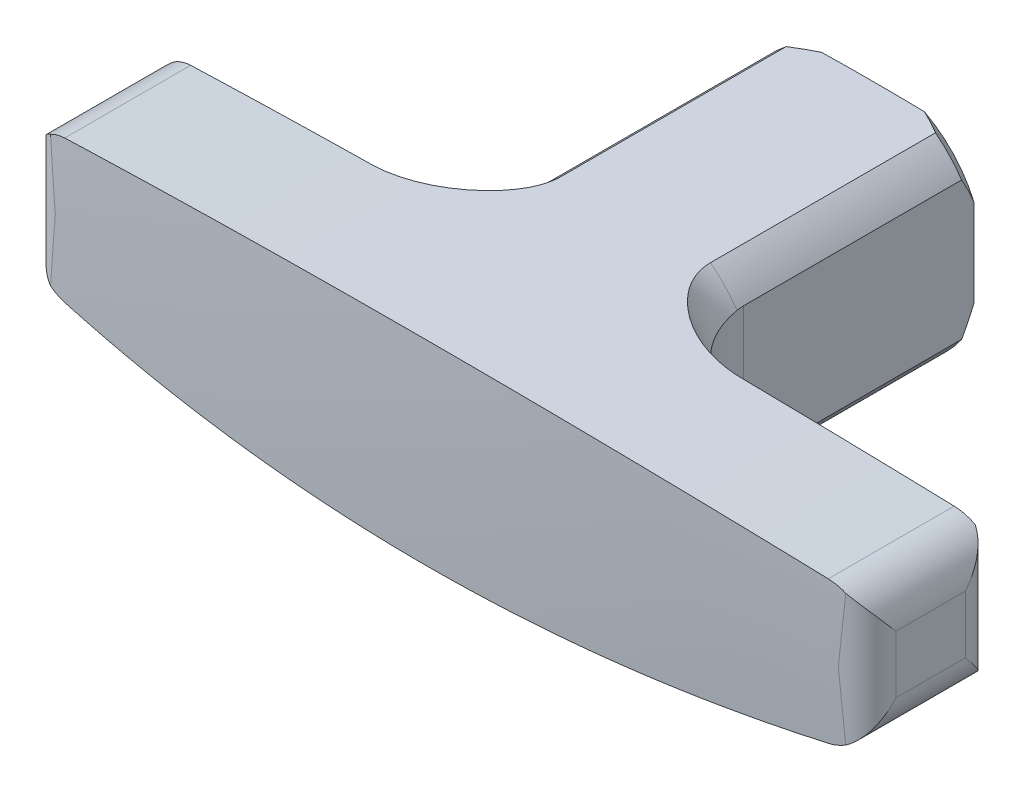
ISO-10303-21;
HEADER;
FILE_DESCRIPTION(('STEP AP214'),'2;1');
FILE_NAME('part.step','',(''),(''),'','','');
FILE_SCHEMA(('AUTOMOTIVE_DESIGN { 1 0 10303 214 1 1 1 1 }'));
ENDSEC;
DATA;
#1=APPLICATION_CONTEXT('core data for automotive mechanical design processes');
#2=APPLICATION_PROTOCOL_DEFINITION('international standard','automotive_design',2000,#1);
#3=PRODUCT_CONTEXT('',#1,'mechanical');
#4=PRODUCT('Part','Part','',(#3));
#5=PRODUCT_RELATED_PRODUCT_CATEGORY('part','',(#4));
#6=PRODUCT_DEFINITION_FORMATION('','',#4);
#7=PRODUCT_DEFINITION_CONTEXT('part definition',#1,'design');
#8=PRODUCT_DEFINITION('design','',#6,#7);
#9=PRODUCT_DEFINITION_SHAPE('','',#8);
#10=(LENGTH_UNIT() NAMED_UNIT(*) SI_UNIT(.MILLI.,.METRE.));
#11=(NAMED_UNIT(*) PLANE_ANGLE_UNIT() SI_UNIT($,.RADIAN.));
#12=(NAMED_UNIT(*) SI_UNIT($,.STERADIAN.) SOLID_ANGLE_UNIT());
#13=UNCERTAINTY_MEASURE_WITH_UNIT(LENGTH_MEASURE(1.E-05),#10,'distance_accuracy_value','');
#14=(GEOMETRIC_REPRESENTATION_CONTEXT(3) GLOBAL_UNCERTAINTY_ASSIGNED_CONTEXT((#13)) GLOBAL_UNIT_ASSIGNED_CONTEXT((#10,
#11,#12)) REPRESENTATION_CONTEXT('',''));
#15=CARTESIAN_POINT('',(0.,0.,0.));
#16=DIRECTION('',(0.,0.,1.));
#17=DIRECTION('',(1.,0.,0.));
#18=AXIS2_PLACEMENT_3D('',#15,#16,#17);
#19=CARTESIAN_POINT('',(0.,0.,19.7046709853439));
#20=DIRECTION('',(0.,0.,-1.));
#21=DIRECTION('',(0.,1.,0.));
#22=AXIS2_PLACEMENT_3D('',#19,#20,#21);
#23=TOROIDAL_SURFACE('',#22,16.5,6.5);
#24=CARTESIAN_POINT('',(0.,0.,26.1929659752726));
#25=DIRECTION('',(0.,0.,-1.));
#26=DIRECTION('',(0.,1.,0.));
#27=AXIS2_PLACEMENT_3D('',#24,#25,#26);
#28=CIRCLE('',#27,16.889907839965);
#29=CARTESIAN_POINT('',(-15.137432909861,-7.49180297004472,26.1929659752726));
#30=VERTEX_POINT('',#29);
#31=CARTESIAN_POINT('',(-15.137432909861,7.49180297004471,26.1929659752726));
#32=VERTEX_POINT('',#31);
#33=EDGE_CURVE('E536',#30,#32,#28,.T.);
#34=ORIENTED_EDGE('',*,*,#33,.T.);
#35=CARTESIAN_POINT('',(-16.8901078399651,7.36713277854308,25.9124953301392));
#36=CARTESIAN_POINT('',(-16.6213487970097,7.38730943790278,25.9864956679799));
#37=CARTESIAN_POINT('',(-16.3487558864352,7.40727466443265,26.0460972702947));
#38=CARTESIAN_POINT('',(-15.799130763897,7.44651308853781,26.137227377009));
#39=CARTESIAN_POINT('',(-15.5221032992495,7.4657869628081,26.168784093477));
#40=CARTESIAN_POINT('',(-14.9684601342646,7.50326785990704,26.2045541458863));
#41=CARTESIAN_POINT('',(-14.6918581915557,7.52148205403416,26.2089796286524));
#42=CARTESIAN_POINT('',(-14.1393563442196,7.55684269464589,26.192081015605));
#43=CARTESIAN_POINT('',(-13.8634565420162,7.57398899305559,26.1707533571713));
#44=CARTESIAN_POINT('',(-13.35207538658,7.60483454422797,26.1080654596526));
#45=CARTESIAN_POINT('',(-13.1162132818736,7.61868499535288,26.0698338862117));
#46=CARTESIAN_POINT('',(-12.648069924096,7.64544904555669,25.9758072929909));
#47=CARTESIAN_POINT('',(-12.4157880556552,7.65836280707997,25.9200153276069));
#48=CARTESIAN_POINT('',(-11.7249159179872,7.6957153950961,25.7271020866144));
#49=CARTESIAN_POINT('',(-11.2730209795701,7.71872220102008,25.5645353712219));
#50=CARTESIAN_POINT('',(-10.5841700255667,7.75183292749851,25.2603666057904));
#51=CARTESIAN_POINT('',(-10.3378045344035,7.76325252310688,25.1394366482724));
#52=CARTESIAN_POINT('',(-9.85543853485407,7.78485195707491,24.8780278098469));
#53=CARTESIAN_POINT('',(-9.61944052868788,7.79503149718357,24.7375442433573));
#54=CARTESIAN_POINT('',(-9.15987349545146,7.81416726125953,24.4377705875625));
#55=CARTESIAN_POINT('',(-8.9362971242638,7.823124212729,24.2784917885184));
#56=CARTESIAN_POINT('',(-8.50362236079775,7.83985277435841,23.9413652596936));
#57=CARTESIAN_POINT('',(-8.29451713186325,7.84762494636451,23.7635263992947));
#58=CARTESIAN_POINT('',(-7.96645871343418,7.85939772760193,23.4570915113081));
#59=CARTESIAN_POINT('',(-7.84231782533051,7.86374377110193,23.3340331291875));
#60=CARTESIAN_POINT('',(-7.60217111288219,7.87196503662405,23.0802234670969));
#61=CARTESIAN_POINT('',(-7.48616335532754,7.87584037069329,22.9494740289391));
#62=CARTESIAN_POINT('',(-7.26370480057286,7.88311320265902,22.6802390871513));
#63=CARTESIAN_POINT('',(-7.1572445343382,7.88651117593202,22.5417614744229));
#64=CARTESIAN_POINT('',(-6.95554834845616,7.89282021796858,22.2569341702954));
#65=CARTESIAN_POINT('',(-6.8603087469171,7.89573144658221,22.110587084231));
#66=CARTESIAN_POINT('',(-6.64393768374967,7.90222604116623,21.7432440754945));
#67=CARTESIAN_POINT('',(-6.52997304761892,7.90553759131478,21.5178486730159));
#68=CARTESIAN_POINT('',(-6.38638101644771,7.90963287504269,21.1689958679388));
#69=CARTESIAN_POINT('',(-6.34311265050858,7.91085166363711,21.0510699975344));
#70=CARTESIAN_POINT('',(-6.26670368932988,7.9129869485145,20.8119991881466));
#71=CARTESIAN_POINT('',(-6.23355894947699,7.91390356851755,20.6908555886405));
#72=CARTESIAN_POINT('',(-6.17416278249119,7.91553747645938,20.4270430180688));
#73=CARTESIAN_POINT('',(-6.14977064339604,7.91620200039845,20.2839429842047));
#74=CARTESIAN_POINT('',(-6.12520426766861,7.91686978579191,20.0677123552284));
#75=CARTESIAN_POINT('',(-6.11901886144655,7.91703755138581,19.9952242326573));
#76=CARTESIAN_POINT('',(-6.11075586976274,7.91726146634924,19.8499867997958));
#77=CARTESIAN_POINT('',(-6.1086798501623,7.9173175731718,19.7772374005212));
#78=CARTESIAN_POINT('',(-6.10868931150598,7.91731740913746,19.7044709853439));
#79=B_SPLINE_CURVE_WITH_KNOTS('',3,(#35,#36,#37,#38,#39,#40,#41,#42,#43,#44,#45,#46,#47,#48,#49,
#50,#51,#52,#53,#54,#55,#56,#57,#58,#59,#60,#61,#62,#63,#64,#65,#66,#67,#68,#69,#70,#71,#72,#73,
#74,#75,#76,#77,#78),.UNSPECIFIED.,.F.,.F.,(4,2,2,2,2,2,2,2,2,2,2,2,2,2,2,2,2,2,2,2,2,4),(0.,
0.837873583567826,1.67490334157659,2.50537969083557,3.3359709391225,4.05328813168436,
4.7704806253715,6.20703217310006,7.0303788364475,7.85392313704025,8.6769752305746,
9.49963579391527,10.0238855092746,10.5480101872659,11.0716091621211,11.5950358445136,
12.349858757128,12.7263448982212,13.1026766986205,13.5372197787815,13.7553731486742,
13.9736096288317),.UNSPECIFIED.);
#80=CARTESIAN_POINT('',(-6.10868930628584,7.91731740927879,19.7046709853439));
#81=VERTEX_POINT('',#80);
#82=EDGE_CURVE('E699',#32,#81,#79,.T.);
#83=ORIENTED_EDGE('',*,*,#82,.T.);
#84=CARTESIAN_POINT('',(0.,0.,19.7046709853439));
#85=DIRECTION('',(0.,0.,-1.));
#86=DIRECTION('',(0.,1.,0.));
#87=AXIS2_PLACEMENT_3D('',#84,#85,#86);
#88=CIRCLE('',#87,10.);
#89=CARTESIAN_POINT('',(-8.27266207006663,5.6181013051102,19.7046709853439));
#90=VERTEX_POINT('',#89);
#91=EDGE_CURVE('E543',#90,#81,#88,.T.);
#92=ORIENTED_EDGE('',*,*,#91,.F.);
#93=CARTESIAN_POINT('',(-8.27264532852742,-5.61812596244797,19.7044709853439));
#94=CARTESIAN_POINT('',(-8.28777430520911,-5.59577421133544,19.8855708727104));
#95=CARTESIAN_POINT('',(-8.3105724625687,-5.5755326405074,20.0662748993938));
#96=CARTESIAN_POINT('',(-8.37130888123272,-5.53852986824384,20.4254469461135));
#97=CARTESIAN_POINT('',(-8.40924417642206,-5.52176798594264,20.6039153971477));
#98=CARTESIAN_POINT('',(-8.50002810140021,-5.49098815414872,20.9571094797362));
#99=CARTESIAN_POINT('',(-8.55286534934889,-5.47696812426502,21.1318378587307));
#100=CARTESIAN_POINT('',(-8.67309517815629,-5.45071718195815,21.4763479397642));
#101=CARTESIAN_POINT('',(-8.74048771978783,-5.43848626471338,21.6461296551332));
#102=CARTESIAN_POINT('',(-8.88936342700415,-5.41468677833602,21.9795072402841));
#103=CARTESIAN_POINT('',(-8.97085087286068,-5.40311841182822,22.1431012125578));
#104=CARTESIAN_POINT('',(-9.14728684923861,-5.37927581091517,22.4628124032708));
#105=CARTESIAN_POINT('',(-9.2422354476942,-5.36700157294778,22.6189295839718));
#106=CARTESIAN_POINT('',(-9.44479497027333,-5.34005477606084,22.922430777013));
#107=CARTESIAN_POINT('',(-9.5524017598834,-5.32538299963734,23.0698176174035));
#108=CARTESIAN_POINT('',(-9.77933120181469,-5.29150894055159,23.3546912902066));
#109=CARTESIAN_POINT('',(-9.89864999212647,-5.27230814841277,23.4921813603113));
#110=CARTESIAN_POINT('',(-10.1118423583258,-5.23320427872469,23.7180446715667));
#111=CARTESIAN_POINT('',(-10.2031510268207,-5.21509505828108,23.8091621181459));
#112=CARTESIAN_POINT('',(-10.3904194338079,-5.17394698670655,23.9852879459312));
#113=CARTESIAN_POINT('',(-10.4863780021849,-5.15090937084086,24.0702978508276));
#114=CARTESIAN_POINT('',(-10.6819708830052,-5.09849476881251,24.233594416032));
#115=CARTESIAN_POINT('',(-10.7815993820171,-5.06912747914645,24.3118911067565));
#116=CARTESIAN_POINT('',(-10.9834979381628,-5.00238044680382,24.4613495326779));
#117=CARTESIAN_POINT('',(-11.0857670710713,-4.96500347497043,24.532513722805));
#118=CARTESIAN_POINT('',(-11.2639681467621,-4.89174187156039,24.6492356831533));
#119=CARTESIAN_POINT('',(-11.3396651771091,-4.85810783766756,24.6965675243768));
#120=CARTESIAN_POINT('',(-11.4907858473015,-4.78494313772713,24.7868907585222));
#121=CARTESIAN_POINT('',(-11.5662095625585,-4.74541424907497,24.8298834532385));
#122=CARTESIAN_POINT('',(-11.7157242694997,-4.65998986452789,24.9113151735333));
#123=CARTESIAN_POINT('',(-11.7898173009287,-4.61410525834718,24.949761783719));
#124=CARTESIAN_POINT('',(-11.9357345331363,-4.51568207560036,25.0221074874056));
#125=CARTESIAN_POINT('',(-12.0075587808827,-4.46314363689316,25.0560066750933));
#126=CARTESIAN_POINT('',(-12.2187321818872,-4.29482039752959,25.1512334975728));
#127=CARTESIAN_POINT('',(-12.3531858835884,-4.16865603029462,25.2057745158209));
#128=CARTESIAN_POINT('',(-12.5398114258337,-3.96208874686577,25.2754310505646));
#129=CARTESIAN_POINT('',(-12.5995766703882,-3.89024450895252,25.2966431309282));
#130=CARTESIAN_POINT('',(-12.7138300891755,-3.74156550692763,25.3355052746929));
#131=CARTESIAN_POINT('',(-12.7683191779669,-3.66473161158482,25.3531559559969));
#132=CARTESIAN_POINT('',(-12.887084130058,-3.48372825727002,25.3900864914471));
#133=CARTESIAN_POINT('',(-12.9495386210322,-3.37815443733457,25.4083240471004));
#134=CARTESIAN_POINT('',(-13.0656838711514,-3.16169384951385,25.4406399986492));
#135=CARTESIAN_POINT('',(-13.1193714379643,-3.0508051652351,25.4547168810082));
#136=CARTESIAN_POINT('',(-13.2186552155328,-2.82488128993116,25.4796141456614));
#137=CARTESIAN_POINT('',(-13.2642355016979,-2.70983846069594,25.4904281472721));
#138=CARTESIAN_POINT('',(-13.3478715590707,-2.47682563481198,25.5094818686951));
#139=CARTESIAN_POINT('',(-13.3859243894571,-2.3588545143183,25.5177205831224));
#140=CARTESIAN_POINT('',(-13.4789175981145,-2.03909449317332,25.5371582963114));
#141=CARTESIAN_POINT('',(-13.5275267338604,-1.83534231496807,25.5465089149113));
#142=CARTESIAN_POINT('',(-13.6077344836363,-1.42434994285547,25.5613398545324));
#143=CARTESIAN_POINT('',(-13.6393209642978,-1.21710736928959,25.5668174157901));
#144=CARTESIAN_POINT('',(-13.687162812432,-0.800070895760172,25.5749302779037));
#145=CARTESIAN_POINT('',(-13.7033625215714,-0.590270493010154,25.577555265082));
#146=CARTESIAN_POINT('',(-13.7210564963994,-0.170036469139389,25.5804159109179));
#147=CARTESIAN_POINT('',(-13.722549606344,0.0403972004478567,25.5806513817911));
#148=CARTESIAN_POINT('',(-13.7105278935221,0.474585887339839,25.5787172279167));
#149=CARTESIAN_POINT('',(-13.6960275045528,0.698314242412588,25.5763896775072));
#150=CARTESIAN_POINT('',(-13.6495816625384,1.1440884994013,25.5685866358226));
#151=CARTESIAN_POINT('',(-13.6176245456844,1.36613317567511,25.5631090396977));
#152=CARTESIAN_POINT('',(-13.5345924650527,1.80527823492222,25.5478647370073));
#153=CARTESIAN_POINT('',(-13.4836253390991,2.02239931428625,25.538122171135));
#154=CARTESIAN_POINT('',(-13.359661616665,2.44965780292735,25.5122508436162));
#155=CARTESIAN_POINT('',(-13.2867017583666,2.65980621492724,25.4961327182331));
#156=CARTESIAN_POINT('',(-13.1235331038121,3.04751048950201,25.4560889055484));
#157=CARTESIAN_POINT('',(-13.0358653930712,3.22619708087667,25.4331350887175));
#158=CARTESIAN_POINT('',(-12.8870429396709,3.48244967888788,25.3898871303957));
#159=CARTESIAN_POINT('',(-12.8345886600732,3.56585354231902,25.3740148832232));
#160=CARTESIAN_POINT('',(-12.7238127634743,3.72792673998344,25.3387703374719));
#161=CARTESIAN_POINT('',(-12.6654912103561,3.80659612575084,25.3193980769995));
#162=CARTESIAN_POINT('',(-12.5424891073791,3.95909658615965,25.2763823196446));
#163=CARTESIAN_POINT('',(-12.4777444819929,4.03286338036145,25.2526932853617));
#164=CARTESIAN_POINT('',(-12.3430204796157,4.173688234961,25.2007163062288));
#165=CARTESIAN_POINT('',(-12.2730417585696,4.2407471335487,25.1724289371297));
#166=CARTESIAN_POINT('',(-12.1287363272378,4.36755297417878,25.1109063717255));
#167=CARTESIAN_POINT('',(-12.0544087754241,4.42729849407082,25.0776702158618));
#168=CARTESIAN_POINT('',(-11.9026033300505,4.53922171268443,25.0061154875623));
#169=CARTESIAN_POINT('',(-11.8251253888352,4.59139929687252,24.9677968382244));
#170=CARTESIAN_POINT('',(-11.6078811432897,4.72564784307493,24.8545939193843));
#171=CARTESIAN_POINT('',(-11.4660356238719,4.79984827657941,24.7742520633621));
#172=CARTESIAN_POINT('',(-11.1826963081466,4.92834598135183,24.5985648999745));
#173=CARTESIAN_POINT('',(-11.0412031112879,4.98262004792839,24.5032022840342));
#174=CARTESIAN_POINT('',(-10.7853006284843,5.06839533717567,24.3152537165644));
#175=CARTESIAN_POINT('',(-10.6701658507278,5.10214649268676,24.2246429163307));
#176=CARTESIAN_POINT('',(-10.4450499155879,5.16136413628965,24.0346471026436));
#177=CARTESIAN_POINT('',(-10.3350717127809,5.18682592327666,23.9352571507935));
#178=CARTESIAN_POINT('',(-10.1214003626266,5.23165302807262,23.7283532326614));
#179=CARTESIAN_POINT('',(-10.0177176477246,5.25100843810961,23.6208264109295));
#180=CARTESIAN_POINT('',(-9.81769214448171,5.28536023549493,23.398486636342));
#181=CARTESIAN_POINT('',(-9.72135040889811,5.30035599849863,23.2836726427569));
#182=CARTESIAN_POINT('',(-9.53303349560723,5.32797620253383,23.0427733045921));
#183=CARTESIAN_POINT('',(-9.44138191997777,5.34048334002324,22.9164217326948));
#184=CARTESIAN_POINT('',(-9.26733844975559,5.36368450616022,22.6573322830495));
#185=CARTESIAN_POINT('',(-9.18494706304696,5.37437843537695,22.5245940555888));
#186=CARTESIAN_POINT('',(-9.02998881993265,5.39503058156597,22.2536145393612));
#187=CARTESIAN_POINT('',(-8.95741279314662,5.40498948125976,22.115378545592));
#188=CARTESIAN_POINT('',(-8.82240157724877,5.42508457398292,21.8340558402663));
#189=CARTESIAN_POINT('',(-8.7599662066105,5.43522076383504,21.6909692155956));
#190=CARTESIAN_POINT('',(-8.64472129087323,5.45658822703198,21.3985759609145));
#191=CARTESIAN_POINT('',(-8.59206856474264,5.46783353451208,21.2492084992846));
#192=CARTESIAN_POINT('',(-8.49783348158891,5.4919613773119,20.9471495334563));
#193=CARTESIAN_POINT('',(-8.45625111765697,5.50484391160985,20.7944580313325));
#194=CARTESIAN_POINT('',(-8.38430579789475,5.5328462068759,20.486372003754));
#195=CARTESIAN_POINT('',(-8.35396243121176,5.54796981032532,20.3309732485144));
#196=CARTESIAN_POINT('',(-8.30470307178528,5.58091027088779,20.0186386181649));
#197=CARTESIAN_POINT('',(-8.28578849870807,5.59872746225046,19.8617025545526));
#198=CARTESIAN_POINT('',(-8.27264532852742,5.61812596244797,19.7044709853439));
#199=B_SPLINE_CURVE_WITH_KNOTS('',3,(#93,#94,#95,#96,#97,#98,#99,#100,#101,#102,#103,#104,#105,
#106,#107,#108,#109,#110,#111,#112,#113,#114,#115,#116,#117,#118,#119,#120,#121,#122,#123,#124,
#125,#126,#127,#128,#129,#130,#131,#132,#133,#134,#135,#136,#137,#138,#139,#140,#141,#142,#143,
#144,#145,#146,#147,#148,#149,#150,#151,#152,#153,#154,#155,#156,#157,#158,#159,#160,#161,#162,
#163,#164,#165,#166,#167,#168,#169,#170,#171,#172,#173,#174,#175,#176,#177,#178,#179,#180,#181,
#182,#183,#184,#185,#186,#187,#188,#189,#190,#191,#192,#193,#194,#195,#196,#197,#198),
.UNSPECIFIED.,.F.,.F.,(4,2,2,2,2,2,2,2,2,2,2,2,2,2,2,2,2,2,2,2,2,2,2,2,2,2,2,2,2,2,2,2,2,2,2,2,
2,2,2,2,2,2,2,2,2,2,2,2,2,2,2,2,4),(0.,0.54910796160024,1.09810837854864,1.64669060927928,
2.195271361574,2.74401899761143,3.29276940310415,3.84134106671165,4.38973244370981,
4.78023334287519,5.17063648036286,5.5604457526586,5.95012039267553,6.23607983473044,
6.5219532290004,6.80734273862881,7.09272633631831,7.66571204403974,7.95293101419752,
8.24010010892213,8.61155304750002,8.98314094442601,9.35545085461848,9.72790593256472,
10.3559557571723,10.984452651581,11.6152144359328,12.2460257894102,12.9179951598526,
13.5904140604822,14.2590751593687,14.9266254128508,15.5256163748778,15.8247202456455,
16.1238208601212,16.4262815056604,16.7287043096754,17.0311858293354,17.333671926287,
17.8687863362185,18.4045219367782,18.8549632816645,19.3056596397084,19.7570835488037,
20.2085720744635,20.6779247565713,21.1473031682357,21.6162399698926,22.0851683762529,
22.5610647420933,23.0369608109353,23.5136824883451,23.9904633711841),.UNSPECIFIED.);
#200=CARTESIAN_POINT('',(-8.27266207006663,-5.6181013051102,19.7046709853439));
#201=VERTEX_POINT('',#200);
#202=EDGE_CURVE('E1020',#201,#90,#199,.T.);
#203=ORIENTED_EDGE('',*,*,#202,.F.);
#204=CARTESIAN_POINT('',(-6.10868930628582,-7.91731740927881,19.7046709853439));
#205=VERTEX_POINT('',#204);
#206=EDGE_CURVE('E799',#205,#201,#88,.T.);
#207=ORIENTED_EDGE('',*,*,#206,.F.);
#208=CARTESIAN_POINT('',(-6.10868931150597,-7.91731740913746,19.7044709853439));
#209=CARTESIAN_POINT('',(-6.10862000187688,-7.91731849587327,19.8229001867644));
#210=CARTESIAN_POINT('',(-6.11416591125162,-7.91716911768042,19.9412942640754));
#211=CARTESIAN_POINT('',(-6.13599864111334,-7.91657681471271,20.1769273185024));
#212=CARTESIAN_POINT('',(-6.15227054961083,-7.91613429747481,20.2941676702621));
#213=CARTESIAN_POINT('',(-6.1948071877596,-7.91497020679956,20.5253236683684));
#214=CARTESIAN_POINT('',(-6.22094760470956,-7.91425210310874,20.6392624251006));
#215=CARTESIAN_POINT('',(-6.2824588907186,-7.91254766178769,20.864643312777));
#216=CARTESIAN_POINT('',(-6.31783355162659,-7.91156121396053,20.9760843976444));
#217=CARTESIAN_POINT('',(-6.40905433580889,-7.9089906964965,21.2296244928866));
#218=CARTESIAN_POINT('',(-6.46785219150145,-7.90731612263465,21.3706637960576));
#219=CARTESIAN_POINT('',(-6.59769781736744,-7.90355631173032,21.6469323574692));
#220=CARTESIAN_POINT('',(-6.66874913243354,-7.90147095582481,21.7821599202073));
#221=CARTESIAN_POINT('',(-6.89837800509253,-7.89460485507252,22.1802532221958));
#222=CARTESIAN_POINT('',(-7.07285678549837,-7.88922960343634,22.4340337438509));
#223=CARTESIAN_POINT('',(-7.40780674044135,-7.87844683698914,22.8602594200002));
#224=CARTESIAN_POINT('',(-7.56198916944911,-7.87334167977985,23.0378339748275));
#225=CARTESIAN_POINT('',(-7.88510541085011,-7.86227791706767,23.3791758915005));
#226=CARTESIAN_POINT('',(-8.05404677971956,-7.85631887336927,23.5429360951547));
#227=CARTESIAN_POINT('',(-8.40409450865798,-7.84354765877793,23.8566832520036));
#228=CARTESIAN_POINT('',(-8.58519815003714,-7.83673567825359,24.0066732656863));
#229=CARTESIAN_POINT('',(-8.95782469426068,-7.82224311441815,24.292956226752));
#230=CARTESIAN_POINT('',(-9.14934590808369,-7.81456267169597,24.4292513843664));
#231=CARTESIAN_POINT('',(-9.54971505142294,-7.79797062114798,24.6934425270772));
#232=CARTESIAN_POINT('',(-9.75895288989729,-7.78902083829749,24.8207448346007));
#233=CARTESIAN_POINT('',(-10.186022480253,-7.77013247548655,25.0599339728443));
#234=CARTESIAN_POINT('',(-10.4038545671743,-7.7601938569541,25.1718202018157));
#235=CARTESIAN_POINT('',(-10.8469974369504,-7.73930857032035,25.3796262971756));
#236=CARTESIAN_POINT('',(-11.0723091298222,-7.7283617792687,25.4755442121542));
#237=CARTESIAN_POINT('',(-11.5293800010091,-7.70544756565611,25.6507528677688));
#238=CARTESIAN_POINT('',(-11.7611422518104,-7.69347965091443,25.7300355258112));
#239=CARTESIAN_POINT('',(-12.2682814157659,-7.66648780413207,25.8827072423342));
#240=CARTESIAN_POINT('',(-12.544587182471,-7.65128431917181,25.9530067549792));
#241=CARTESIAN_POINT('',(-13.1021797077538,-7.61955270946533,26.068646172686));
#242=CARTESIAN_POINT('',(-13.3834640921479,-7.60302520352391,26.1139976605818));
#243=CARTESIAN_POINT('',(-13.9485360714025,-7.56874684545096,26.1784438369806));
#244=CARTESIAN_POINT('',(-14.232319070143,-7.55099794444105,26.197579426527));
#245=CARTESIAN_POINT('',(-14.8002046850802,-7.51439757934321,26.2084965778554));
#246=CARTESIAN_POINT('',(-15.0843069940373,-7.49554680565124,26.200295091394));
#247=CARTESIAN_POINT('',(-15.6245651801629,-7.4586758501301,26.1575262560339));
#248=CARTESIAN_POINT('',(-15.8809197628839,-7.44073528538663,26.1254164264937));
#249=CARTESIAN_POINT('',(-16.389312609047,-7.40430033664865,26.0371388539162));
#250=CARTESIAN_POINT('',(-16.6413522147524,-7.38580612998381,25.9809787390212));
#251=CARTESIAN_POINT('',(-16.8901078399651,-7.3671327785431,25.9124953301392));
#252=B_SPLINE_CURVE_WITH_KNOTS('',3,(#208,#209,#210,#211,#212,#213,#214,#215,#216,#217,#218,
#219,#220,#221,#222,#223,#224,#225,#226,#227,#228,#229,#230,#231,#232,#233,#234,#235,#236,#237,
#238,#239,#240,#241,#242,#243,#244,#245,#246,#247,#248,#249,#250,#251),.UNSPECIFIED.,.F.,.F.,(4,
2,2,2,2,2,2,2,2,2,2,2,2,2,2,2,2,2,2,2,2,4),(0.,0.355100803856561,0.709708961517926,
1.05999163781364,1.41041837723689,1.86813293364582,2.3259801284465,3.24642326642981,
3.95130910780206,4.65655798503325,5.36164973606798,6.0666275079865,6.80123166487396,
7.53586448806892,8.27058702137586,9.00566571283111,9.86108074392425,10.7160982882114,
11.5697803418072,12.4229331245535,13.1987458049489,13.9743125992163),.UNSPECIFIED.);
#253=EDGE_CURVE('E295',#205,#30,#252,.T.);
#254=ORIENTED_EDGE('',*,*,#253,.T.);
#255=EDGE_LOOP('',(#34,#83,#92,#203,#207,#254));
#256=FACE_BOUND('',#255,.T.);
#257=ADVANCED_FACE('F14',(#256),#23,.F.);
#258=CARTESIAN_POINT('',(0.,0.,0.));
#259=DIRECTION('',(0.,0.,-1.));
#260=DIRECTION('',(0.,1.,0.));
#261=AXIS2_PLACEMENT_3D('',#258,#259,#260);
#262=CYLINDRICAL_SURFACE('',#261,10.);
#263=ORIENTED_EDGE('',*,*,#91,.T.);
#264=DIRECTION('',(0.,0.,-1.));
#265=VECTOR('',#264,1.);
#266=CARTESIAN_POINT('',(-6.10868930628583,7.91731740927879,0.));
#267=LINE('',#266,#265);
#268=CARTESIAN_POINT('',(-6.10868930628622,7.91731740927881,1.30000000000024));
#269=VERTEX_POINT('',#268);
#270=EDGE_CURVE('E716',#81,#269,#267,.T.);
#271=ORIENTED_EDGE('',*,*,#270,.T.);
#272=CARTESIAN_POINT('',(0.,0.,1.3));
#273=DIRECTION('',(0.,0.,-1.));
#274=DIRECTION('',(0.,1.,0.));
#275=AXIS2_PLACEMENT_3D('',#272,#273,#274);
#276=CIRCLE('',#275,10.);
#277=CARTESIAN_POINT('',(-8.25,5.65132727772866,1.3));
#278=VERTEX_POINT('',#277);
#279=EDGE_CURVE('E733',#278,#269,#276,.T.);
#280=ORIENTED_EDGE('',*,*,#279,.F.);
#281=DIRECTION('',(0.,0.,-1.));
#282=VECTOR('',#281,1.);
#283=CARTESIAN_POINT('',(-8.25,5.65132727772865,0.));
#284=LINE('',#283,#282);
#285=CARTESIAN_POINT('',(-8.25,5.65132727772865,19.1623673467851));
#286=VERTEX_POINT('',#285);
#287=EDGE_CURVE('E766',#278,#286,#284,.F.);
#288=ORIENTED_EDGE('',*,*,#287,.T.);
#289=CARTESIAN_POINT('',(-8.27266207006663,5.6181013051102,19.7046709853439));
#290=CARTESIAN_POINT('',(-8.26512384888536,5.62917142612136,19.6147831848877));
#291=CARTESIAN_POINT('',(-8.25946623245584,5.63747531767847,19.5246473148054));
#292=CARTESIAN_POINT('',(-8.25191220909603,5.6485506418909,19.3438794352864));
#293=CARTESIAN_POINT('',(-8.25001580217,5.65132207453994,19.2532474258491));
#294=CARTESIAN_POINT('',(-8.25,5.65132727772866,19.1623673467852));
#295=B_SPLINE_CURVE_WITH_KNOTS('',3,(#289,#290,#291,#292,#293,#294),.UNSPECIFIED.,.F.,.F.,(4,2,
4),(0.,0.272082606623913,0.544165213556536),.UNSPECIFIED.);
#296=EDGE_CURVE('E555',#90,#286,#295,.T.);
#297=ORIENTED_EDGE('',*,*,#296,.F.);
#298=EDGE_LOOP('',(#263,#271,#280,#288,#297));
#299=FACE_BOUND('',#298,.T.);
#300=ADVANCED_FACE('F507',(#299),#262,.T.);
#301=CARTESIAN_POINT('',(8.27266207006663,-5.6181013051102,19.7046709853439));
#302=VERTEX_POINT('',#301);
#303=CARTESIAN_POINT('',(6.10868930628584,-7.91731740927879,19.7046709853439));
#304=VERTEX_POINT('',#303);
#305=EDGE_CURVE('E541',#302,#304,#88,.T.);
#306=ORIENTED_EDGE('',*,*,#305,.T.);
#307=DIRECTION('',(0.,0.,-1.));
#308=VECTOR('',#307,1.);
#309=CARTESIAN_POINT('',(6.10868930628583,-7.91731740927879,0.));
#310=LINE('',#309,#308);
#311=CARTESIAN_POINT('',(6.10868930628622,-7.91731740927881,1.30000000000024));
#312=VERTEX_POINT('',#311);
#313=EDGE_CURVE('E794',#304,#312,#310,.T.);
#314=ORIENTED_EDGE('',*,*,#313,.T.);
#315=CARTESIAN_POINT('',(8.25,-5.65132727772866,1.3));
#316=VERTEX_POINT('',#315);
#317=EDGE_CURVE('E748',#316,#312,#276,.T.);
#318=ORIENTED_EDGE('',*,*,#317,.F.);
#319=DIRECTION('',(0.,0.,-1.));
#320=VECTOR('',#319,1.);
#321=CARTESIAN_POINT('',(8.25,-5.65132727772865,0.));
#322=LINE('',#321,#320);
#323=CARTESIAN_POINT('',(8.25,-5.65132727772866,19.1623672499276));
#324=VERTEX_POINT('',#323);
#325=EDGE_CURVE('E489',#316,#324,#322,.F.);
#326=ORIENTED_EDGE('',*,*,#325,.T.);
#327=CARTESIAN_POINT('',(8.27266207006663,-5.6181013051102,19.7046709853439));
#328=CARTESIAN_POINT('',(8.26512384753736,-5.62917142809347,19.6147831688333));
#329=CARTESIAN_POINT('',(8.25946623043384,-5.63747532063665,19.5246472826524));
#330=CARTESIAN_POINT('',(8.25191220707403,-5.64855064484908,19.3438793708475));
#331=CARTESIAN_POINT('',(8.250015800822,-5.65132207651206,19.253247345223));
#332=CARTESIAN_POINT('',(8.25,-5.65132727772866,19.1623672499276));
#333=B_SPLINE_CURVE_WITH_KNOTS('',3,(#327,#328,#329,#330,#331,#332),.UNSPECIFIED.,.F.,.F.,(4,2,
4),(0.,0.27208265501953,0.544165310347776),.UNSPECIFIED.);
#334=EDGE_CURVE('E561',#302,#324,#333,.T.);
#335=ORIENTED_EDGE('',*,*,#334,.F.);
#336=EDGE_LOOP('',(#306,#314,#318,#326,#335));
#337=FACE_BOUND('',#336,.T.);
#338=ADVANCED_FACE('F512',(#337),#262,.T.);
#339=CARTESIAN_POINT('',(0.,0.,1.3));
#340=DIRECTION('',(0.,0.,1.));
#341=DIRECTION('',(0.,-1.,0.));
#342=AXIS2_PLACEMENT_3D('',#339,#340,#341);
#343=CONICAL_SURFACE('',#342,10.,0.785398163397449);
#344=ORIENTED_EDGE('',*,*,#317,.T.);
#345=CARTESIAN_POINT('',(6.10902860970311,-7.91730822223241,1.3002));
#346=CARTESIAN_POINT('',(5.95403327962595,-7.92150475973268,1.20885024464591));
#347=CARTESIAN_POINT('',(5.79806114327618,-7.92556843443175,1.11912683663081));
#348=CARTESIAN_POINT('',(5.48411472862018,-7.93341763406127,0.943527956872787));
#349=CARTESIAN_POINT('',(5.32614203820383,-7.93720336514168,0.857649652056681));
#350=CARTESIAN_POINT('',(5.00789378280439,-7.94449103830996,0.690186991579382));
#351=CARTESIAN_POINT('',(4.84761792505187,-7.94799294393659,0.608603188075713));
#352=CARTESIAN_POINT('',(4.52451173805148,-7.95470279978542,0.45033899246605));
#353=CARTESIAN_POINT('',(4.36167958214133,-7.95791052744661,0.373662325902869));
#354=CARTESIAN_POINT('',(4.19755367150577,-7.96096371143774,0.299800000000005));
#355=B_SPLINE_CURVE_WITH_KNOTS('',3,(#345,#346,#347,#348,#349,#350,#351,#352,#353,#354),
.UNSPECIFIED.,.F.,.F.,(4,2,2,2,4),(0.,0.539890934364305,1.07937730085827,1.61893286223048,
2.15889331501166),.UNSPECIFIED.);
#356=CARTESIAN_POINT('',(4.19799814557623,-7.96095544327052,0.3));
#357=VERTEX_POINT('',#356);
#358=EDGE_CURVE('E278',#312,#357,#355,.T.);
#359=ORIENTED_EDGE('',*,*,#358,.T.);
#360=CARTESIAN_POINT('',(0.,0.,0.3));
#361=DIRECTION('',(0.,0.,-1.));
#362=DIRECTION('',(0.,1.,0.));
#363=AXIS2_PLACEMENT_3D('',#360,#361,#362);
#364=CIRCLE('',#363,9.);
#365=CARTESIAN_POINT('',(8.25,-3.59687364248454,0.3));
#366=VERTEX_POINT('',#365);
#367=EDGE_CURVE('E741',#366,#357,#364,.T.);
#368=ORIENTED_EDGE('',*,*,#367,.F.);
#369=CARTESIAN_POINT('',(8.25,20.4109313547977,13.3151906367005));
#370=CARTESIAN_POINT('',(8.25,20.103517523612,13.0301860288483));
#371=CARTESIAN_POINT('',(8.25,19.7956600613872,12.7456590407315));
#372=CARTESIAN_POINT('',(8.25,19.1789201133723,12.1777139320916));
#373=CARTESIAN_POINT('',(8.25,18.870037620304,11.8942958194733));
#374=CARTESIAN_POINT('',(8.25,18.2510466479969,11.3286644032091));
#375=CARTESIAN_POINT('',(8.25,17.9409379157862,11.046451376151));
#376=CARTESIAN_POINT('',(8.25,17.3193909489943,10.4834958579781));
#377=CARTESIAN_POINT('',(8.25,17.0079527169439,10.2027533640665));
#378=CARTESIAN_POINT('',(8.25,16.0676057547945,9.35969336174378));
#379=CARTESIAN_POINT('',(8.25,15.4363796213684,8.79994739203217));
#380=CARTESIAN_POINT('',(8.25,14.4833336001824,7.96750585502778));
#381=CARTESIAN_POINT('',(8.25,14.1646341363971,7.69123599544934));
#382=CARTESIAN_POINT('',(8.25,13.5247723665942,7.14156147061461));
#383=CARTESIAN_POINT('',(8.25,13.2036100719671,6.86815679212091));
#384=CARTESIAN_POINT('',(8.25,12.623365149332,6.37954142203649));
#385=CARTESIAN_POINT('',(8.25,12.3648108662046,6.16370354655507));
#386=CARTESIAN_POINT('',(8.25,11.8455582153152,5.73462355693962));
#387=CARTESIAN_POINT('',(8.25,11.5848598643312,5.52138142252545));
#388=CARTESIAN_POINT('',(8.25,11.0609090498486,5.09791281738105));
#389=CARTESIAN_POINT('',(8.25,10.7976559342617,4.88768715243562));
#390=CARTESIAN_POINT('',(8.25,10.2682546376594,4.47091124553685));
#391=CARTESIAN_POINT('',(8.25,10.0021064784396,4.26436097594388));
#392=CARTESIAN_POINT('',(8.25,9.46673587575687,3.85594118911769));
#393=CARTESIAN_POINT('',(8.25,9.19751746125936,3.65406640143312));
#394=CARTESIAN_POINT('',(8.25,8.65508819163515,3.25571616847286));
#395=CARTESIAN_POINT('',(8.25,8.38187717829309,3.05924093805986));
#396=CARTESIAN_POINT('',(8.25,7.83087228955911,2.67305780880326));
#397=CARTESIAN_POINT('',(8.25,7.55308042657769,2.48334704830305));
#398=CARTESIAN_POINT('',(8.25,6.99197571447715,2.11230384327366));
#399=CARTESIAN_POINT('',(8.25,6.70866349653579,1.93097044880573));
#400=CARTESIAN_POINT('',(8.25,6.14544520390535,1.58500548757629));
#401=CARTESIAN_POINT('',(8.25,5.86576221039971,1.42001267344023));
#402=CARTESIAN_POINT('',(8.25,5.29928426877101,1.10254396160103));
#403=CARTESIAN_POINT('',(8.25,5.01248853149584,0.950069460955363));
#404=CARTESIAN_POINT('',(8.25,4.43102359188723,0.661240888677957));
#405=CARTESIAN_POINT('',(8.25,4.13635897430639,0.524877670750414));
#406=CARTESIAN_POINT('',(8.25,3.53832691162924,0.272671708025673));
#407=CARTESIAN_POINT('',(8.25,3.23496191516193,0.156823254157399));
#408=CARTESIAN_POINT('',(8.25,2.68670117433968,-0.0265049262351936));
#409=CARTESIAN_POINT('',(8.25,2.44349986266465,-0.0990227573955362));
#410=CARTESIAN_POINT('',(8.25,1.95227460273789,-0.225473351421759));
#411=CARTESIAN_POINT('',(8.25,1.70425125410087,-0.279408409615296));
#412=CARTESIAN_POINT('',(8.25,1.20531697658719,-0.366022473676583));
#413=CARTESIAN_POINT('',(8.25,0.954418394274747,-0.398771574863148));
#414=CARTESIAN_POINT('',(8.25,0.450672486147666,-0.441509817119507));
#415=CARTESIAN_POINT('',(8.25,0.197825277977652,-0.451500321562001));
#416=CARTESIAN_POINT('',(8.25,-0.308454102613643,-0.448128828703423));
#417=CARTESIAN_POINT('',(8.25,-0.561885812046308,-0.434698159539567));
#418=CARTESIAN_POINT('',(8.25,-1.06650274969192,-0.385143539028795));
#419=CARTESIAN_POINT('',(8.25,-1.31768780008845,-0.349017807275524));
#420=CARTESIAN_POINT('',(8.25,-1.81691026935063,-0.255872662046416));
#421=CARTESIAN_POINT('',(8.25,-2.06493536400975,-0.198788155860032));
#422=CARTESIAN_POINT('',(8.25,-2.55600777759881,-0.0663609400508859));
#423=CARTESIAN_POINT('',(8.25,-2.79905485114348,0.00898266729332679));
#424=CARTESIAN_POINT('',(8.25,-3.30534183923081,0.184001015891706));
#425=CARTESIAN_POINT('',(8.25,-3.56797627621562,0.285412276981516));
#426=CARTESIAN_POINT('',(8.25,-4.08677437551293,0.503738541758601));
#427=CARTESIAN_POINT('',(8.25,-4.34293526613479,0.620660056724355));
#428=CARTESIAN_POINT('',(8.25,-4.84954207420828,0.867210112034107));
#429=CARTESIAN_POINT('',(8.25,-5.09997788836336,0.996859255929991));
#430=CARTESIAN_POINT('',(8.25,-5.59527656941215,1.26626531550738));
#431=CARTESIAN_POINT('',(8.25,-5.84014013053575,1.40602096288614));
#432=CARTESIAN_POINT('',(8.25,-6.32803799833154,1.69555344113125));
#433=CARTESIAN_POINT('',(8.25,-6.57101013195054,1.84543455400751));
#434=CARTESIAN_POINT('',(8.25,-7.05258255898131,2.1520484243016));
#435=CARTESIAN_POINT('',(8.25,-7.29118275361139,2.30878133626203));
#436=CARTESIAN_POINT('',(8.25,-7.76435250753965,2.6277166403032));
#437=CARTESIAN_POINT('',(8.25,-7.99892573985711,2.7899135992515));
#438=CARTESIAN_POINT('',(8.25,-8.46477587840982,3.11895747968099));
#439=CARTESIAN_POINT('',(8.25,-8.69605281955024,3.28580435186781));
#440=CARTESIAN_POINT('',(8.25,-9.18774783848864,3.64688664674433));
#441=CARTESIAN_POINT('',(8.25,-9.44774006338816,3.84170112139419));
#442=CARTESIAN_POINT('',(8.25,-9.96455871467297,4.23549149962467));
#443=CARTESIAN_POINT('',(8.25,-10.2213850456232,4.43446752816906));
#444=CARTESIAN_POINT('',(8.25,-10.7323415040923,4.83590285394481));
#445=CARTESIAN_POINT('',(8.25,-10.9864713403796,5.03836252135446));
#446=CARTESIAN_POINT('',(8.25,-11.4923810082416,5.4461995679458));
#447=CARTESIAN_POINT('',(8.25,-11.7441608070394,5.65157698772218));
#448=CARTESIAN_POINT('',(8.25,-12.4969114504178,6.27177587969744));
#449=CARTESIAN_POINT('',(8.25,-12.9948328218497,6.69029934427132));
#450=CARTESIAN_POINT('',(8.25,-13.9844900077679,7.53459370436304));
#451=CARTESIAN_POINT('',(8.25,-14.4762256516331,7.96036479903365));
#452=CARTESIAN_POINT('',(8.25,-15.4263699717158,8.79245396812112));
#453=CARTESIAN_POINT('',(8.25,-15.8850516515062,9.19846076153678));
#454=CARTESIAN_POINT('',(8.25,-16.7989865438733,10.0143287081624));
#455=CARTESIAN_POINT('',(8.25,-17.2542396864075,10.4241899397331));
#456=CARTESIAN_POINT('',(8.25,-18.1610473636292,11.2461640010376));
#457=CARTESIAN_POINT('',(8.25,-18.6126074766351,11.6582706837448));
#458=CARTESIAN_POINT('',(8.25,-19.5133961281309,12.4849856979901));
#459=CARTESIAN_POINT('',(8.25,-19.9626247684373,12.8995939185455));
#460=CARTESIAN_POINT('',(8.25,-20.4109313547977,13.3151906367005));
#461=B_SPLINE_CURVE_WITH_KNOTS('',3,(#369,#370,#371,#372,#373,#374,#375,#376,#377,#378,#379,
#380,#381,#382,#383,#384,#385,#386,#387,#388,#389,#390,#391,#392,#393,#394,#395,#396,#397,#398,
#399,#400,#401,#402,#403,#404,#405,#406,#407,#408,#409,#410,#411,#412,#413,#414,#415,#416,#417,
#418,#419,#420,#421,#422,#423,#424,#425,#426,#427,#428,#429,#430,#431,#432,#433,#434,#435,#436,
#437,#438,#439,#440,#441,#442,#443,#444,#445,#446,#447,#448,#449,#450,#451,#452,#453,#454,#455,
#456,#457,#458,#459,#460),.UNSPECIFIED.,.F.,.F.,(4,2,2,2,2,2,2,2,2,2,2,2,2,2,2,2,2,2,2,2,2,2,2,
2,2,2,2,2,2,2,2,2,2,2,2,2,2,2,2,2,2,2,2,2,2,4),(0.,1.25760835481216,2.51522565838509,
3.77311756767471,5.03100708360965,7.56190146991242,8.82721487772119,10.0925224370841,
11.1029177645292,12.1133051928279,13.1239576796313,14.1346025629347,15.1440465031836,
16.153530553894,17.1625823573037,18.17151945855,19.1454376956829,20.1194644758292,
21.0929356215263,22.0661354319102,22.8268667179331,23.5875040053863,24.3456116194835,
25.103673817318,25.8639624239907,26.6243106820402,27.3870406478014,28.1498081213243,
28.9937937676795,29.838134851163,30.6838660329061,31.5294912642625,32.3857977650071,
33.2421235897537,34.097621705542,34.9531107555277,35.9277064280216,36.9023314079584,
37.8770606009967,38.8518033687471,40.8030512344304,42.7543528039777,44.5920071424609,
46.4296989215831,48.2637132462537,50.0976467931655),.UNSPECIFIED.);
#462=EDGE_CURVE('E477',#366,#316,#461,.T.);
#463=ORIENTED_EDGE('',*,*,#462,.T.);
#464=EDGE_LOOP('',(#344,#359,#368,#463));
#465=FACE_BOUND('',#464,.T.);
#466=ADVANCED_FACE('F460',(#465),#343,.T.);
#467=CARTESIAN_POINT('',(-3.74700270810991E-13,0.,-254.865));
#468=DIRECTION('',(0.,0.,-1.));
#469=DIRECTION('',(1.,0.,0.));
#470=AXIS2_PLACEMENT_3D('',#467,#468,#469);
#471=SPHERICAL_SURFACE('',#470,281.565);
#472=CARTESIAN_POINT('',(-31.6402075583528,-15.2182647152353,24.5024120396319));
#473=CARTESIAN_POINT('',(-31.6601087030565,-15.1925749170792,24.5015575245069));
#474=CARTESIAN_POINT('',(-31.6780944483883,-15.1655954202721,24.5009845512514));
#475=CARTESIAN_POINT('',(-31.7111785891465,-15.110035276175,24.5002416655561));
#476=CARTESIAN_POINT('',(-31.726288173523,-15.0814614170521,24.5000701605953));
#477=CARTESIAN_POINT('',(-31.7546036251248,-15.0236808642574,24.4999663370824));
#478=CARTESIAN_POINT('',(-31.7678223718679,-14.9944801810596,24.5000323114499));
#479=CARTESIAN_POINT('',(-31.7929304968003,-14.9354753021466,24.5003367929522));
#480=CARTESIAN_POINT('',(-31.8048183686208,-14.9056704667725,24.5005754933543));
#481=CARTESIAN_POINT('',(-31.8387473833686,-14.8162433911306,24.5014732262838));
#482=CARTESIAN_POINT('',(-31.8593033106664,-14.7560644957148,24.5023148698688));
#483=CARTESIAN_POINT('',(-31.8978201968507,-14.6347581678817,24.5043007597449));
#484=CARTESIAN_POINT('',(-31.9157750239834,-14.5736288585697,24.5054457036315));
#485=CARTESIAN_POINT('',(-31.9654995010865,-14.3941344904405,24.5090860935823));
#486=CARTESIAN_POINT('',(-31.9947064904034,-14.2750690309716,24.5118519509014));
#487=CARTESIAN_POINT('',(-32.0487610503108,-14.0359599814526,24.517771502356));
#488=CARTESIAN_POINT('',(-32.0736071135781,-13.9159160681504,24.5209253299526));
#489=CARTESIAN_POINT('',(-32.1435465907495,-13.5549815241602,24.5307125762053));
#490=CARTESIAN_POINT('',(-32.1840588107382,-13.3132171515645,24.5376734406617));
#491=CARTESIAN_POINT('',(-32.2583122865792,-12.8252954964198,24.5519359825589));
#492=CARTESIAN_POINT('',(-32.2919521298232,-12.5791237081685,24.5592410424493));
#493=CARTESIAN_POINT('',(-32.3539104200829,-12.0861830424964,24.5738298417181));
#494=CARTESIAN_POINT('',(-32.3822303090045,-11.8394143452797,24.5811135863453));
#495=CARTESIAN_POINT('',(-32.4601077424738,-11.1093177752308,24.60236829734));
#496=CARTESIAN_POINT('',(-32.504082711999,-10.6253930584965,24.6160746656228));
#497=CARTESIAN_POINT('',(-32.5819803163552,-9.65668116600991,24.6421530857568));
#498=CARTESIAN_POINT('',(-32.6159018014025,-9.17189389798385,24.6545249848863));
#499=CARTESIAN_POINT('',(-32.6761264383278,-8.20158501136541,24.67764524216));
#500=CARTESIAN_POINT('',(-32.7024260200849,-7.71606315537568,24.6883928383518));
#501=CARTESIAN_POINT('',(-32.7488628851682,-6.7447176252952,24.7080789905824));
#502=CARTESIAN_POINT('',(-32.769000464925,-6.25889396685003,24.7170176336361));
#503=CARTESIAN_POINT('',(-32.8038480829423,-5.29204731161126,24.732894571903));
#504=CARTESIAN_POINT('',(-32.8186120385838,-4.81102656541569,24.7398525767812));
#505=CARTESIAN_POINT('',(-32.8435647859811,-3.84883964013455,24.7518227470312));
#506=CARTESIAN_POINT('',(-32.853753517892,-3.36767345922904,24.7568348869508));
#507=CARTESIAN_POINT('',(-32.8780364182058,-1.92442591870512,24.7688790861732));
#508=CARTESIAN_POINT('',(-32.8858607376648,-0.962202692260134,24.7729254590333));
#509=CARTESIAN_POINT('',(-32.8858400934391,0.413682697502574,24.772927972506));
#510=CARTESIAN_POINT('',(-32.8843849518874,0.827361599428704,24.7721811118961));
#511=CARTESIAN_POINT('',(-32.8785130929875,1.65490975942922,24.7691988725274));
#512=CARTESIAN_POINT('',(-32.8740948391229,2.06877900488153,24.766962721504));
#513=CARTESIAN_POINT('',(-32.8621079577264,2.90260725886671,24.7609687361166));
#514=CARTESIAN_POINT('',(-32.854493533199,3.32256545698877,24.7571888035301));
#515=CARTESIAN_POINT('',(-32.8405612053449,3.95209853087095,24.7503995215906));
#516=CARTESIAN_POINT('',(-32.8355036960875,4.16170794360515,24.747952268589));
#517=CARTESIAN_POINT('',(-32.8245160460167,4.58088359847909,24.7426891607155));
#518=CARTESIAN_POINT('',(-32.818585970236,4.79044984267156,24.7398733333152));
#519=CARTESIAN_POINT('',(-32.79918503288,5.42701644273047,24.7307666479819));
#520=CARTESIAN_POINT('',(-32.7842750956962,5.85396608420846,24.7239020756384));
#521=CARTESIAN_POINT('',(-32.7501823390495,6.70784051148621,24.7087154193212));
#522=CARTESIAN_POINT('',(-32.7309978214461,7.13476521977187,24.7003927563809));
#523=CARTESIAN_POINT('',(-32.6874593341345,7.99198898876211,24.682300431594));
#524=CARTESIAN_POINT('',(-32.6630625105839,8.42228564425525,24.6725189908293));
#525=CARTESIAN_POINT('',(-32.608143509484,9.28180922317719,24.6517105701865));
#526=CARTESIAN_POINT('',(-32.5776307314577,9.71103677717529,24.6406855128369));
#527=CARTESIAN_POINT('',(-32.5266073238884,10.345157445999,24.6236208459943));
#528=CARTESIAN_POINT('',(-32.5091786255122,10.5503100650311,24.6179796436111));
#529=CARTESIAN_POINT('',(-32.4721679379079,10.960460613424,24.6064981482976));
#530=CARTESIAN_POINT('',(-32.4525854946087,11.1654585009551,24.6006578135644));
#531=CARTESIAN_POINT('',(-32.4107395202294,11.5763310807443,24.5887970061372));
#532=CARTESIAN_POINT('',(-32.3884616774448,11.7822043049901,24.5827757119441));
#533=CARTESIAN_POINT('',(-32.3407101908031,12.1934262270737,24.5706650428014));
#534=CARTESIAN_POINT('',(-32.3152389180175,12.3987751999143,24.5645757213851));
#535=CARTESIAN_POINT('',(-32.2606645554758,12.8051192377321,24.55255302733));
#536=CARTESIAN_POINT('',(-32.2316377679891,13.0061242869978,24.5466188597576));
#537=CARTESIAN_POINT('',(-32.1838911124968,13.3072568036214,24.5378877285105));
#538=CARTESIAN_POINT('',(-32.1672484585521,13.40771090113,24.5350018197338));
#539=CARTESIAN_POINT('',(-32.1322475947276,13.6082994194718,24.52933144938));
#540=CARTESIAN_POINT('',(-32.1138898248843,13.708433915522,24.5265469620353));
#541=CARTESIAN_POINT('',(-32.0751998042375,13.9072526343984,24.5211651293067));
#542=CARTESIAN_POINT('',(-32.054889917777,14.0059411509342,24.5185661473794));
#543=CARTESIAN_POINT('',(-32.0114337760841,14.2028161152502,24.5136096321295));
#544=CARTESIAN_POINT('',(-31.9882848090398,14.3010019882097,24.5112523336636));
#545=CARTESIAN_POINT('',(-31.9380482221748,14.4958664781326,24.5069568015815));
#546=CARTESIAN_POINT('',(-31.9109796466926,14.5925500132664,24.5050166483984));
#547=CARTESIAN_POINT('',(-31.8506757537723,14.7839619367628,24.5018344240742));
#548=CARTESIAN_POINT('',(-31.8174536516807,14.8786940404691,24.5005908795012));
#549=CARTESIAN_POINT('',(-31.7685834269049,14.992463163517,24.5000531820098));
#550=CARTESIAN_POINT('',(-31.7589071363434,15.0140224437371,24.4999955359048));
#551=CARTESIAN_POINT('',(-31.7386253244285,15.0566724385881,24.5000050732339));
#552=CARTESIAN_POINT('',(-31.7280208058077,15.0777636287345,24.5000721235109));
#553=CARTESIAN_POINT('',(-31.705585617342,15.1194046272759,24.5003687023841));
#554=CARTESIAN_POINT('',(-31.6937504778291,15.1399520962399,24.5005988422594));
#555=CARTESIAN_POINT('',(-31.6683768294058,15.180012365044,24.5013024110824));
#556=CARTESIAN_POINT('',(-31.6548347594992,15.1995228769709,24.5017763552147));
#557=CARTESIAN_POINT('',(-31.6402075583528,15.2182647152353,24.5024120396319));
#558=B_SPLINE_CURVE_WITH_KNOTS('',3,(#472,#473,#474,#475,#476,#477,#478,#479,#480,#481,#482,
#483,#484,#485,#486,#487,#488,#489,#490,#491,#492,#493,#494,#495,#496,#497,#498,#499,#500,#501,
#502,#503,#504,#505,#506,#507,#508,#509,#510,#511,#512,#513,#514,#515,#516,#517,#518,#519,#520,
#521,#522,#523,#524,#525,#526,#527,#528,#529,#530,#531,#532,#533,#534,#535,#536,#537,#538,#539,
#540,#541,#542,#543,#544,#545,#546,#547,#548,#549,#550,#551,#552,#553,#554,#555,#556,#557),
.UNSPECIFIED.,.F.,.F.,(4,2,2,2,2,2,2,2,2,2,2,2,2,2,2,2,2,2,2,2,2,2,2,2,2,2,2,2,2,2,2,2,2,2,2,2,
2,2,2,2,2,2,4),(0.,0.097212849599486,0.194039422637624,0.290171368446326,0.386411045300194,
0.577099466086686,0.768230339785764,1.1359479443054,1.50379239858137,2.23926234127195,
2.98490583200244,3.73034693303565,5.18850238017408,6.64682452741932,8.10582865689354,
9.56476258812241,11.0086258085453,12.4525079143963,15.3390928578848,16.5801310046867,
17.821813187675,19.0819295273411,19.7109817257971,20.3399870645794,21.6217595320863,
22.9040421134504,24.1973034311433,25.4885921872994,26.1064899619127,26.7245182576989,
27.345985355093,27.9669937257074,28.5764596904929,28.8820417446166,29.1875456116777,
29.4898924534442,29.7925303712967,30.0937443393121,30.3943187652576,30.4651932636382,
30.5359921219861,30.6070577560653,30.6782741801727),.UNSPECIFIED.);
#559=CARTESIAN_POINT('',(-32.8061436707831,-5.19434735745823,24.7340431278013));
#560=VERTEX_POINT('',#559);
#561=CARTESIAN_POINT('',(-32.806143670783,5.19434735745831,24.7340431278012));
#562=VERTEX_POINT('',#561);
#563=EDGE_CURVE('E326',#560,#562,#558,.T.);
#564=ORIENTED_EDGE('',*,*,#563,.T.);
#565=CARTESIAN_POINT('',(-34.2499999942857,2.36178558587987,24.5991456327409));
#566=CARTESIAN_POINT('',(-34.2500153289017,2.45973199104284,24.5983161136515));
#567=CARTESIAN_POINT('',(-34.2458997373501,2.55767799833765,24.5979411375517));
#568=CARTESIAN_POINT('',(-34.2294799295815,2.7528752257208,24.5980980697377));
#569=CARTESIAN_POINT('',(-34.2171761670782,2.85012648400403,24.5986299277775));
#570=CARTESIAN_POINT('',(-34.184466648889,3.04317203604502,24.6005974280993));
#571=CARTESIAN_POINT('',(-34.1640675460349,3.13896745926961,24.6020323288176));
#572=CARTESIAN_POINT('',(-34.1153363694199,3.32847225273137,24.6057925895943));
#573=CARTESIAN_POINT('',(-34.0870043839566,3.42218164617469,24.6081179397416));
#574=CARTESIAN_POINT('',(-33.9903473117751,3.69927240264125,24.6164110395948));
#575=CARTESIAN_POINT('',(-33.910346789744,3.87870035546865,24.6236967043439));
#576=CARTESIAN_POINT('',(-33.7216697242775,4.22141853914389,24.6415584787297));
#577=CARTESIAN_POINT('',(-33.6130000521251,4.38471262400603,24.6521338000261));
#578=CARTESIAN_POINT('',(-33.3698380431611,4.69109568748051,24.6762942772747));
#579=CARTESIAN_POINT('',(-33.2352946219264,4.83414370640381,24.6898853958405));
#580=CARTESIAN_POINT('',(-32.9443016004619,5.09572596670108,24.7196818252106));
#581=CARTESIAN_POINT('',(-32.7878401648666,5.21424687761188,24.7358885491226));
#582=CARTESIAN_POINT('',(-32.4565510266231,5.4240743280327,24.7705484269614));
#583=CARTESIAN_POINT('',(-32.2816181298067,5.51521222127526,24.7890145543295));
#584=CARTESIAN_POINT('',(-31.9192734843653,5.66671410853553,24.8275747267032));
#585=CARTESIAN_POINT('',(-31.7318836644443,5.72713064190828,24.8476659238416));
#586=CARTESIAN_POINT('',(-31.4903395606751,5.78318848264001,24.8737446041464));
#587=CARTESIAN_POINT('',(-31.4393431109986,5.79382582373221,24.8792604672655));
#588=CARTESIAN_POINT('',(-31.3370097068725,5.81279916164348,24.8903487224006));
#589=CARTESIAN_POINT('',(-31.2856733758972,5.82113857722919,24.8959210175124));
#590=CARTESIAN_POINT('',(-31.2341609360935,5.82833643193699,24.9015221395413));
#591=B_SPLINE_CURVE_WITH_KNOTS('',3,(#565,#566,#567,#568,#569,#570,#571,#572,#573,#574,#575,
#576,#577,#578,#579,#580,#581,#582,#583,#584,#585,#586,#587,#588,#589,#590),.UNSPECIFIED.,.F.,
.F.,(4,2,2,2,2,2,2,2,2,2,2,2,4),(0.,0.293753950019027,0.587491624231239,0.880988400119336,
1.17448190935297,1.76121646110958,2.34781051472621,2.93557484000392,3.52365778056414,
4.1152916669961,4.7059103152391,4.86303432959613,5.01992330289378),.UNSPECIFIED.);
#592=CARTESIAN_POINT('',(-31.2343609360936,5.82830849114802,24.9015003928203));
#593=VERTEX_POINT('',#592);
#594=EDGE_CURVE('E370',#562,#593,#591,.T.);
#595=ORIENTED_EDGE('',*,*,#594,.T.);
#596=CARTESIAN_POINT('',(-31.2345609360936,5.82828054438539,24.9014786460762));
#597=CARTESIAN_POINT('',(-29.9013122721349,6.0145854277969,25.0464497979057));
#598=CARTESIAN_POINT('',(-28.5654032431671,6.18909204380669,25.1821310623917));
#599=CARTESIAN_POINT('',(-25.8896212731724,6.51425575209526,25.4347901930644));
#600=CARTESIAN_POINT('',(-24.549750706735,6.66492498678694,25.5517775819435));
#601=CARTESIAN_POINT('',(-21.8660377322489,6.94235177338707,25.7670736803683));
#602=CARTESIAN_POINT('',(-20.5221953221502,7.06910931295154,25.8653823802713));
#603=CARTESIAN_POINT('',(-17.8305346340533,7.29863975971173,26.0433206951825));
#604=CARTESIAN_POINT('',(-16.4827146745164,7.40140037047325,26.1229407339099));
#605=CARTESIAN_POINT('',(-15.1335912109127,7.49206117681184,26.1931659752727));
#606=B_SPLINE_CURVE_WITH_KNOTS('',3,(#596,#597,#598,#599,#600,#601,#602,#603,#604,#605),
.UNSPECIFIED.,.F.,.F.,(4,2,2,2,4),(0.,4.0618744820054,8.12167319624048,12.1814740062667,
16.2433505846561),.UNSPECIFIED.);
#607=EDGE_CURVE('E695',#593,#32,#606,.T.);
#608=ORIENTED_EDGE('',*,*,#607,.T.);
#609=ORIENTED_EDGE('',*,*,#33,.F.);
#610=CARTESIAN_POINT('',(-15.1335912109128,-7.49206117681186,26.1931659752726));
#611=CARTESIAN_POINT('',(-16.4827146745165,-7.40140037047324,26.1229407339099));
#612=CARTESIAN_POINT('',(-17.8305346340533,-7.29863975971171,26.0433206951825));
#613=CARTESIAN_POINT('',(-20.5221953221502,-7.06910931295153,25.8653823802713));
#614=CARTESIAN_POINT('',(-21.866037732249,-6.94235177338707,25.7670736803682));
#615=CARTESIAN_POINT('',(-24.5497507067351,-6.66492498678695,25.5517775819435));
#616=CARTESIAN_POINT('',(-25.8896212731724,-6.51425575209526,25.4347901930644));
#617=CARTESIAN_POINT('',(-28.5654032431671,-6.18909204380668,25.1821310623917));
#618=CARTESIAN_POINT('',(-29.9013122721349,-6.01458542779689,25.0464497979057));
#619=CARTESIAN_POINT('',(-31.2345609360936,-5.82828054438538,24.9014786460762));
#620=B_SPLINE_CURVE_WITH_KNOTS('',3,(#610,#611,#612,#613,#614,#615,#616,#617,#618,#619),
.UNSPECIFIED.,.F.,.F.,(4,2,2,2,4),(0.,4.0618765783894,8.12167738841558,12.1814761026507,
16.243350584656),.UNSPECIFIED.);
#621=CARTESIAN_POINT('',(-31.2343609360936,-5.828308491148,24.9015003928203));
#622=VERTEX_POINT('',#621);
#623=EDGE_CURVE('E232',#30,#622,#620,.T.);
#624=ORIENTED_EDGE('',*,*,#623,.T.);
#625=CARTESIAN_POINT('',(-31.2341609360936,-5.828336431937,24.9015221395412));
#626=CARTESIAN_POINT('',(-31.3318684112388,-5.81469839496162,24.8908979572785));
#627=CARTESIAN_POINT('',(-31.4290029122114,-5.79691030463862,24.8803711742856));
#628=CARTESIAN_POINT('',(-31.6214493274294,-5.75319431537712,24.8595855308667));
#629=CARTESIAN_POINT('',(-31.7167612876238,-5.72726662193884,24.8493266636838));
#630=CARTESIAN_POINT('',(-31.9048490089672,-5.66744437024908,24.8291539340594));
#631=CARTESIAN_POINT('',(-31.9976258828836,-5.63355337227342,24.8192399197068));
#632=CARTESIAN_POINT('',(-32.1799982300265,-5.55805485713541,24.7998258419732));
#633=CARTESIAN_POINT('',(-32.2695937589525,-5.51644747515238,24.7903257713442));
#634=CARTESIAN_POINT('',(-32.5327540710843,-5.38038078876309,24.7625378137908));
#635=CARTESIAN_POINT('',(-32.7007455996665,-5.27466004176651,24.7449564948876));
#636=CARTESIAN_POINT('',(-33.0164857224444,-5.03634611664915,24.7122443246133));
#637=CARTESIAN_POINT('',(-33.1642414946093,-4.90376250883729,24.6971126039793));
#638=CARTESIAN_POINT('',(-33.4348563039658,-4.6159570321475,24.6697770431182));
#639=CARTESIAN_POINT('',(-33.5578121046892,-4.46082737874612,24.6575617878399));
#640=CARTESIAN_POINT('',(-33.7759915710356,-4.13183022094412,24.6363393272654));
#641=CARTESIAN_POINT('',(-33.8712003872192,-3.95795275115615,24.6273338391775));
#642=CARTESIAN_POINT('',(-34.0305780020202,-3.59749050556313,24.6128448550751));
#643=CARTESIAN_POINT('',(-34.0949042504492,-3.41097584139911,24.6073434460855));
#644=CARTESIAN_POINT('',(-34.191267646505,-3.02993196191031,24.5999610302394));
#645=CARTESIAN_POINT('',(-34.223366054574,-2.83541868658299,24.5980731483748));
#646=CARTESIAN_POINT('',(-34.2426394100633,-2.59359310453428,24.597996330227));
#647=CARTESIAN_POINT('',(-34.2454033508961,-2.54723951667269,24.5980839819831));
#648=CARTESIAN_POINT('',(-34.249082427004,-2.45452425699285,24.5984627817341));
#649=CARTESIAN_POINT('',(-34.2500001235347,-2.40816268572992,24.598753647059));
#650=CARTESIAN_POINT('',(-34.2499999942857,-2.36178558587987,24.5991456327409));
#651=B_SPLINE_CURVE_WITH_KNOTS('',3,(#625,#626,#627,#628,#629,#630,#631,#632,#633,#634,#635,
#636,#637,#638,#639,#640,#641,#642,#643,#644,#645,#646,#647,#648,#649,#650),.UNSPECIFIED.,.F.,
.F.,(4,2,2,2,2,2,2,2,2,2,2,2,4),(0.,0.297580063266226,0.595152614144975,0.892592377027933,
1.19002692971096,1.78473033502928,2.37922223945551,2.97134768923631,3.56378944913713,
4.15317779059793,4.74144365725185,4.88073115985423,5.019825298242),.UNSPECIFIED.);
#652=EDGE_CURVE('E362',#622,#560,#651,.T.);
#653=ORIENTED_EDGE('',*,*,#652,.T.);
#654=EDGE_LOOP('',(#564,#595,#608,#609,#624,#653));
#655=FACE_BOUND('',#654,.T.);
#656=ADVANCED_FACE('F309',(#655),#471,.F.);
#657=ORIENTED_EDGE('',*,*,#279,.T.);
#658=CARTESIAN_POINT('',(-6.10902860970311,7.91730822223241,1.3002));
#659=CARTESIAN_POINT('',(-5.95403327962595,7.92150475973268,1.20885024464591));
#660=CARTESIAN_POINT('',(-5.79806114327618,7.92556843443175,1.11912683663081));
#661=CARTESIAN_POINT('',(-5.48411472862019,7.93341763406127,0.94352795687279));
#662=CARTESIAN_POINT('',(-5.32614203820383,7.93720336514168,0.857649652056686));
#663=CARTESIAN_POINT('',(-5.0078937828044,7.94449103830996,0.690186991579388));
#664=CARTESIAN_POINT('',(-4.84761792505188,7.94799294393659,0.60860318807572));
#665=CARTESIAN_POINT('',(-4.5245117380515,7.95470279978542,0.450338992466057));
#666=CARTESIAN_POINT('',(-4.36167958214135,7.95791052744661,0.373662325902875));
#667=CARTESIAN_POINT('',(-4.19755367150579,7.96096371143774,0.299800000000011));
#668=B_SPLINE_CURVE_WITH_KNOTS('',3,(#658,#659,#660,#661,#662,#663,#664,#665,#666,#667),
.UNSPECIFIED.,.F.,.F.,(4,2,2,2,4),(0.,0.539890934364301,1.07937730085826,1.61893286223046,
2.15889331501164),.UNSPECIFIED.);
#669=CARTESIAN_POINT('',(-4.19799814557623,7.96095544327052,0.3));
#670=VERTEX_POINT('',#669);
#671=EDGE_CURVE('E235',#269,#670,#668,.T.);
#672=ORIENTED_EDGE('',*,*,#671,.T.);
#673=CARTESIAN_POINT('',(-8.25,3.59687364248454,0.3));
#674=VERTEX_POINT('',#673);
#675=EDGE_CURVE('E731',#674,#670,#364,.T.);
#676=ORIENTED_EDGE('',*,*,#675,.F.);
#677=CARTESIAN_POINT('',(-8.25,-20.4109313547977,13.3151906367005));
#678=CARTESIAN_POINT('',(-8.25,-20.103517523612,13.0301860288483));
#679=CARTESIAN_POINT('',(-8.25,-19.7956600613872,12.7456590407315));
#680=CARTESIAN_POINT('',(-8.25,-19.1789201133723,12.1777139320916));
#681=CARTESIAN_POINT('',(-8.25,-18.870037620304,11.8942958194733));
#682=CARTESIAN_POINT('',(-8.25,-18.2510466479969,11.3286644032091));
#683=CARTESIAN_POINT('',(-8.25,-17.9409379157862,11.046451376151));
#684=CARTESIAN_POINT('',(-8.25,-17.3193909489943,10.4834958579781));
#685=CARTESIAN_POINT('',(-8.25,-17.0079527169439,10.2027533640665));
#686=CARTESIAN_POINT('',(-8.25,-16.0676057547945,9.35969336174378));
#687=CARTESIAN_POINT('',(-8.25,-15.4363796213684,8.79994739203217));
#688=CARTESIAN_POINT('',(-8.25,-14.4833336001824,7.96750585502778));
#689=CARTESIAN_POINT('',(-8.25,-14.1646341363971,7.69123599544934));
#690=CARTESIAN_POINT('',(-8.25,-13.5247723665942,7.14156147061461));
#691=CARTESIAN_POINT('',(-8.25,-13.2036100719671,6.86815679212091));
#692=CARTESIAN_POINT('',(-8.25,-12.623365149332,6.37954142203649));
#693=CARTESIAN_POINT('',(-8.25,-12.3648108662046,6.16370354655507));
#694=CARTESIAN_POINT('',(-8.25,-11.8455582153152,5.73462355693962));
#695=CARTESIAN_POINT('',(-8.25,-11.5848598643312,5.52138142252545));
#696=CARTESIAN_POINT('',(-8.25,-11.0609090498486,5.09791281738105));
#697=CARTESIAN_POINT('',(-8.25,-10.7976559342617,4.88768715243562));
#698=CARTESIAN_POINT('',(-8.25,-10.2682546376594,4.47091124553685));
#699=CARTESIAN_POINT('',(-8.25,-10.0021064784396,4.26436097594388));
#700=CARTESIAN_POINT('',(-8.25,-9.46673587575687,3.85594118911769));
#701=CARTESIAN_POINT('',(-8.25,-9.19751746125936,3.65406640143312));
#702=CARTESIAN_POINT('',(-8.25,-8.65508819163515,3.25571616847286));
#703=CARTESIAN_POINT('',(-8.25,-8.38187717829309,3.05924093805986));
#704=CARTESIAN_POINT('',(-8.25,-7.83087228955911,2.67305780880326));
#705=CARTESIAN_POINT('',(-8.25,-7.55308042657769,2.48334704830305));
#706=CARTESIAN_POINT('',(-8.25,-6.99197571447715,2.11230384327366));
#707=CARTESIAN_POINT('',(-8.25,-6.70866349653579,1.93097044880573));
#708=CARTESIAN_POINT('',(-8.25,-6.14544520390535,1.58500548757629));
#709=CARTESIAN_POINT('',(-8.25,-5.86576221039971,1.42001267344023));
#710=CARTESIAN_POINT('',(-8.25,-5.29928426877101,1.10254396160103));
#711=CARTESIAN_POINT('',(-8.25,-5.01248853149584,0.950069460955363));
#712=CARTESIAN_POINT('',(-8.25,-4.43102359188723,0.661240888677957));
#713=CARTESIAN_POINT('',(-8.25,-4.13635897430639,0.524877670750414));
#714=CARTESIAN_POINT('',(-8.25,-3.53832691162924,0.272671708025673));
#715=CARTESIAN_POINT('',(-8.25,-3.23496191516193,0.156823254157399));
#716=CARTESIAN_POINT('',(-8.25,-2.68670117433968,-0.0265049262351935));
#717=CARTESIAN_POINT('',(-8.25,-2.44349986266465,-0.0990227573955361));
#718=CARTESIAN_POINT('',(-8.25,-1.95227460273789,-0.225473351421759));
#719=CARTESIAN_POINT('',(-8.25,-1.70425125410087,-0.279408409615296));
#720=CARTESIAN_POINT('',(-8.25,-1.20531697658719,-0.366022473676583));
#721=CARTESIAN_POINT('',(-8.25,-0.954418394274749,-0.398771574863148));
#722=CARTESIAN_POINT('',(-8.25,-0.450672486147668,-0.441509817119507));
#723=CARTESIAN_POINT('',(-8.25,-0.197825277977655,-0.451500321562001));
#724=CARTESIAN_POINT('',(-8.25,0.30845410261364,-0.448128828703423));
#725=CARTESIAN_POINT('',(-8.25,0.561885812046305,-0.434698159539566));
#726=CARTESIAN_POINT('',(-8.25,1.06650274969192,-0.385143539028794));
#727=CARTESIAN_POINT('',(-8.25,1.31768780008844,-0.349017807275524));
#728=CARTESIAN_POINT('',(-8.25,1.81691026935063,-0.255872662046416));
#729=CARTESIAN_POINT('',(-8.25,2.06493536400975,-0.198788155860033));
#730=CARTESIAN_POINT('',(-8.25,2.55600777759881,-0.0663609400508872));
#731=CARTESIAN_POINT('',(-8.25,2.79905485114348,0.00898266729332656));
#732=CARTESIAN_POINT('',(-8.25,3.3053418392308,0.184001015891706));
#733=CARTESIAN_POINT('',(-8.25,3.56797627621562,0.285412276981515));
#734=CARTESIAN_POINT('',(-8.25,4.08677437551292,0.503738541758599));
#735=CARTESIAN_POINT('',(-8.25,4.34293526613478,0.620660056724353));
#736=CARTESIAN_POINT('',(-8.25,4.84954207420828,0.867210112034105));
#737=CARTESIAN_POINT('',(-8.25,5.09997788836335,0.996859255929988));
#738=CARTESIAN_POINT('',(-8.25,5.59527656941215,1.26626531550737));
#739=CARTESIAN_POINT('',(-8.25,5.84014013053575,1.40602096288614));
#740=CARTESIAN_POINT('',(-8.25,6.32803799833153,1.69555344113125));
#741=CARTESIAN_POINT('',(-8.25,6.57101013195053,1.84543455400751));
#742=CARTESIAN_POINT('',(-8.25,7.05258255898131,2.1520484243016));
#743=CARTESIAN_POINT('',(-8.25,7.29118275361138,2.30878133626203));
#744=CARTESIAN_POINT('',(-8.25,7.76435250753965,2.62771664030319));
#745=CARTESIAN_POINT('',(-8.25,7.99892573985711,2.7899135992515));
#746=CARTESIAN_POINT('',(-8.25,8.46477587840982,3.11895747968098));
#747=CARTESIAN_POINT('',(-8.25,8.69605281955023,3.2858043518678));
#748=CARTESIAN_POINT('',(-8.25,9.18774783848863,3.64688664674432));
#749=CARTESIAN_POINT('',(-8.25,9.44774006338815,3.84170112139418));
#750=CARTESIAN_POINT('',(-8.25,9.96455871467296,4.23549149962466));
#751=CARTESIAN_POINT('',(-8.25,10.2213850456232,4.43446752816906));
#752=CARTESIAN_POINT('',(-8.25,10.7323415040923,4.8359028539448));
#753=CARTESIAN_POINT('',(-8.25,10.9864713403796,5.03836252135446));
#754=CARTESIAN_POINT('',(-8.25,11.4923810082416,5.4461995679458));
#755=CARTESIAN_POINT('',(-8.25,11.7441608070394,5.65157698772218));
#756=CARTESIAN_POINT('',(-8.25,12.4969114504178,6.27177587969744));
#757=CARTESIAN_POINT('',(-8.25,12.9948328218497,6.69029934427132));
#758=CARTESIAN_POINT('',(-8.25,13.9844900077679,7.53459370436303));
#759=CARTESIAN_POINT('',(-8.25,14.4762256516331,7.96036479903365));
#760=CARTESIAN_POINT('',(-8.25,15.4263699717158,8.79245396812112));
#761=CARTESIAN_POINT('',(-8.25,15.8850516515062,9.19846076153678));
#762=CARTESIAN_POINT('',(-8.25,16.7989865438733,10.0143287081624));
#763=CARTESIAN_POINT('',(-8.25,17.2542396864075,10.4241899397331));
#764=CARTESIAN_POINT('',(-8.25,18.1610473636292,11.2461640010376));
#765=CARTESIAN_POINT('',(-8.25,18.6126074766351,11.6582706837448));
#766=CARTESIAN_POINT('',(-8.25,19.5133961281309,12.4849856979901));
#767=CARTESIAN_POINT('',(-8.25,19.9626247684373,12.8995939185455));
#768=CARTESIAN_POINT('',(-8.25,20.4109313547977,13.3151906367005));
#769=B_SPLINE_CURVE_WITH_KNOTS('',3,(#677,#678,#679,#680,#681,#682,#683,#684,#685,#686,#687,
#688,#689,#690,#691,#692,#693,#694,#695,#696,#697,#698,#699,#700,#701,#702,#703,#704,#705,#706,
#707,#708,#709,#710,#711,#712,#713,#714,#715,#716,#717,#718,#719,#720,#721,#722,#723,#724,#725,
#726,#727,#728,#729,#730,#731,#732,#733,#734,#735,#736,#737,#738,#739,#740,#741,#742,#743,#744,
#745,#746,#747,#748,#749,#750,#751,#752,#753,#754,#755,#756,#757,#758,#759,#760,#761,#762,#763,
#764,#765,#766,#767,#768),.UNSPECIFIED.,.F.,.F.,(4,2,2,2,2,2,2,2,2,2,2,2,2,2,2,2,2,2,2,2,2,2,2,
2,2,2,2,2,2,2,2,2,2,2,2,2,2,2,2,2,2,2,2,2,2,4),(0.,1.25760835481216,2.51522565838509,
3.77311756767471,5.03100708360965,7.56190146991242,8.82721487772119,10.0925224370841,
11.1029177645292,12.1133051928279,13.1239576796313,14.1346025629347,15.1440465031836,
16.153530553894,17.1625823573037,18.17151945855,19.1454376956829,20.1194644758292,
21.0929356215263,22.0661354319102,22.8268667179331,23.5875040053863,24.3456116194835,
25.103673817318,25.8639624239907,26.6243106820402,27.3870406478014,28.1498081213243,
28.9937937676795,29.838134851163,30.6838660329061,31.5294912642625,32.3857977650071,
33.2421235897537,34.097621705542,34.9531107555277,35.9277064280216,36.9023314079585,
37.8770606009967,38.8518033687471,40.8030512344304,42.7543528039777,44.5920071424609,
46.4296989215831,48.2637132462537,50.0976467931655),.UNSPECIFIED.);
#770=EDGE_CURVE('E467',#674,#278,#769,.T.);
#771=ORIENTED_EDGE('',*,*,#770,.T.);
#772=EDGE_LOOP('',(#657,#672,#676,#771));
#773=FACE_BOUND('',#772,.T.);
#774=ADVANCED_FACE('F455',(#773),#343,.T.);
#775=CARTESIAN_POINT('',(9.,0.,0.3));
#776=DIRECTION('',(0.,0.,1.));
#777=DIRECTION('',(0.,-1.,0.));
#778=AXIS2_PLACEMENT_3D('',#775,#776,#777);
#779=PLANE('',#778);
#780=CARTESIAN_POINT('',(0.,0.,0.3));
#781=DIRECTION('',(0.,0.,-1.));
#782=DIRECTION('',(0.,1.,0.));
#783=AXIS2_PLACEMENT_3D('',#780,#781,#782);
#784=CIRCLE('',#783,5.);
#785=CARTESIAN_POINT('',(0.,5.,0.3));
#786=VERTEX_POINT('',#785);
#787=EDGE_CURVE('E742',#786,#786,#784,.T.);
#788=ORIENTED_EDGE('',*,*,#787,.F.);
#789=EDGE_LOOP('',(#788));
#790=FACE_BOUND('',#789,.T.);
#791=ORIENTED_EDGE('',*,*,#675,.T.);
#792=CARTESIAN_POINT('',(0.,-217.7,0.299999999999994));
#793=DIRECTION('',(0.,0.,1.));
#794=DIRECTION('',(0.,-1.,0.));
#795=AXIS2_PLACEMENT_3D('',#792,#793,#794);
#796=CIRCLE('',#795,225.7);
#797=CARTESIAN_POINT('',(4.19799814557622,7.96095544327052,0.3));
#798=VERTEX_POINT('',#797);
#799=EDGE_CURVE('E9',#670,#798,#796,.F.);
#800=ORIENTED_EDGE('',*,*,#799,.T.);
#801=CARTESIAN_POINT('',(8.25,3.59687364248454,0.3));
#802=VERTEX_POINT('',#801);
#803=EDGE_CURVE('E739',#798,#802,#364,.T.);
#804=ORIENTED_EDGE('',*,*,#803,.T.);
#805=DIRECTION('',(0.,-1.,0.));
#806=VECTOR('',#805,1.);
#807=CARTESIAN_POINT('',(8.25,0.,0.3));
#808=LINE('',#807,#806);
#809=EDGE_CURVE('E539',#802,#366,#808,.T.);
#810=ORIENTED_EDGE('',*,*,#809,.T.);
#811=ORIENTED_EDGE('',*,*,#367,.T.);
#812=CARTESIAN_POINT('',(0.,217.7,0.299999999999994));
#813=DIRECTION('',(0.,0.,1.));
#814=DIRECTION('',(0.,-1.,0.));
#815=AXIS2_PLACEMENT_3D('',#812,#813,#814);
#816=CIRCLE('',#815,225.7);
#817=CARTESIAN_POINT('',(-4.19799814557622,-7.96095544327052,0.3));
#818=VERTEX_POINT('',#817);
#819=EDGE_CURVE('E23',#357,#818,#816,.F.);
#820=ORIENTED_EDGE('',*,*,#819,.T.);
#821=CARTESIAN_POINT('',(-8.25,-3.59687364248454,0.3));
#822=VERTEX_POINT('',#821);
#823=EDGE_CURVE('E738',#818,#822,#364,.T.);
#824=ORIENTED_EDGE('',*,*,#823,.T.);
#825=DIRECTION('',(0.,1.,0.));
#826=VECTOR('',#825,1.);
#827=CARTESIAN_POINT('',(-8.25,0.,0.3));
#828=LINE('',#827,#826);
#829=EDGE_CURVE('E535',#822,#674,#828,.T.);
#830=ORIENTED_EDGE('',*,*,#829,.T.);
#831=EDGE_LOOP('',(#791,#800,#804,#810,#811,#820,#824,#830));
#832=FACE_BOUND('',#831,.T.);
#833=ADVANCED_FACE('F443',(#790,#832),#779,.F.);
#834=CARTESIAN_POINT('',(-34.25,-68.5,32.6879742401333));
#835=DIRECTION('',(1.,0.,0.));
#836=DIRECTION('',(0.,1.,0.));
#837=AXIS2_PLACEMENT_3D('',#834,#835,#836);
#838=PLANE('',#837);
#839=DIRECTION('',(0.,0.,-1.));
#840=VECTOR('',#839,1.);
#841=CARTESIAN_POINT('',(-34.25,2.36198558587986,68.5));
#842=LINE('',#841,#840);
#843=CARTESIAN_POINT('',(-34.25,2.36198558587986,32.6879742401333));
#844=VERTEX_POINT('',#843);
#845=CARTESIAN_POINT('',(-34.25,2.36198558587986,27.));
#846=VERTEX_POINT('',#845);
#847=EDGE_CURVE('E669',#844,#846,#842,.T.);
#848=ORIENTED_EDGE('',*,*,#847,.T.);
#849=DIRECTION('',(0.,1.,0.));
#850=VECTOR('',#849,1.);
#851=CARTESIAN_POINT('',(-34.25,-68.5,27.));
#852=LINE('',#851,#850);
#853=CARTESIAN_POINT('',(-34.25,-2.36198558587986,27.));
#854=VERTEX_POINT('',#853);
#855=EDGE_CURVE('E785',#854,#846,#852,.T.);
#856=ORIENTED_EDGE('',*,*,#855,.F.);
#857=DIRECTION('',(0.,0.,-1.));
#858=VECTOR('',#857,1.);
#859=CARTESIAN_POINT('',(-34.25,-2.36198558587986,68.5));
#860=LINE('',#859,#858);
#861=CARTESIAN_POINT('',(-34.25,-2.36198558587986,32.6879742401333));
#862=VERTEX_POINT('',#861);
#863=EDGE_CURVE('E667',#862,#854,#860,.T.);
#864=ORIENTED_EDGE('',*,*,#863,.F.);
#865=DIRECTION('',(0.,1.,0.));
#866=VECTOR('',#865,1.);
#867=CARTESIAN_POINT('',(-34.25,-68.5,32.6879742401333));
#868=LINE('',#867,#866);
#869=EDGE_CURVE('E696',#862,#844,#868,.T.);
#870=ORIENTED_EDGE('',*,*,#869,.T.);
#871=EDGE_LOOP('',(#848,#856,#864,#870));
#872=FACE_BOUND('',#871,.T.);
#873=ADVANCED_FACE('F437',(#872),#838,.F.);
#874=CARTESIAN_POINT('',(34.25,-68.5,27.));
#875=DIRECTION('',(-1.,0.,0.));
#876=DIRECTION('',(0.,-1.,0.));
#877=AXIS2_PLACEMENT_3D('',#874,#875,#876);
#878=PLANE('',#877);
#879=DIRECTION('',(0.,1.,0.));
#880=VECTOR('',#879,1.);
#881=CARTESIAN_POINT('',(34.25,-68.5,27.));
#882=LINE('',#881,#880);
#883=CARTESIAN_POINT('',(34.25,-2.36198558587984,27.));
#884=VERTEX_POINT('',#883);
#885=CARTESIAN_POINT('',(34.25,2.36198558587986,27.));
#886=VERTEX_POINT('',#885);
#887=EDGE_CURVE('E774',#884,#886,#882,.T.);
#888=ORIENTED_EDGE('',*,*,#887,.T.);
#889=DIRECTION('',(0.,0.,-1.));
#890=VECTOR('',#889,1.);
#891=CARTESIAN_POINT('',(34.25,2.36198558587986,68.5));
#892=LINE('',#891,#890);
#893=CARTESIAN_POINT('',(34.25,2.36198558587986,32.6879742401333));
#894=VERTEX_POINT('',#893);
#895=EDGE_CURVE('E611',#886,#894,#892,.F.);
#896=ORIENTED_EDGE('',*,*,#895,.T.);
#897=DIRECTION('',(0.,1.,0.));
#898=VECTOR('',#897,1.);
#899=CARTESIAN_POINT('',(34.25,-68.5,32.6879742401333));
#900=LINE('',#899,#898);
#901=CARTESIAN_POINT('',(34.25,-2.36198553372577,32.6879742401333));
#902=VERTEX_POINT('',#901);
#903=EDGE_CURVE('E773',#902,#894,#900,.T.);
#904=ORIENTED_EDGE('',*,*,#903,.F.);
#905=DIRECTION('',(0.,0.,-1.));
#906=VECTOR('',#905,1.);
#907=CARTESIAN_POINT('',(34.25,-2.36198558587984,68.5));
#908=LINE('',#907,#906);
#909=EDGE_CURVE('E613',#884,#902,#908,.F.);
#910=ORIENTED_EDGE('',*,*,#909,.F.);
#911=EDGE_LOOP('',(#888,#896,#904,#910));
#912=FACE_BOUND('',#911,.T.);
#913=ADVANCED_FACE('F442',(#912),#878,.F.);
#914=CARTESIAN_POINT('',(15.137432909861,7.49180297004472,26.1929659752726));
#915=VERTEX_POINT('',#914);
#916=CARTESIAN_POINT('',(15.137432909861,-7.49180297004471,26.1929659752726));
#917=VERTEX_POINT('',#916);
#918=EDGE_CURVE('E528',#915,#917,#28,.T.);
#919=ORIENTED_EDGE('',*,*,#918,.T.);
#920=CARTESIAN_POINT('',(16.8901078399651,-7.36713277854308,25.9124953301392));
#921=CARTESIAN_POINT('',(16.6213487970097,-7.3873094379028,25.9864956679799));
#922=CARTESIAN_POINT('',(16.3487558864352,-7.40727466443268,26.0460972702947));
#923=CARTESIAN_POINT('',(15.799130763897,-7.44651308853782,26.137227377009));
#924=CARTESIAN_POINT('',(15.5221032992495,-7.46578696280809,26.168784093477));
#925=CARTESIAN_POINT('',(14.9684601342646,-7.50326785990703,26.2045541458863));
#926=CARTESIAN_POINT('',(14.6918581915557,-7.52148205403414,26.2089796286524));
#927=CARTESIAN_POINT('',(14.1393563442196,-7.55684269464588,26.192081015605));
#928=CARTESIAN_POINT('',(13.8634565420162,-7.5739889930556,26.1707533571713));
#929=CARTESIAN_POINT('',(13.35207538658,-7.60483454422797,26.1080654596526));
#930=CARTESIAN_POINT('',(13.1162132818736,-7.61868499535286,26.0698338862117));
#931=CARTESIAN_POINT('',(12.648069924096,-7.64544904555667,25.9758072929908));
#932=CARTESIAN_POINT('',(12.4157880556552,-7.65836280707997,25.9200153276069));
#933=CARTESIAN_POINT('',(11.7249159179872,-7.69571539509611,25.7271020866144));
#934=CARTESIAN_POINT('',(11.2730209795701,-7.71872220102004,25.5645353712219));
#935=CARTESIAN_POINT('',(10.5841700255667,-7.75183292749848,25.2603666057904));
#936=CARTESIAN_POINT('',(10.3378045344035,-7.76325252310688,25.1394366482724));
#937=CARTESIAN_POINT('',(9.85543853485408,-7.78485195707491,24.8780278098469));
#938=CARTESIAN_POINT('',(9.6194405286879,-7.79503149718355,24.7375442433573));
#939=CARTESIAN_POINT('',(9.15987349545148,-7.81416726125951,24.4377705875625));
#940=CARTESIAN_POINT('',(8.93629712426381,-7.82312421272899,24.2784917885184));
#941=CARTESIAN_POINT('',(8.50362236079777,-7.83985277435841,23.9413652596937));
#942=CARTESIAN_POINT('',(8.29451713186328,-7.84762494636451,23.7635263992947));
#943=CARTESIAN_POINT('',(7.96645871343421,-7.85939772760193,23.4570915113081));
#944=CARTESIAN_POINT('',(7.84231782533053,-7.86374377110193,23.3340331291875));
#945=CARTESIAN_POINT('',(7.60217111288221,-7.87196503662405,23.0802234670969));
#946=CARTESIAN_POINT('',(7.48616335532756,-7.8758403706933,22.9494740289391));
#947=CARTESIAN_POINT('',(7.26370480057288,-7.88311320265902,22.6802390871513));
#948=CARTESIAN_POINT('',(7.15724453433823,-7.88651117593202,22.5417614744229));
#949=CARTESIAN_POINT('',(6.95554834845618,-7.89282021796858,22.2569341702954));
#950=CARTESIAN_POINT('',(6.86030874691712,-7.89573144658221,22.110587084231));
#951=CARTESIAN_POINT('',(6.64393768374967,-7.90222604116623,21.7432440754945));
#952=CARTESIAN_POINT('',(6.52997304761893,-7.90553759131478,21.517848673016));
#953=CARTESIAN_POINT('',(6.38638101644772,-7.90963287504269,21.1689958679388));
#954=CARTESIAN_POINT('',(6.34311265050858,-7.91085166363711,21.0510699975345));
#955=CARTESIAN_POINT('',(6.26670368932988,-7.9129869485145,20.8119991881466));
#956=CARTESIAN_POINT('',(6.23355894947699,-7.91390356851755,20.6908555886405));
#957=CARTESIAN_POINT('',(6.17416278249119,-7.91553747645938,20.4270430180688));
#958=CARTESIAN_POINT('',(6.14977064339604,-7.91620200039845,20.2839429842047));
#959=CARTESIAN_POINT('',(6.12520426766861,-7.91686978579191,20.0677123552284));
#960=CARTESIAN_POINT('',(6.11901886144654,-7.91703755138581,19.9952242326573));
#961=CARTESIAN_POINT('',(6.11075586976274,-7.91726146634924,19.8499867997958));
#962=CARTESIAN_POINT('',(6.10867985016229,-7.9173175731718,19.7772374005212));
#963=CARTESIAN_POINT('',(6.10868931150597,-7.91731740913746,19.7044709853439));
#964=B_SPLINE_CURVE_WITH_KNOTS('',3,(#920,#921,#922,#923,#924,#925,#926,#927,#928,#929,#930,
#931,#932,#933,#934,#935,#936,#937,#938,#939,#940,#941,#942,#943,#944,#945,#946,#947,#948,#949,
#950,#951,#952,#953,#954,#955,#956,#957,#958,#959,#960,#961,#962,#963),.UNSPECIFIED.,.F.,.F.,(4,
2,2,2,2,2,2,2,2,2,2,2,2,2,2,2,2,2,2,2,2,4),(0.,0.837873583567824,1.67490334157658,
2.50537969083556,3.3359709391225,4.05328813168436,4.7704806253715,6.20703217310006,
7.03037883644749,7.85392313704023,8.67697523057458,9.49963579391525,10.0238855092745,
10.5480101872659,11.0716091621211,11.5950358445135,12.349858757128,12.7263448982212,
13.1026766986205,13.5372197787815,13.7553731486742,13.9736096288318),.UNSPECIFIED.);
#965=EDGE_CURVE('E286',#917,#304,#964,.T.);
#966=ORIENTED_EDGE('',*,*,#965,.T.);
#967=ORIENTED_EDGE('',*,*,#305,.F.);
#968=CARTESIAN_POINT('',(8.27264532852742,5.61812596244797,19.7044709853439));
#969=CARTESIAN_POINT('',(8.28777430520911,5.59577421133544,19.8855708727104));
#970=CARTESIAN_POINT('',(8.3105724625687,5.5755326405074,20.0662748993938));
#971=CARTESIAN_POINT('',(8.37130888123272,5.53852986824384,20.4254469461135));
#972=CARTESIAN_POINT('',(8.40924417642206,5.52176798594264,20.6039153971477));
#973=CARTESIAN_POINT('',(8.50002810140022,5.49098815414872,20.9571094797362));
#974=CARTESIAN_POINT('',(8.55286534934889,5.47696812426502,21.1318378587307));
#975=CARTESIAN_POINT('',(8.67309517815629,5.45071718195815,21.4763479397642));
#976=CARTESIAN_POINT('',(8.74048771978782,5.43848626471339,21.6461296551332));
#977=CARTESIAN_POINT('',(8.88936342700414,5.41468677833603,21.9795072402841));
#978=CARTESIAN_POINT('',(8.97085087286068,5.40311841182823,22.1431012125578));
#979=CARTESIAN_POINT('',(9.14728684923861,5.37927581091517,22.4628124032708));
#980=CARTESIAN_POINT('',(9.2422354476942,5.36700157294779,22.6189295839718));
#981=CARTESIAN_POINT('',(9.44479497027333,5.34005477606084,22.922430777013));
#982=CARTESIAN_POINT('',(9.5524017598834,5.32538299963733,23.0698176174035));
#983=CARTESIAN_POINT('',(9.77933120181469,5.29150894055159,23.3546912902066));
#984=CARTESIAN_POINT('',(9.89864999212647,5.27230814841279,23.4921813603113));
#985=CARTESIAN_POINT('',(10.1118423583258,5.23320427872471,23.7180446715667));
#986=CARTESIAN_POINT('',(10.2031510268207,5.21509505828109,23.8091621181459));
#987=CARTESIAN_POINT('',(10.3904194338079,5.17394698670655,23.9852879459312));
#988=CARTESIAN_POINT('',(10.4863780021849,5.15090937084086,24.0702978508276));
#989=CARTESIAN_POINT('',(10.6819708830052,5.0984947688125,24.233594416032));
#990=CARTESIAN_POINT('',(10.7815993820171,5.06912747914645,24.3118911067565));
#991=CARTESIAN_POINT('',(10.9834979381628,5.00238044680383,24.4613495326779));
#992=CARTESIAN_POINT('',(11.0857670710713,4.96500347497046,24.532513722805));
#993=CARTESIAN_POINT('',(11.2639681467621,4.89174187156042,24.6492356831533));
#994=CARTESIAN_POINT('',(11.3396651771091,4.85810783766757,24.6965675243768));
#995=CARTESIAN_POINT('',(11.4907858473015,4.78494313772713,24.7868907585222));
#996=CARTESIAN_POINT('',(11.5662095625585,4.74541424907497,24.8298834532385));
#997=CARTESIAN_POINT('',(11.7157242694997,4.65998986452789,24.9113151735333));
#998=CARTESIAN_POINT('',(11.7898173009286,4.61410525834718,24.949761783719));
#999=CARTESIAN_POINT('',(11.9357345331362,4.51568207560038,25.0221074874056));
#1000=CARTESIAN_POINT('',(12.0075587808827,4.46314363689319,25.0560066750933));
#1001=CARTESIAN_POINT('',(12.2187321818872,4.29482039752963,25.1512334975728));
#1002=CARTESIAN_POINT('',(12.3531858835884,4.16865603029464,25.2057745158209));
#1003=CARTESIAN_POINT('',(12.5398114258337,3.96208874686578,25.2754310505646));
#1004=CARTESIAN_POINT('',(12.5995766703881,3.89024450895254,25.2966431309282));
#1005=CARTESIAN_POINT('',(12.7138300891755,3.74156550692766,25.3355052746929));
#1006=CARTESIAN_POINT('',(12.7683191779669,3.66473161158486,25.3531559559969));
#1007=CARTESIAN_POINT('',(12.887084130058,3.48372825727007,25.3900864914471));
#1008=CARTESIAN_POINT('',(12.9495386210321,3.37815443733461,25.4083240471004));
#1009=CARTESIAN_POINT('',(13.0656838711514,3.16169384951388,25.4406399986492));
#1010=CARTESIAN_POINT('',(13.1193714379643,3.05080516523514,25.4547168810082));
#1011=CARTESIAN_POINT('',(13.2186552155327,2.82488128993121,25.4796141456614));
#1012=CARTESIAN_POINT('',(13.2642355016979,2.70983846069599,25.4904281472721));
#1013=CARTESIAN_POINT('',(13.3478715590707,2.47682563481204,25.5094818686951));
#1014=CARTESIAN_POINT('',(13.3859243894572,2.35885451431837,25.5177205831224));
#1015=CARTESIAN_POINT('',(13.4789175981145,2.0390944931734,25.5371582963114));
#1016=CARTESIAN_POINT('',(13.5275267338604,1.83534231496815,25.5465089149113));
#1017=CARTESIAN_POINT('',(13.6077344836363,1.42434994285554,25.5613398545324));
#1018=CARTESIAN_POINT('',(13.6393209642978,1.21710736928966,25.5668174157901));
#1019=CARTESIAN_POINT('',(13.687162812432,0.800070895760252,25.5749302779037));
#1020=CARTESIAN_POINT('',(13.7033625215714,0.590270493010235,25.577555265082));
#1021=CARTESIAN_POINT('',(13.7210564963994,0.170036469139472,25.5804159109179));
#1022=CARTESIAN_POINT('',(13.7225496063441,-0.0403972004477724,25.5806513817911));
#1023=CARTESIAN_POINT('',(13.7105278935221,-0.47458588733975,25.5787172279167));
#1024=CARTESIAN_POINT('',(13.6960275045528,-0.698314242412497,25.5763896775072));
#1025=CARTESIAN_POINT('',(13.6495816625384,-1.14408849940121,25.5685866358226));
#1026=CARTESIAN_POINT('',(13.6176245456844,-1.36613317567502,25.5631090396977));
#1027=CARTESIAN_POINT('',(13.5345924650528,-1.80527823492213,25.5478647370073));
#1028=CARTESIAN_POINT('',(13.4836253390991,-2.02239931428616,25.538122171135));
#1029=CARTESIAN_POINT('',(13.359661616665,-2.44965780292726,25.5122508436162));
#1030=CARTESIAN_POINT('',(13.2867017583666,-2.65980621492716,25.4961327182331));
#1031=CARTESIAN_POINT('',(13.1235331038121,-3.04751048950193,25.4560889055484));
#1032=CARTESIAN_POINT('',(13.0358653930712,-3.2261970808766,25.4331350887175));
#1033=CARTESIAN_POINT('',(12.887042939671,-3.4824496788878,25.3898871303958));
#1034=CARTESIAN_POINT('',(12.8345886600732,-3.56585354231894,25.3740148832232));
#1035=CARTESIAN_POINT('',(12.7238127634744,-3.72792673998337,25.3387703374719));
#1036=CARTESIAN_POINT('',(12.6654912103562,-3.80659612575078,25.3193980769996));
#1037=CARTESIAN_POINT('',(12.5424891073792,-3.9590965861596,25.2763823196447));
#1038=CARTESIAN_POINT('',(12.477744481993,-4.03286338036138,25.2526932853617));
#1039=CARTESIAN_POINT('',(12.3430204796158,-4.17368823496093,25.2007163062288));
#1040=CARTESIAN_POINT('',(12.2730417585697,-4.24074713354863,25.1724289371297));
#1041=CARTESIAN_POINT('',(12.1287363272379,-4.36755297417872,25.1109063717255));
#1042=CARTESIAN_POINT('',(12.0544087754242,-4.42729849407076,25.0776702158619));
#1043=CARTESIAN_POINT('',(11.9026033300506,-4.53922171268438,25.0061154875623));
#1044=CARTESIAN_POINT('',(11.8251253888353,-4.59139929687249,24.9677968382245));
#1045=CARTESIAN_POINT('',(11.6078811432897,-4.72564784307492,24.8545939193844));
#1046=CARTESIAN_POINT('',(11.4660356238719,-4.79984827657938,24.7742520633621));
#1047=CARTESIAN_POINT('',(11.1826963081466,-4.9283459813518,24.5985648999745));
#1048=CARTESIAN_POINT('',(11.041203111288,-4.98262004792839,24.5032022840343));
#1049=CARTESIAN_POINT('',(10.7853006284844,-5.06839533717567,24.3152537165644));
#1050=CARTESIAN_POINT('',(10.6701658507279,-5.10214649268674,24.2246429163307));
#1051=CARTESIAN_POINT('',(10.445049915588,-5.16136413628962,24.0346471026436));
#1052=CARTESIAN_POINT('',(10.335071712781,-5.18682592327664,23.9352571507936));
#1053=CARTESIAN_POINT('',(10.1214003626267,-5.2316530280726,23.7283532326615));
#1054=CARTESIAN_POINT('',(10.0177176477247,-5.25100843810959,23.6208264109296));
#1055=CARTESIAN_POINT('',(9.8176921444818,-5.28536023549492,23.3984866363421));
#1056=CARTESIAN_POINT('',(9.7213504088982,-5.30035599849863,23.2836726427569));
#1057=CARTESIAN_POINT('',(9.53303349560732,-5.32797620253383,23.0427733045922));
#1058=CARTESIAN_POINT('',(9.44138191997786,-5.34048334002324,22.9164217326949));
#1059=CARTESIAN_POINT('',(9.26733844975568,-5.3636845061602,22.6573322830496));
#1060=CARTESIAN_POINT('',(9.18494706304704,-5.37437843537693,22.5245940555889));
#1061=CARTESIAN_POINT('',(9.02998881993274,-5.39503058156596,22.2536145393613));
#1062=CARTESIAN_POINT('',(8.9574127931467,-5.40498948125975,22.1153785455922));
#1063=CARTESIAN_POINT('',(8.82240157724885,-5.42508457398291,21.8340558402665));
#1064=CARTESIAN_POINT('',(8.75996620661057,-5.43522076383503,21.6909692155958));
#1065=CARTESIAN_POINT('',(8.64472129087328,-5.45658822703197,21.3985759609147));
#1066=CARTESIAN_POINT('',(8.59206856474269,-5.46783353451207,21.2492084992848));
#1067=CARTESIAN_POINT('',(8.49783348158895,-5.49196137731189,20.9471495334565));
#1068=CARTESIAN_POINT('',(8.456251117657,-5.50484391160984,20.7944580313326));
#1069=CARTESIAN_POINT('',(8.38430579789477,-5.53284620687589,20.486372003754));
#1070=CARTESIAN_POINT('',(8.35396243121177,-5.54796981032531,20.3309732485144));
#1071=CARTESIAN_POINT('',(8.30470307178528,-5.58091027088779,20.0186386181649));
#1072=CARTESIAN_POINT('',(8.28578849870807,-5.59872746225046,19.8617025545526));
#1073=CARTESIAN_POINT('',(8.27264532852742,-5.61812596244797,19.7044709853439));
#1074=B_SPLINE_CURVE_WITH_KNOTS('',3,(#968,#969,#970,#971,#972,#973,#974,#975,#976,#977,#978,
#979,#980,#981,#982,#983,#984,#985,#986,#987,#988,#989,#990,#991,#992,#993,#994,#995,#996,#997,
#998,#999,#1000,#1001,#1002,#1003,#1004,#1005,#1006,#1007,#1008,#1009,#1010,#1011,#1012,#1013,
#1014,#1015,#1016,#1017,#1018,#1019,#1020,#1021,#1022,#1023,#1024,#1025,#1026,#1027,#1028,#1029,
#1030,#1031,#1032,#1033,#1034,#1035,#1036,#1037,#1038,#1039,#1040,#1041,#1042,#1043,#1044,#1045,
#1046,#1047,#1048,#1049,#1050,#1051,#1052,#1053,#1054,#1055,#1056,#1057,#1058,#1059,#1060,#1061,
#1062,#1063,#1064,#1065,#1066,#1067,#1068,#1069,#1070,#1071,#1072,#1073),.UNSPECIFIED.,.F.,.F.,
(4,2,2,2,2,2,2,2,2,2,2,2,2,2,2,2,2,2,2,2,2,2,2,2,2,2,2,2,2,2,2,2,2,2,2,2,2,2,2,2,2,2,2,2,2,2,2,
2,2,2,2,2,4),(0.,0.549107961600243,1.09810837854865,1.64669060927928,2.19527136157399,
2.74401899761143,3.29276940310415,3.84134106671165,4.3897324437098,4.78023334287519,
5.17063648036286,5.56044575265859,5.95012039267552,6.23607983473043,6.52195322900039,
6.8073427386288,7.0927263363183,7.66571204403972,7.9529310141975,8.2401001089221,
8.61155304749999,8.98314094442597,9.35545085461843,9.72790593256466,10.3559557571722,
10.9844526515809,11.6152144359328,12.2460257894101,12.9179951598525,13.5904140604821,
14.2590751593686,14.9266254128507,15.5256163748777,15.8247202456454,16.1238208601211,
16.4262815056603,16.7287043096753,17.0311858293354,17.3336719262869,17.8687863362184,
18.4045219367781,18.8549632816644,19.3056596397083,19.7570835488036,20.2085720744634,
20.6779247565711,21.1473031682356,21.6162399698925,22.0851683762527,22.5610647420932,
23.0369608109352,23.5136824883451,23.9904633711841),.UNSPECIFIED.);
#1075=CARTESIAN_POINT('',(8.27266207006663,5.6181013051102,19.7046709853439));
#1076=VERTEX_POINT('',#1075);
#1077=EDGE_CURVE('E1018',#1076,#302,#1074,.T.);
#1078=ORIENTED_EDGE('',*,*,#1077,.F.);
#1079=CARTESIAN_POINT('',(6.10868930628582,7.9173174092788,19.7046709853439));
#1080=VERTEX_POINT('',#1079);
#1081=EDGE_CURVE('E754',#1080,#1076,#88,.T.);
#1082=ORIENTED_EDGE('',*,*,#1081,.F.);
#1083=CARTESIAN_POINT('',(6.10868931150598,7.91731740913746,19.7044709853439));
#1084=CARTESIAN_POINT('',(6.10862000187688,7.91731849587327,19.8229001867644));
#1085=CARTESIAN_POINT('',(6.11416591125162,7.91716911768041,19.9412942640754));
#1086=CARTESIAN_POINT('',(6.13599864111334,7.91657681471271,20.1769273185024));
#1087=CARTESIAN_POINT('',(6.15227054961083,7.91613429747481,20.2941676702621));
#1088=CARTESIAN_POINT('',(6.1948071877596,7.91497020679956,20.5253236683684));
#1089=CARTESIAN_POINT('',(6.22094760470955,7.91425210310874,20.6392624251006));
#1090=CARTESIAN_POINT('',(6.2824588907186,7.91254766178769,20.864643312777));
#1091=CARTESIAN_POINT('',(6.3178335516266,7.91156121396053,20.9760843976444));
#1092=CARTESIAN_POINT('',(6.40905433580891,7.9089906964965,21.2296244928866));
#1093=CARTESIAN_POINT('',(6.46785219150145,7.90731612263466,21.3706637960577));
#1094=CARTESIAN_POINT('',(6.59769781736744,7.90355631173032,21.6469323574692));
#1095=CARTESIAN_POINT('',(6.66874913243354,7.90147095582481,21.7821599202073));
#1096=CARTESIAN_POINT('',(6.89837800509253,7.89460485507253,22.1802532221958));
#1097=CARTESIAN_POINT('',(7.07285678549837,7.88922960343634,22.4340337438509));
#1098=CARTESIAN_POINT('',(7.40780674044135,7.87844683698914,22.8602594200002));
#1099=CARTESIAN_POINT('',(7.56198916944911,7.87334167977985,23.0378339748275));
#1100=CARTESIAN_POINT('',(7.8851054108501,7.86227791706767,23.3791758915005));
#1101=CARTESIAN_POINT('',(8.05404677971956,7.85631887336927,23.5429360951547));
#1102=CARTESIAN_POINT('',(8.40409450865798,7.84354765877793,23.8566832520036));
#1103=CARTESIAN_POINT('',(8.58519815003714,7.83673567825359,24.0066732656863));
#1104=CARTESIAN_POINT('',(8.95782469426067,7.82224311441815,24.292956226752));
#1105=CARTESIAN_POINT('',(9.14934590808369,7.81456267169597,24.4292513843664));
#1106=CARTESIAN_POINT('',(9.54971505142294,7.79797062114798,24.6934425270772));
#1107=CARTESIAN_POINT('',(9.75895288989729,7.78902083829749,24.8207448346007));
#1108=CARTESIAN_POINT('',(10.186022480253,7.77013247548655,25.0599339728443));
#1109=CARTESIAN_POINT('',(10.4038545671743,7.7601938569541,25.1718202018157));
#1110=CARTESIAN_POINT('',(10.8469974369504,7.73930857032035,25.3796262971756));
#1111=CARTESIAN_POINT('',(11.0723091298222,7.7283617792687,25.4755442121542));
#1112=CARTESIAN_POINT('',(11.5293800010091,7.70544756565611,25.6507528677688));
#1113=CARTESIAN_POINT('',(11.7611422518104,7.69347965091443,25.7300355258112));
#1114=CARTESIAN_POINT('',(12.2682814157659,7.66648780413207,25.8827072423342));
#1115=CARTESIAN_POINT('',(12.544587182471,7.6512843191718,25.9530067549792));
#1116=CARTESIAN_POINT('',(13.1021797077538,7.61955270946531,26.068646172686));
#1117=CARTESIAN_POINT('',(13.3834640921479,7.6030252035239,26.1139976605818));
#1118=CARTESIAN_POINT('',(13.9485360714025,7.56874684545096,26.1784438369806));
#1119=CARTESIAN_POINT('',(14.232319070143,7.55099794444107,26.197579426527));
#1120=CARTESIAN_POINT('',(14.8002046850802,7.51439757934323,26.2084965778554));
#1121=CARTESIAN_POINT('',(15.0843069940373,7.49554680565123,26.200295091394));
#1122=CARTESIAN_POINT('',(15.6245651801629,7.45867585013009,26.1575262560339));
#1123=CARTESIAN_POINT('',(15.8809197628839,7.44073528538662,26.1254164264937));
#1124=CARTESIAN_POINT('',(16.389312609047,7.40430033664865,26.0371388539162));
#1125=CARTESIAN_POINT('',(16.6413522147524,7.38580612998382,25.9809787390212));
#1126=CARTESIAN_POINT('',(16.8901078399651,7.3671327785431,25.9124953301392));
#1127=B_SPLINE_CURVE_WITH_KNOTS('',3,(#1083,#1084,#1085,#1086,#1087,#1088,#1089,#1090,#1091,
#1092,#1093,#1094,#1095,#1096,#1097,#1098,#1099,#1100,#1101,#1102,#1103,#1104,#1105,#1106,#1107,
#1108,#1109,#1110,#1111,#1112,#1113,#1114,#1115,#1116,#1117,#1118,#1119,#1120,#1121,#1122,#1123,
#1124,#1125,#1126),.UNSPECIFIED.,.F.,.F.,(4,2,2,2,2,2,2,2,2,2,2,2,2,2,2,2,2,2,2,2,2,4),(0.,
0.355100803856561,0.709708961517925,1.05999163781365,1.41041837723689,1.86813293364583,
2.32598012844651,3.24642326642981,3.95130910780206,4.65655798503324,5.36164973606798,
6.0666275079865,6.80123166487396,7.53586448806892,8.27058702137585,9.0056657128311,
9.86108074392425,10.7160982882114,11.5697803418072,12.4229331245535,13.1987458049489,
13.9743125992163),.UNSPECIFIED.);
#1128=EDGE_CURVE('E532',#1080,#915,#1127,.T.);
#1129=ORIENTED_EDGE('',*,*,#1128,.T.);
#1130=EDGE_LOOP('',(#919,#966,#967,#1078,#1082,#1129));
#1131=FACE_BOUND('',#1130,.T.);
#1132=ADVANCED_FACE('F310',(#1131),#23,.F.);
#1133=CARTESIAN_POINT('',(6.10868930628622,7.9173174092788,1.30000000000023));
#1134=VERTEX_POINT('',#1133);
#1135=CARTESIAN_POINT('',(8.25,5.65132727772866,1.3));
#1136=VERTEX_POINT('',#1135);
#1137=EDGE_CURVE('E745',#1134,#1136,#276,.T.);
#1138=ORIENTED_EDGE('',*,*,#1137,.F.);
#1139=DIRECTION('',(0.,0.,-1.));
#1140=VECTOR('',#1139,1.);
#1141=CARTESIAN_POINT('',(6.10868930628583,7.91731740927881,0.));
#1142=LINE('',#1141,#1140);
#1143=EDGE_CURVE('E719',#1134,#1080,#1142,.F.);
#1144=ORIENTED_EDGE('',*,*,#1143,.T.);
#1145=ORIENTED_EDGE('',*,*,#1081,.T.);
#1146=CARTESIAN_POINT('',(8.25,5.65132727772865,19.1623672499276));
#1147=CARTESIAN_POINT('',(8.250015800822,5.65132207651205,19.253247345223));
#1148=CARTESIAN_POINT('',(8.25191220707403,5.64855064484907,19.3438793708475));
#1149=CARTESIAN_POINT('',(8.25946623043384,5.63747532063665,19.5246472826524));
#1150=CARTESIAN_POINT('',(8.26512384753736,5.62917142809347,19.6147831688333));
#1151=CARTESIAN_POINT('',(8.27266207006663,5.6181013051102,19.7046709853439));
#1152=B_SPLINE_CURVE_WITH_KNOTS('',3,(#1146,#1147,#1148,#1149,#1150,#1151),.UNSPECIFIED.,.F.,
.F.,(4,2,4),(0.,0.272082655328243,0.544165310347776),.UNSPECIFIED.);
#1153=CARTESIAN_POINT('',(8.25,5.65132727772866,19.1623672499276));
#1154=VERTEX_POINT('',#1153);
#1155=EDGE_CURVE('E566',#1154,#1076,#1152,.T.);
#1156=ORIENTED_EDGE('',*,*,#1155,.F.);
#1157=DIRECTION('',(0.,0.,-1.));
#1158=VECTOR('',#1157,1.);
#1159=CARTESIAN_POINT('',(8.25,5.65132727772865,0.));
#1160=LINE('',#1159,#1158);
#1161=EDGE_CURVE('E1024',#1154,#1136,#1160,.T.);
#1162=ORIENTED_EDGE('',*,*,#1161,.T.);
#1163=EDGE_LOOP('',(#1138,#1144,#1145,#1156,#1162));
#1164=FACE_BOUND('',#1163,.T.);
#1165=ADVANCED_FACE('F462',(#1164),#262,.T.);
#1166=CARTESIAN_POINT('',(-6.10868930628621,-7.91731740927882,1.30000000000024));
#1167=VERTEX_POINT('',#1166);
#1168=CARTESIAN_POINT('',(-8.25,-5.65132727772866,1.3));
#1169=VERTEX_POINT('',#1168);
#1170=EDGE_CURVE('E749',#1167,#1169,#276,.T.);
#1171=ORIENTED_EDGE('',*,*,#1170,.F.);
#1172=DIRECTION('',(0.,0.,-1.));
#1173=VECTOR('',#1172,1.);
#1174=CARTESIAN_POINT('',(-6.10868930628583,-7.91731740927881,0.));
#1175=LINE('',#1174,#1173);
#1176=EDGE_CURVE('E793',#1167,#205,#1175,.F.);
#1177=ORIENTED_EDGE('',*,*,#1176,.T.);
#1178=ORIENTED_EDGE('',*,*,#206,.T.);
#1179=CARTESIAN_POINT('',(-8.25,-5.65132727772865,19.1623673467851));
#1180=CARTESIAN_POINT('',(-8.25001580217,-5.65132207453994,19.253247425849));
#1181=CARTESIAN_POINT('',(-8.25191220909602,-5.64855064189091,19.3438794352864));
#1182=CARTESIAN_POINT('',(-8.25946623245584,-5.63747531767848,19.5246473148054));
#1183=CARTESIAN_POINT('',(-8.26512384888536,-5.62917142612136,19.6147831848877));
#1184=CARTESIAN_POINT('',(-8.27266207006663,-5.6181013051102,19.7046709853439));
#1185=B_SPLINE_CURVE_WITH_KNOTS('',3,(#1179,#1180,#1181,#1182,#1183,#1184),.UNSPECIFIED.,.F.,
.F.,(4,2,4),(0.,0.272082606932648,0.544165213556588),.UNSPECIFIED.);
#1186=CARTESIAN_POINT('',(-8.25,-5.65132727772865,19.1623673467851));
#1187=VERTEX_POINT('',#1186);
#1188=EDGE_CURVE('E548',#1187,#201,#1185,.T.);
#1189=ORIENTED_EDGE('',*,*,#1188,.F.);
#1190=DIRECTION('',(0.,0.,-1.));
#1191=VECTOR('',#1190,1.);
#1192=CARTESIAN_POINT('',(-8.25,-5.65132727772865,0.));
#1193=LINE('',#1192,#1191);
#1194=EDGE_CURVE('E488',#1187,#1169,#1193,.T.);
#1195=ORIENTED_EDGE('',*,*,#1194,.T.);
#1196=EDGE_LOOP('',(#1171,#1177,#1178,#1189,#1195));
#1197=FACE_BOUND('',#1196,.T.);
#1198=ADVANCED_FACE('F521',(#1197),#262,.T.);
#1199=ORIENTED_EDGE('',*,*,#823,.F.);
#1200=CARTESIAN_POINT('',(-4.19755367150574,-7.96096371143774,0.299799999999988));
#1201=CARTESIAN_POINT('',(-4.3616795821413,-7.95791052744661,0.373662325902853));
#1202=CARTESIAN_POINT('',(-4.52451173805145,-7.95470279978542,0.450338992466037));
#1203=CARTESIAN_POINT('',(-4.84761792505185,-7.9479929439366,0.608603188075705));
#1204=CARTESIAN_POINT('',(-5.00789378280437,-7.94449103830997,0.690186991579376));
#1205=CARTESIAN_POINT('',(-5.32614203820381,-7.93720336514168,0.85764965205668));
#1206=CARTESIAN_POINT('',(-5.48411472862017,-7.93341763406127,0.943527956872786));
#1207=CARTESIAN_POINT('',(-5.79806114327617,-7.92556843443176,1.11912683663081));
#1208=CARTESIAN_POINT('',(-5.95403327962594,-7.92150475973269,1.20885024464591));
#1209=CARTESIAN_POINT('',(-6.10902860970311,-7.91730822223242,1.3002));
#1210=B_SPLINE_CURVE_WITH_KNOTS('',3,(#1200,#1201,#1202,#1203,#1204,#1205,#1206,#1207,#1208,
#1209),.UNSPECIFIED.,.F.,.F.,(4,2,2,2,4),(0.,0.539960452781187,1.07951601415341,
1.61900238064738,2.15889331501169),.UNSPECIFIED.);
#1211=EDGE_CURVE('E269',#818,#1167,#1210,.T.);
#1212=ORIENTED_EDGE('',*,*,#1211,.T.);
#1213=ORIENTED_EDGE('',*,*,#1170,.T.);
#1214=EDGE_CURVE('E761',#1169,#822,#769,.T.);
#1215=ORIENTED_EDGE('',*,*,#1214,.T.);
#1216=EDGE_LOOP('',(#1199,#1212,#1213,#1215));
#1217=FACE_BOUND('',#1216,.T.);
#1218=ADVANCED_FACE('F461',(#1217),#343,.T.);
#1219=CARTESIAN_POINT('',(0.,0.,-244.565));
#1220=DIRECTION('',(0.,0.,-1.));
#1221=DIRECTION('',(1.,0.,0.));
#1222=AXIS2_PLACEMENT_3D('',#1219,#1220,#1221);
#1223=SPHERICAL_SURFACE('',#1222,281.565);
#1224=CARTESIAN_POINT('',(-34.2499999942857,2.36178558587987,34.8991456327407));
#1225=CARTESIAN_POINT('',(-34.2500153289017,2.45973199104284,34.8983161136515));
#1226=CARTESIAN_POINT('',(-34.2458997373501,2.55767799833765,34.8979411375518));
#1227=CARTESIAN_POINT('',(-34.2294799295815,2.7528752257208,34.8980980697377));
#1228=CARTESIAN_POINT('',(-34.2171761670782,2.85012648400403,34.8986299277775));
#1229=CARTESIAN_POINT('',(-34.184466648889,3.04317203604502,34.9005974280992));
#1230=CARTESIAN_POINT('',(-34.1640675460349,3.13896745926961,34.9020323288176));
#1231=CARTESIAN_POINT('',(-34.1153363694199,3.32847225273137,34.9057925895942));
#1232=CARTESIAN_POINT('',(-34.0870043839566,3.42218164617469,34.9081179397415));
#1233=CARTESIAN_POINT('',(-33.9903473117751,3.69927240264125,34.9164110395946));
#1234=CARTESIAN_POINT('',(-33.910346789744,3.87870035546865,34.9236967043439));
#1235=CARTESIAN_POINT('',(-33.7216697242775,4.22141853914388,34.9415584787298));
#1236=CARTESIAN_POINT('',(-33.6130000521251,4.38471262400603,34.952133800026));
#1237=CARTESIAN_POINT('',(-33.3698380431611,4.69109568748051,34.9762942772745));
#1238=CARTESIAN_POINT('',(-33.2352946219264,4.8341437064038,34.9898853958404));
#1239=CARTESIAN_POINT('',(-32.944301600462,5.09572596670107,35.0196818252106));
#1240=CARTESIAN_POINT('',(-32.7878401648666,5.21424687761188,35.0358885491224));
#1241=CARTESIAN_POINT('',(-32.4565510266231,5.42407432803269,35.0705484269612));
#1242=CARTESIAN_POINT('',(-32.2816181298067,5.51521222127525,35.0890145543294));
#1243=CARTESIAN_POINT('',(-31.9192734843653,5.66671410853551,35.1275747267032));
#1244=CARTESIAN_POINT('',(-31.7318836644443,5.72713064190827,35.1476659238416));
#1245=CARTESIAN_POINT('',(-31.4903395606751,5.78318848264,35.1737446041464));
#1246=CARTESIAN_POINT('',(-31.4393431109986,5.79382582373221,35.1792604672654));
#1247=CARTESIAN_POINT('',(-31.3370097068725,5.81279916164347,35.1903487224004));
#1248=CARTESIAN_POINT('',(-31.2856733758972,5.82113857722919,35.1959210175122));
#1249=CARTESIAN_POINT('',(-31.2341609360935,5.82833643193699,35.2015221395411));
#1250=B_SPLINE_CURVE_WITH_KNOTS('',3,(#1224,#1225,#1226,#1227,#1228,#1229,#1230,#1231,#1232,
#1233,#1234,#1235,#1236,#1237,#1238,#1239,#1240,#1241,#1242,#1243,#1244,#1245,#1246,#1247,#1248,
#1249),.UNSPECIFIED.,.F.,.F.,(4,2,2,2,2,2,2,2,2,2,2,2,4),(0.,0.293753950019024,
0.587491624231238,0.880988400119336,1.17448190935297,1.76121646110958,2.34781051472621,
2.93557484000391,3.52365778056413,4.11529166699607,4.70591031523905,4.8630343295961,
5.01992330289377),.UNSPECIFIED.);
#1251=CARTESIAN_POINT('',(-32.5313349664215,5.37476598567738,35.0627406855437));
#1252=VERTEX_POINT('',#1251);
#1253=CARTESIAN_POINT('',(-31.2343609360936,5.82830849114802,35.2015003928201));
#1254=VERTEX_POINT('',#1253);
#1255=EDGE_CURVE('E402',#1252,#1254,#1250,.T.);
#1256=ORIENTED_EDGE('',*,*,#1255,.F.);
#1257=CARTESIAN_POINT('',(-32.034431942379,0.,35.1717412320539));
#1258=CARTESIAN_POINT('',(-32.0377436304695,0.0352177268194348,35.1713619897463));
#1259=CARTESIAN_POINT('',(-32.0410545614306,0.0704354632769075,35.1709761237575));
#1260=CARTESIAN_POINT('',(-32.1223434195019,0.935292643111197,35.1613376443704));
#1261=CARTESIAN_POINT('',(-32.1998908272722,1.76493675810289,35.1484171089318));
#1262=CARTESIAN_POINT('',(-32.353603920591,3.42425746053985,35.1152863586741));
#1263=CARTESIAN_POINT('',(-32.4297695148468,4.25393404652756,35.0950756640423));
#1264=CARTESIAN_POINT('',(-32.6555458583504,6.74452426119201,35.0235539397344));
#1265=CARTESIAN_POINT('',(-32.8022841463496,8.40540236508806,34.9613712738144));
#1266=CARTESIAN_POINT('',(-33.0837156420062,11.7268826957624,34.8085509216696));
#1267=CARTESIAN_POINT('',(-33.2184087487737,13.3874849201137,34.7179129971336));
#1268=CARTESIAN_POINT('',(-33.4709046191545,16.7078463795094,34.5087860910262));
#1269=CARTESIAN_POINT('',(-33.5887112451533,18.3676057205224,34.3903034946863));
#1270=CARTESIAN_POINT('',(-33.8019537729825,21.6865606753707,34.1261426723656));
#1271=CARTESIAN_POINT('',(-33.8973880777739,23.3457562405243,33.9804625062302));
#1272=CARTESIAN_POINT('',(-34.0186404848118,25.8346644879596,33.7421123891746));
#1273=CARTESIAN_POINT('',(-34.0554231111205,26.664802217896,33.6593034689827));
#1274=CARTESIAN_POINT('',(-34.1205833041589,28.3247387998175,33.487227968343));
#1275=CARTESIAN_POINT('',(-34.1489609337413,29.1545376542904,33.3979614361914));
#1276=CARTESIAN_POINT('',(-34.1960746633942,30.8135282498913,33.2131510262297));
#1277=CARTESIAN_POINT('',(-34.2148128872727,31.6427200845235,33.1176085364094));
#1278=CARTESIAN_POINT('',(-34.2411577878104,33.3005871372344,32.9204235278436));
#1279=CARTESIAN_POINT('',(-34.2487641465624,34.1292623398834,32.8187808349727));
#1280=CARTESIAN_POINT('',(-34.2509620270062,35.7871333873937,32.6094956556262));
#1281=CARTESIAN_POINT('',(-34.2455341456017,36.6163281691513,32.5018444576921));
#1282=CARTESIAN_POINT('',(-34.2191668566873,38.2736966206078,32.2810239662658));
#1283=CARTESIAN_POINT('',(-34.1982286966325,39.1018703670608,32.1678551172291));
#1284=CARTESIAN_POINT('',(-34.1525725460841,40.343394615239,31.9942821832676));
#1285=CARTESIAN_POINT('',(-34.1349693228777,40.7572752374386,31.9357642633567));
#1286=CARTESIAN_POINT('',(-34.0944144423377,41.5846011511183,31.8175538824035));
#1287=CARTESIAN_POINT('',(-34.0714628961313,41.9980464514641,31.7578614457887));
#1288=CARTESIAN_POINT('',(-34.0194885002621,42.8245155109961,31.6373888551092));
#1289=CARTESIAN_POINT('',(-33.9904640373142,43.2375391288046,31.5766084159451));
#1290=CARTESIAN_POINT('',(-33.9416707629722,43.8565693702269,31.48473703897));
#1291=CARTESIAN_POINT('',(-33.9245295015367,44.0628362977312,31.4539952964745));
#1292=CARTESIAN_POINT('',(-33.8883421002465,44.4751742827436,31.3923013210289));
#1293=CARTESIAN_POINT('',(-33.8692959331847,44.6812453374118,31.3613490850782));
#1294=CARTESIAN_POINT('',(-33.849221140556,44.8872043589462,31.3303032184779));
#1295=B_SPLINE_CURVE_WITH_KNOTS('',3,(#1257,#1258,#1259,#1260,#1261,#1262,#1263,#1264,#1265,
#1266,#1267,#1268,#1269,#1270,#1271,#1272,#1273,#1274,#1275,#1276,#1277,#1278,#1279,#1280,#1281,
#1282,#1283,#1284,#1285,#1286,#1287,#1288,#1289,#1290,#1291,#1292,#1293,#1294),.UNSPECIFIED.,
.F.,.F.,(4,2,2,2,2,2,2,2,2,2,2,2,2,2,2,2,2,2,4),(0.,0.106125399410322,2.60616669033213,
5.10637255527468,10.1115935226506,15.1168564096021,20.1209726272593,25.1254459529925,
27.6305962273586,30.1357277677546,32.6403071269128,35.1449580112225,37.6533396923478,
40.1615196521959,41.416593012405,42.6716402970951,43.9270214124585,44.554758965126,
45.1825054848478),.UNSPECIFIED.);
#1296=CARTESIAN_POINT('',(-32.034431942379,0.,35.1717412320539));
#1297=VERTEX_POINT('',#1296);
#1298=EDGE_CURVE('E577',#1297,#1252,#1295,.T.);
#1299=ORIENTED_EDGE('',*,*,#1298,.F.);
#1300=CARTESIAN_POINT('',(-32.034431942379,0.,35.1717412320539));
#1301=CARTESIAN_POINT('',(-32.0377436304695,-0.0352177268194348,35.1713619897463));
#1302=CARTESIAN_POINT('',(-32.0410545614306,-0.0704354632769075,35.1709761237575));
#1303=CARTESIAN_POINT('',(-32.1223434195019,-0.935292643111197,35.1613376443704));
#1304=CARTESIAN_POINT('',(-32.1998908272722,-1.76493675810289,35.1484171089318));
#1305=CARTESIAN_POINT('',(-32.353603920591,-3.42425746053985,35.1152863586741));
#1306=CARTESIAN_POINT('',(-32.4297695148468,-4.25393404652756,35.0950756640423));
#1307=CARTESIAN_POINT('',(-32.6555458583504,-6.74452426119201,35.0235539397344));
#1308=CARTESIAN_POINT('',(-32.8022841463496,-8.40540236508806,34.9613712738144));
#1309=CARTESIAN_POINT('',(-33.0837156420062,-11.7268826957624,34.8085509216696));
#1310=CARTESIAN_POINT('',(-33.2184087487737,-13.3874849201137,34.7179129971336));
#1311=CARTESIAN_POINT('',(-33.4709046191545,-16.7078463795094,34.5087860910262));
#1312=CARTESIAN_POINT('',(-33.5887112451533,-18.3676057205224,34.3903034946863));
#1313=CARTESIAN_POINT('',(-33.8019537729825,-21.6865606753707,34.1261426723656));
#1314=CARTESIAN_POINT('',(-33.8973880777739,-23.3457562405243,33.9804625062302));
#1315=CARTESIAN_POINT('',(-34.0186404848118,-25.8346644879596,33.7421123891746));
#1316=CARTESIAN_POINT('',(-34.0554231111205,-26.664802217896,33.6593034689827));
#1317=CARTESIAN_POINT('',(-34.1205833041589,-28.3247387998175,33.487227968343));
#1318=CARTESIAN_POINT('',(-34.1489609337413,-29.1545376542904,33.3979614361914));
#1319=CARTESIAN_POINT('',(-34.1960746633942,-30.8135282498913,33.2131510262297));
#1320=CARTESIAN_POINT('',(-34.2148128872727,-31.6427200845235,33.1176085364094));
#1321=CARTESIAN_POINT('',(-34.2411577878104,-33.3005871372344,32.9204235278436));
#1322=CARTESIAN_POINT('',(-34.2487641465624,-34.1292623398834,32.8187808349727));
#1323=CARTESIAN_POINT('',(-34.2509620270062,-35.7871333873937,32.6094956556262));
#1324=CARTESIAN_POINT('',(-34.2455341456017,-36.6163281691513,32.5018444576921));
#1325=CARTESIAN_POINT('',(-34.2191668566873,-38.2736966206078,32.2810239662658));
#1326=CARTESIAN_POINT('',(-34.1982286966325,-39.1018703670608,32.1678551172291));
#1327=CARTESIAN_POINT('',(-34.1525725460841,-40.343394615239,31.9942821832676));
#1328=CARTESIAN_POINT('',(-34.1349693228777,-40.7572752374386,31.9357642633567));
#1329=CARTESIAN_POINT('',(-34.0944144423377,-41.5846011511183,31.8175538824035));
#1330=CARTESIAN_POINT('',(-34.0714628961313,-41.9980464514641,31.7578614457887));
#1331=CARTESIAN_POINT('',(-34.0194885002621,-42.8245155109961,31.6373888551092));
#1332=CARTESIAN_POINT('',(-33.9904640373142,-43.2375391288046,31.5766084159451));
#1333=CARTESIAN_POINT('',(-33.9416707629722,-43.8565693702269,31.48473703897));
#1334=CARTESIAN_POINT('',(-33.9245295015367,-44.0628362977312,31.4539952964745));
#1335=CARTESIAN_POINT('',(-33.8883421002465,-44.4751742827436,31.3923013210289));
#1336=CARTESIAN_POINT('',(-33.8692959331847,-44.6812453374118,31.3613490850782));
#1337=CARTESIAN_POINT('',(-33.849221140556,-44.8872043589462,31.3303032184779));
#1338=B_SPLINE_CURVE_WITH_KNOTS('',3,(#1300,#1301,#1302,#1303,#1304,#1305,#1306,#1307,#1308,
#1309,#1310,#1311,#1312,#1313,#1314,#1315,#1316,#1317,#1318,#1319,#1320,#1321,#1322,#1323,#1324,
#1325,#1326,#1327,#1328,#1329,#1330,#1331,#1332,#1333,#1334,#1335,#1336,#1337),.UNSPECIFIED.,
.F.,.F.,(4,2,2,2,2,2,2,2,2,2,2,2,2,2,2,2,2,2,4),(0.,0.106125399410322,2.60616669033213,
5.10637255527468,10.1115935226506,15.1168564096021,20.1209726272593,25.1254459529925,
27.6305962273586,30.1357277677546,32.6403071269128,35.1449580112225,37.6533396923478,
40.1615196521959,41.416593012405,42.6716402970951,43.9270214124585,44.554758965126,
45.1825054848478),.UNSPECIFIED.);
#1339=CARTESIAN_POINT('',(-32.5313349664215,-5.37476598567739,35.0627406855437));
#1340=VERTEX_POINT('',#1339);
#1341=EDGE_CURVE('E580',#1340,#1297,#1338,.F.);
#1342=ORIENTED_EDGE('',*,*,#1341,.F.);
#1343=CARTESIAN_POINT('',(-31.2341609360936,-5.828336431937,35.2015221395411));
#1344=CARTESIAN_POINT('',(-31.3318684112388,-5.81469839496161,35.1908979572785));
#1345=CARTESIAN_POINT('',(-31.4290029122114,-5.79691030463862,35.1803711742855));
#1346=CARTESIAN_POINT('',(-31.6214493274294,-5.75319431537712,35.1595855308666));
#1347=CARTESIAN_POINT('',(-31.7167612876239,-5.72726662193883,35.1493266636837));
#1348=CARTESIAN_POINT('',(-31.9048490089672,-5.66744437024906,35.1291539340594));
#1349=CARTESIAN_POINT('',(-31.9976258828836,-5.63355337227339,35.1192399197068));
#1350=CARTESIAN_POINT('',(-32.1799982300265,-5.5580548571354,35.0998258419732));
#1351=CARTESIAN_POINT('',(-32.2695937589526,-5.51644747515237,35.0903257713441));
#1352=CARTESIAN_POINT('',(-32.5327540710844,-5.3803807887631,35.0625378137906));
#1353=CARTESIAN_POINT('',(-32.7007455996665,-5.27466004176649,35.0449564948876));
#1354=CARTESIAN_POINT('',(-33.0164857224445,-5.03634611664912,35.0122443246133));
#1355=CARTESIAN_POINT('',(-33.1642414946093,-4.90376250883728,34.9971126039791));
#1356=CARTESIAN_POINT('',(-33.4348563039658,-4.61595703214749,34.969777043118));
#1357=CARTESIAN_POINT('',(-33.5578121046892,-4.4608273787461,34.9575617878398));
#1358=CARTESIAN_POINT('',(-33.7759915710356,-4.13183022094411,34.9363393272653));
#1359=CARTESIAN_POINT('',(-33.8712003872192,-3.95795275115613,34.9273338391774));
#1360=CARTESIAN_POINT('',(-34.0305780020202,-3.5974905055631,34.912844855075));
#1361=CARTESIAN_POINT('',(-34.0949042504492,-3.41097584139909,34.9073434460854));
#1362=CARTESIAN_POINT('',(-34.191267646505,-3.02993196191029,34.8999610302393));
#1363=CARTESIAN_POINT('',(-34.223366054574,-2.83541868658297,34.8980731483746));
#1364=CARTESIAN_POINT('',(-34.2426394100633,-2.59359310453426,34.8979963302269));
#1365=CARTESIAN_POINT('',(-34.2454033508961,-2.54723951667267,34.8980839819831));
#1366=CARTESIAN_POINT('',(-34.249082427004,-2.45452425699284,34.8984627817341));
#1367=CARTESIAN_POINT('',(-34.2500001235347,-2.40816268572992,34.898753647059));
#1368=CARTESIAN_POINT('',(-34.2499999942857,-2.36178558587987,34.8991456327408));
#1369=B_SPLINE_CURVE_WITH_KNOTS('',3,(#1343,#1344,#1345,#1346,#1347,#1348,#1349,#1350,#1351,
#1352,#1353,#1354,#1355,#1356,#1357,#1358,#1359,#1360,#1361,#1362,#1363,#1364,#1365,#1366,#1367,
#1368),.UNSPECIFIED.,.F.,.F.,(4,2,2,2,2,2,2,2,2,2,2,2,4),(0.,0.297580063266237,
0.595152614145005,0.892592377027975,1.19002692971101,1.78473033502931,2.37922223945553,
2.97134768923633,3.56378944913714,4.15317779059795,4.74144365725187,4.88073115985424,
5.019825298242),.UNSPECIFIED.);
#1370=CARTESIAN_POINT('',(-31.2343609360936,-5.828308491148,35.2015003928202));
#1371=VERTEX_POINT('',#1370);
#1372=EDGE_CURVE('E230',#1371,#1340,#1369,.T.);
#1373=ORIENTED_EDGE('',*,*,#1372,.F.);
#1374=CARTESIAN_POINT('',(31.2345609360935,-5.8282805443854,35.2014786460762));
#1375=CARTESIAN_POINT('',(29.9414906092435,-6.00896818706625,35.3420792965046));
#1376=CARTESIAN_POINT('',(28.6459618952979,-6.17855646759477,35.4739396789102));
#1377=CARTESIAN_POINT('',(26.050510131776,-6.49538380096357,35.7201309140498));
#1378=CARTESIAN_POINT('',(24.7505870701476,-6.64262279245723,35.8344617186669));
#1379=CARTESIAN_POINT('',(20.8451584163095,-7.05057429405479,36.1510740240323));
#1380=CARTESIAN_POINT('',(18.2338564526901,-7.27754047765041,36.3269903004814));
#1381=CARTESIAN_POINT('',(13.0212298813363,-7.63910363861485,36.6070724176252));
#1382=CARTESIAN_POINT('',(10.4199815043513,-7.77439317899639,36.7117762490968));
#1383=CARTESIAN_POINT('',(5.21248872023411,-7.95484093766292,36.8514029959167));
#1384=CARTESIAN_POINT('',(2.60624436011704,-8.00000000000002,36.886326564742));
#1385=CARTESIAN_POINT('',(-2.6062443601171,-8.00000000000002,36.886326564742));
#1386=CARTESIAN_POINT('',(-5.21248872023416,-7.95484093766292,36.8514029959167));
#1387=CARTESIAN_POINT('',(-10.4199815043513,-7.77439317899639,36.7117762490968));
#1388=CARTESIAN_POINT('',(-13.0212298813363,-7.63910363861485,36.6070724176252));
#1389=CARTESIAN_POINT('',(-18.2338564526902,-7.27754047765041,36.3269903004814));
#1390=CARTESIAN_POINT('',(-20.8451584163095,-7.05057429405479,36.1510740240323));
#1391=CARTESIAN_POINT('',(-24.7505870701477,-6.64262279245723,35.8344617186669));
#1392=CARTESIAN_POINT('',(-26.050510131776,-6.49538380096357,35.7201309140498));
#1393=CARTESIAN_POINT('',(-28.6459618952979,-6.17855646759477,35.4739396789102));
#1394=CARTESIAN_POINT('',(-29.9414906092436,-6.00896818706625,35.3420792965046));
#1395=CARTESIAN_POINT('',(-31.2345609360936,-5.8282805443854,35.2014786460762));
#1396=B_SPLINE_CURVE_WITH_KNOTS('',3,(#1374,#1375,#1376,#1377,#1378,#1379,#1380,#1381,#1382,
#1383,#1384,#1385,#1386,#1387,#1388,#1389,#1390,#1391,#1392,#1393,#1394,#1395),.UNSPECIFIED.,
.F.,.F.,(4,2,2,2,2,2,2,2,2,2,4),(0.,3.9393828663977,7.87877654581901,15.7571471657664,
23.5753172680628,31.3934141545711,39.2115110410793,47.0296811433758,54.9080517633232,
58.8474454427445,62.7868283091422),.UNSPECIFIED.);
#1397=CARTESIAN_POINT('',(31.2343609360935,-5.82830849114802,35.2015003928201));
#1398=VERTEX_POINT('',#1397);
#1399=EDGE_CURVE('E220',#1398,#1371,#1396,.T.);
#1400=ORIENTED_EDGE('',*,*,#1399,.F.);
#1401=CARTESIAN_POINT('',(34.2499999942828,-2.36178553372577,34.899145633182));
#1402=CARTESIAN_POINT('',(34.2500153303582,-2.45973193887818,34.8983161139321));
#1403=CARTESIAN_POINT('',(34.245899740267,-2.55767794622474,34.8979411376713));
#1404=CARTESIAN_POINT('',(34.2294799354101,-2.7528751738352,34.8980980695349));
#1405=CARTESIAN_POINT('',(34.2171761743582,-2.85012643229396,34.8986299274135));
#1406=CARTESIAN_POINT('',(34.184466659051,-3.04317198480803,34.9005974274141));
#1407=CARTESIAN_POINT('',(34.1640675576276,-3.13896740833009,34.9020323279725));
#1408=CARTESIAN_POINT('',(34.1153363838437,-3.32847220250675,34.9057925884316));
#1409=CARTESIAN_POINT('',(34.0870043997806,-3.42218159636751,34.9081179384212));
#1410=CARTESIAN_POINT('',(33.99034733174,-3.69927235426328,34.9164110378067));
#1411=CARTESIAN_POINT('',(33.910346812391,-3.87870030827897,34.9236967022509));
#1412=CARTESIAN_POINT('',(33.7216697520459,-4.2214184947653,34.9415584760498));
#1413=CARTESIAN_POINT('',(33.6130000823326,-4.38471258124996,34.9521337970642));
#1414=CARTESIAN_POINT('',(33.3698380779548,-4.69109564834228,34.9762942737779));
#1415=CARTESIAN_POINT('',(33.2352946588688,-4.83414366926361,34.9898853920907));
#1416=CARTESIAN_POINT('',(32.9443016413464,-5.09572593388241,35.0196818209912));
#1417=CARTESIAN_POINT('',(32.7878402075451,-5.21424684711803,35.0358885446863));
#1418=CARTESIAN_POINT('',(32.4565510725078,-5.4240743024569,35.0705484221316));
#1419=CARTESIAN_POINT('',(32.2816181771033,-5.51521219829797,35.0890145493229));
#1420=CARTESIAN_POINT('',(31.9192735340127,-5.66671409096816,35.1275747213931));
#1421=CARTESIAN_POINT('',(31.7318837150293,-5.72713062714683,35.1476659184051));
#1422=CARTESIAN_POINT('',(31.4903396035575,-5.78318847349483,35.1737445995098));
#1423=CARTESIAN_POINT('',(31.4393431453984,-5.79382581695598,35.1792604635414));
#1424=CARTESIAN_POINT('',(31.3370097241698,-5.81279915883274,35.190348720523));
#1425=CARTESIAN_POINT('',(31.2856733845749,-5.82113857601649,35.1959210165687));
#1426=CARTESIAN_POINT('',(31.2341609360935,-5.828336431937,35.201522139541));
#1427=B_SPLINE_CURVE_WITH_KNOTS('',3,(#1401,#1402,#1403,#1404,#1405,#1406,#1407,#1408,#1409,
#1410,#1411,#1412,#1413,#1414,#1415,#1416,#1417,#1418,#1419,#1420,#1421,#1422,#1423,#1424,#1425,
#1426),.UNSPECIFIED.,.F.,.F.,(4,2,2,2,2,2,2,2,2,2,2,2,4),(0.,0.293753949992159,
0.587491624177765,0.880988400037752,1.1744819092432,1.76121646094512,2.3478105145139,
2.93557483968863,3.52365778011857,4.11529166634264,4.7059103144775,4.86303435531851,
5.01992335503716),.UNSPECIFIED.);
#1428=CARTESIAN_POINT('',(32.5313349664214,-5.37476598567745,35.0627406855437));
#1429=VERTEX_POINT('',#1428);
#1430=EDGE_CURVE('E205',#1429,#1398,#1427,.T.);
#1431=ORIENTED_EDGE('',*,*,#1430,.F.);
#1432=CARTESIAN_POINT('',(32.034431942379,0.,35.1717412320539));
#1433=CARTESIAN_POINT('',(32.0377436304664,-0.0352177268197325,35.1713619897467));
#1434=CARTESIAN_POINT('',(32.0410545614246,-0.0704354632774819,35.1709761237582));
#1435=CARTESIAN_POINT('',(32.1223434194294,-0.935292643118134,35.1613376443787));
#1436=CARTESIAN_POINT('',(32.1998908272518,-1.7649367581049,35.1484171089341));
#1437=CARTESIAN_POINT('',(32.3536039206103,-3.42425746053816,35.1152863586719));
#1438=CARTESIAN_POINT('',(32.4297695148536,-4.25393404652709,35.0950756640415));
#1439=CARTESIAN_POINT('',(32.655545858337,-6.74452426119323,35.0235539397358));
#1440=CARTESIAN_POINT('',(32.8022841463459,-8.40540236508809,34.9613712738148));
#1441=CARTESIAN_POINT('',(33.0837156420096,-11.7268826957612,34.8085509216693));
#1442=CARTESIAN_POINT('',(33.2184087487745,-13.3874849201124,34.7179129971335));
#1443=CARTESIAN_POINT('',(33.4709046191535,-16.7078463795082,34.5087860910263));
#1444=CARTESIAN_POINT('',(33.588711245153,-18.3676057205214,34.3903034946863));
#1445=CARTESIAN_POINT('',(33.8019537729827,-21.6865606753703,34.1261426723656));
#1446=CARTESIAN_POINT('',(33.897388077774,-23.3457562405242,33.9804625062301));
#1447=CARTESIAN_POINT('',(34.0186404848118,-25.8346644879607,33.7421123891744));
#1448=CARTESIAN_POINT('',(34.0554231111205,-26.6648022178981,33.6593034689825));
#1449=CARTESIAN_POINT('',(34.1205833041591,-28.3247387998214,33.4872279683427));
#1450=CARTESIAN_POINT('',(34.1489609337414,-29.1545376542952,33.3979614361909));
#1451=CARTESIAN_POINT('',(34.1960746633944,-30.8135282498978,33.2131510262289));
#1452=CARTESIAN_POINT('',(34.2148128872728,-31.6427200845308,33.1176085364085));
#1453=CARTESIAN_POINT('',(34.2411577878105,-33.3005871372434,32.9204235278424));
#1454=CARTESIAN_POINT('',(34.2487641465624,-34.1292623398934,32.8187808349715));
#1455=CARTESIAN_POINT('',(34.2509620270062,-35.7871333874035,32.6094956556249));
#1456=CARTESIAN_POINT('',(34.2455341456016,-36.6163281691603,32.5018444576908));
#1457=CARTESIAN_POINT('',(34.2191668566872,-38.273696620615,32.2810239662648));
#1458=CARTESIAN_POINT('',(34.1982286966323,-39.1018703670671,32.1678551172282));
#1459=CARTESIAN_POINT('',(34.1525725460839,-40.343394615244,31.994282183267));
#1460=CARTESIAN_POINT('',(34.1349693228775,-40.7572752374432,31.9357642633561));
#1461=CARTESIAN_POINT('',(34.0944144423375,-41.5846011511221,31.817553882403));
#1462=CARTESIAN_POINT('',(34.0714628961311,-41.9980464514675,31.7578614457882));
#1463=CARTESIAN_POINT('',(34.019488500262,-42.8245155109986,31.6373888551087));
#1464=CARTESIAN_POINT('',(33.990464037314,-43.2375391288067,31.5766084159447));
#1465=CARTESIAN_POINT('',(33.9416707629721,-43.8565693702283,31.4847370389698));
#1466=CARTESIAN_POINT('',(33.9245295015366,-44.0628362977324,31.4539952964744));
#1467=CARTESIAN_POINT('',(33.8883421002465,-44.4751742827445,31.3923013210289));
#1468=CARTESIAN_POINT('',(33.8692959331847,-44.6812453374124,31.3613490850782));
#1469=CARTESIAN_POINT('',(33.8492211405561,-44.8872043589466,31.3303032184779));
#1470=B_SPLINE_CURVE_WITH_KNOTS('',3,(#1432,#1433,#1434,#1435,#1436,#1437,#1438,#1439,#1440,
#1441,#1442,#1443,#1444,#1445,#1446,#1447,#1448,#1449,#1450,#1451,#1452,#1453,#1454,#1455,#1456,
#1457,#1458,#1459,#1460,#1461,#1462,#1463,#1464,#1465,#1466,#1467,#1468,#1469),.UNSPECIFIED.,
.F.,.F.,(4,2,2,2,2,2,2,2,2,2,2,2,2,2,2,2,2,2,4),(0.,0.10612539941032,2.60616669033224,
5.10637255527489,10.11159352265,15.1168564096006,20.1209726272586,25.1254459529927,
27.6305962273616,30.1357277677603,32.6403071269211,35.1449580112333,37.6533396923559,
40.1615196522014,41.4165930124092,42.671640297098,43.9270214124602,44.554758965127,
45.1825054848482),.UNSPECIFIED.);
#1471=CARTESIAN_POINT('',(32.0344321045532,1.7246235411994E-06,35.1717412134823));
#1472=VERTEX_POINT('',#1471);
#1473=EDGE_CURVE('E584',#1472,#1429,#1470,.T.);
#1474=ORIENTED_EDGE('',*,*,#1473,.F.);
#1475=CARTESIAN_POINT('',(32.034431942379,0.,35.1717412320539));
#1476=CARTESIAN_POINT('',(32.0377436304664,0.0352177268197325,35.1713619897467));
#1477=CARTESIAN_POINT('',(32.0410545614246,0.0704354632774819,35.1709761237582));
#1478=CARTESIAN_POINT('',(32.1223434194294,0.935292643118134,35.1613376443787));
#1479=CARTESIAN_POINT('',(32.1998908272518,1.7649367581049,35.1484171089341));
#1480=CARTESIAN_POINT('',(32.3536039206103,3.42425746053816,35.1152863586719));
#1481=CARTESIAN_POINT('',(32.4297695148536,4.25393404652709,35.0950756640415));
#1482=CARTESIAN_POINT('',(32.655545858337,6.74452426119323,35.0235539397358));
#1483=CARTESIAN_POINT('',(32.8022841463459,8.40540236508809,34.9613712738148));
#1484=CARTESIAN_POINT('',(33.0837156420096,11.7268826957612,34.8085509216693));
#1485=CARTESIAN_POINT('',(33.2184087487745,13.3874849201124,34.7179129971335));
#1486=CARTESIAN_POINT('',(33.4709046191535,16.7078463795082,34.5087860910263));
#1487=CARTESIAN_POINT('',(33.588711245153,18.3676057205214,34.3903034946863));
#1488=CARTESIAN_POINT('',(33.8019537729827,21.6865606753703,34.1261426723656));
#1489=CARTESIAN_POINT('',(33.897388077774,23.3457562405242,33.9804625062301));
#1490=CARTESIAN_POINT('',(34.0186404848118,25.8346644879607,33.7421123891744));
#1491=CARTESIAN_POINT('',(34.0554231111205,26.6648022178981,33.6593034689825));
#1492=CARTESIAN_POINT('',(34.1205833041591,28.3247387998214,33.4872279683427));
#1493=CARTESIAN_POINT('',(34.1489609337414,29.1545376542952,33.3979614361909));
#1494=CARTESIAN_POINT('',(34.1960746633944,30.8135282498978,33.2131510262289));
#1495=CARTESIAN_POINT('',(34.2148128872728,31.6427200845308,33.1176085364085));
#1496=CARTESIAN_POINT('',(34.2411577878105,33.3005871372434,32.9204235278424));
#1497=CARTESIAN_POINT('',(34.2487641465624,34.1292623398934,32.8187808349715));
#1498=CARTESIAN_POINT('',(34.2509620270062,35.7871333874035,32.6094956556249));
#1499=CARTESIAN_POINT('',(34.2455341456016,36.6163281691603,32.5018444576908));
#1500=CARTESIAN_POINT('',(34.2191668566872,38.273696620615,32.2810239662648));
#1501=CARTESIAN_POINT('',(34.1982286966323,39.1018703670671,32.1678551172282));
#1502=CARTESIAN_POINT('',(34.1525725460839,40.343394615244,31.994282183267));
#1503=CARTESIAN_POINT('',(34.1349693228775,40.7572752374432,31.9357642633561));
#1504=CARTESIAN_POINT('',(34.0944144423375,41.5846011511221,31.817553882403));
#1505=CARTESIAN_POINT('',(34.0714628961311,41.9980464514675,31.7578614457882));
#1506=CARTESIAN_POINT('',(34.019488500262,42.8245155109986,31.6373888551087));
#1507=CARTESIAN_POINT('',(33.990464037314,43.2375391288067,31.5766084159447));
#1508=CARTESIAN_POINT('',(33.9416707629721,43.8565693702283,31.4847370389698));
#1509=CARTESIAN_POINT('',(33.9245295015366,44.0628362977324,31.4539952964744));
#1510=CARTESIAN_POINT('',(33.8883421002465,44.4751742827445,31.3923013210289));
#1511=CARTESIAN_POINT('',(33.8692959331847,44.6812453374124,31.3613490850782));
#1512=CARTESIAN_POINT('',(33.8492211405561,44.8872043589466,31.3303032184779));
#1513=B_SPLINE_CURVE_WITH_KNOTS('',3,(#1475,#1476,#1477,#1478,#1479,#1480,#1481,#1482,#1483,
#1484,#1485,#1486,#1487,#1488,#1489,#1490,#1491,#1492,#1493,#1494,#1495,#1496,#1497,#1498,#1499,
#1500,#1501,#1502,#1503,#1504,#1505,#1506,#1507,#1508,#1509,#1510,#1511,#1512),.UNSPECIFIED.,
.F.,.F.,(4,2,2,2,2,2,2,2,2,2,2,2,2,2,2,2,2,2,4),(0.,0.10612539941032,2.60616669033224,
5.10637255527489,10.11159352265,15.1168564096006,20.1209726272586,25.1254459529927,
27.6305962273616,30.1357277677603,32.6403071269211,35.1449580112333,37.6533396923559,
40.1615196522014,41.4165930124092,42.671640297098,43.9270214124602,44.554758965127,
45.1825054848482),.UNSPECIFIED.);
#1514=CARTESIAN_POINT('',(32.5313349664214,5.37476598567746,35.0627406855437));
#1515=VERTEX_POINT('',#1514);
#1516=EDGE_CURVE('E615',#1515,#1472,#1513,.F.);
#1517=ORIENTED_EDGE('',*,*,#1516,.F.);
#1518=CARTESIAN_POINT('',(31.2341609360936,5.828336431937,35.2015221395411));
#1519=CARTESIAN_POINT('',(31.3318684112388,5.81469839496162,35.1908979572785));
#1520=CARTESIAN_POINT('',(31.4290029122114,5.79691030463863,35.1803711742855));
#1521=CARTESIAN_POINT('',(31.6214493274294,5.75319431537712,35.1595855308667));
#1522=CARTESIAN_POINT('',(31.7167612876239,5.72726662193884,35.1493266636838));
#1523=CARTESIAN_POINT('',(31.9048490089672,5.66744437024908,35.1291539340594));
#1524=CARTESIAN_POINT('',(31.9976258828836,5.63355337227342,35.1192399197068));
#1525=CARTESIAN_POINT('',(32.1799982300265,5.55805485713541,35.0998258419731));
#1526=CARTESIAN_POINT('',(32.2695937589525,5.51644747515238,35.0903257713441));
#1527=CARTESIAN_POINT('',(32.5327540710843,5.38038078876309,35.0625378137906));
#1528=CARTESIAN_POINT('',(32.7007455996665,5.2746600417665,35.0449564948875));
#1529=CARTESIAN_POINT('',(33.0164857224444,5.03634611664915,35.0122443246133));
#1530=CARTESIAN_POINT('',(33.1642414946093,4.90376250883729,34.9971126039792));
#1531=CARTESIAN_POINT('',(33.4348563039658,4.6159570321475,34.969777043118));
#1532=CARTESIAN_POINT('',(33.5578121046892,4.46082737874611,34.9575617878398));
#1533=CARTESIAN_POINT('',(33.7759915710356,4.13183022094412,34.9363393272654));
#1534=CARTESIAN_POINT('',(33.8712003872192,3.95795275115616,34.9273338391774));
#1535=CARTESIAN_POINT('',(34.0305780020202,3.59749050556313,34.912844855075));
#1536=CARTESIAN_POINT('',(34.0949042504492,3.41097584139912,34.9073434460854));
#1537=CARTESIAN_POINT('',(34.191267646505,3.02993196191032,34.8999610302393));
#1538=CARTESIAN_POINT('',(34.223366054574,2.835418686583,34.8980731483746));
#1539=CARTESIAN_POINT('',(34.2426394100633,2.59359310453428,34.8979963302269));
#1540=CARTESIAN_POINT('',(34.2454033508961,2.54723951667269,34.8980839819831));
#1541=CARTESIAN_POINT('',(34.249082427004,2.45452425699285,34.8984627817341));
#1542=CARTESIAN_POINT('',(34.2500001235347,2.40816268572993,34.898753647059));
#1543=CARTESIAN_POINT('',(34.2499999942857,2.36178558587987,34.8991456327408));
#1544=B_SPLINE_CURVE_WITH_KNOTS('',3,(#1518,#1519,#1520,#1521,#1522,#1523,#1524,#1525,#1526,
#1527,#1528,#1529,#1530,#1531,#1532,#1533,#1534,#1535,#1536,#1537,#1538,#1539,#1540,#1541,#1542,
#1543),.UNSPECIFIED.,.F.,.F.,(4,2,2,2,2,2,2,2,2,2,2,2,4),(0.,0.297580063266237,
0.595152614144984,0.892592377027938,1.19002692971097,1.78473033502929,2.37922223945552,
2.97134768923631,3.56378944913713,4.15317779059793,4.74144365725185,4.88073115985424,
5.019825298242),.UNSPECIFIED.);
#1545=CARTESIAN_POINT('',(31.2343609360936,5.828308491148,35.2015003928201));
#1546=VERTEX_POINT('',#1545);
#1547=EDGE_CURVE('E630',#1546,#1515,#1544,.T.);
#1548=ORIENTED_EDGE('',*,*,#1547,.F.);
#1549=CARTESIAN_POINT('',(-31.2345609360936,5.82828054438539,35.2014786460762));
#1550=CARTESIAN_POINT('',(-29.9414906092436,6.00896818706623,35.3420792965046));
#1551=CARTESIAN_POINT('',(-28.6459618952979,6.17855646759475,35.4739396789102));
#1552=CARTESIAN_POINT('',(-26.050510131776,6.49538380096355,35.7201309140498));
#1553=CARTESIAN_POINT('',(-24.7505870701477,6.64262279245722,35.8344617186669));
#1554=CARTESIAN_POINT('',(-20.8451584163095,7.05057429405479,36.1510740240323));
#1555=CARTESIAN_POINT('',(-18.2338564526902,7.27754047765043,36.3269903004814));
#1556=CARTESIAN_POINT('',(-13.0212298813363,7.63910363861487,36.6070724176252));
#1557=CARTESIAN_POINT('',(-10.4199815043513,7.7743931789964,36.7117762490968));
#1558=CARTESIAN_POINT('',(-5.21248872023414,7.95484093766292,36.8514029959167));
#1559=CARTESIAN_POINT('',(-2.60624436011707,8.00000000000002,36.886326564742));
#1560=CARTESIAN_POINT('',(2.60624436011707,8.00000000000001,36.886326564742));
#1561=CARTESIAN_POINT('',(5.21248872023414,7.95484093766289,36.8514029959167));
#1562=CARTESIAN_POINT('',(10.4199815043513,7.77439317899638,36.7117762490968));
#1563=CARTESIAN_POINT('',(13.0212298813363,7.63910363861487,36.6070724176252));
#1564=CARTESIAN_POINT('',(18.2338564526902,7.27754047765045,36.3269903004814));
#1565=CARTESIAN_POINT('',(20.8451584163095,7.0505742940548,36.1510740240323));
#1566=CARTESIAN_POINT('',(24.7505870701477,6.64262279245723,35.8344617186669));
#1567=CARTESIAN_POINT('',(26.050510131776,6.49538380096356,35.7201309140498));
#1568=CARTESIAN_POINT('',(28.6459618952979,6.17855646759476,35.4739396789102));
#1569=CARTESIAN_POINT('',(29.9414906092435,6.00896818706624,35.3420792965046));
#1570=CARTESIAN_POINT('',(31.2345609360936,5.8282805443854,35.2014786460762));
#1571=B_SPLINE_CURVE_WITH_KNOTS('',3,(#1549,#1550,#1551,#1552,#1553,#1554,#1555,#1556,#1557,
#1558,#1559,#1560,#1561,#1562,#1563,#1564,#1565,#1566,#1567,#1568,#1569,#1570),.UNSPECIFIED.,
.F.,.F.,(4,2,2,2,2,2,2,2,2,2,4),(0.,3.93938286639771,7.87877654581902,15.7571471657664,
23.5753172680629,31.3934141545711,39.2115110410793,47.0296811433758,54.9080517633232,
58.8474454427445,62.7868283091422),.UNSPECIFIED.);
#1572=EDGE_CURVE('E631',#1254,#1546,#1571,.T.);
#1573=ORIENTED_EDGE('',*,*,#1572,.F.);
#1574=EDGE_LOOP('',(#1256,#1299,#1342,#1373,#1400,#1431,#1474,#1517,#1548,#1573));
#1575=FACE_BOUND('',#1574,.T.);
#1576=ADVANCED_FACE('F16',(#1575),#1223,.T.);
#1577=ORIENTED_EDGE('',*,*,#918,.F.);
#1578=CARTESIAN_POINT('',(15.1335912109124,7.49206117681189,26.1931659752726));
#1579=CARTESIAN_POINT('',(16.4827146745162,7.40140037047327,26.1229407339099));
#1580=CARTESIAN_POINT('',(17.830534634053,7.29863975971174,26.0433206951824));
#1581=CARTESIAN_POINT('',(20.52219532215,7.06910931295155,25.8653823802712));
#1582=CARTESIAN_POINT('',(21.8660377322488,6.94235177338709,25.7670736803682));
#1583=CARTESIAN_POINT('',(24.5497507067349,6.66492498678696,25.5517775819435));
#1584=CARTESIAN_POINT('',(25.8896212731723,6.51425575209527,25.4347901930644));
#1585=CARTESIAN_POINT('',(28.5654032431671,6.18909204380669,25.1821310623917));
#1586=CARTESIAN_POINT('',(29.9013122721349,6.01458542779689,25.0464497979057));
#1587=CARTESIAN_POINT('',(31.2345609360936,5.82828054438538,24.9014786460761));
#1588=B_SPLINE_CURVE_WITH_KNOTS('',3,(#1578,#1579,#1580,#1581,#1582,#1583,#1584,#1585,#1586,
#1587),.UNSPECIFIED.,.F.,.F.,(4,2,2,2,4),(0.,4.0618765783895,8.12167738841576,12.1814761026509,
16.2433505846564),.UNSPECIFIED.);
#1589=CARTESIAN_POINT('',(31.2343609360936,5.828308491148,24.9015003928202));
#1590=VERTEX_POINT('',#1589);
#1591=EDGE_CURVE('E316',#915,#1590,#1588,.T.);
#1592=ORIENTED_EDGE('',*,*,#1591,.T.);
#1593=CARTESIAN_POINT('',(31.2341609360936,5.828336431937,24.9015221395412));
#1594=CARTESIAN_POINT('',(31.3318684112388,5.81469839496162,24.8908979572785));
#1595=CARTESIAN_POINT('',(31.4290029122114,5.79691030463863,24.8803711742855));
#1596=CARTESIAN_POINT('',(31.6214493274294,5.75319431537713,24.8595855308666));
#1597=CARTESIAN_POINT('',(31.7167612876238,5.72726662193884,24.8493266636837));
#1598=CARTESIAN_POINT('',(31.9048490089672,5.66744437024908,24.8291539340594));
#1599=CARTESIAN_POINT('',(31.9976258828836,5.63355337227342,24.8192399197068));
#1600=CARTESIAN_POINT('',(32.1799982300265,5.55805485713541,24.7998258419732));
#1601=CARTESIAN_POINT('',(32.2695937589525,5.51644747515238,24.7903257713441));
#1602=CARTESIAN_POINT('',(32.5327540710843,5.38038078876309,24.7625378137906));
#1603=CARTESIAN_POINT('',(32.7007455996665,5.27466004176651,24.7449564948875));
#1604=CARTESIAN_POINT('',(33.0164857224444,5.03634611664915,24.7122443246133));
#1605=CARTESIAN_POINT('',(33.1642414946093,4.90376250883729,24.6971126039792));
#1606=CARTESIAN_POINT('',(33.4348563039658,4.6159570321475,24.6697770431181));
#1607=CARTESIAN_POINT('',(33.5578121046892,4.46082737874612,24.6575617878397));
#1608=CARTESIAN_POINT('',(33.7759915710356,4.13183022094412,24.6363393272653));
#1609=CARTESIAN_POINT('',(33.8712003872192,3.95795275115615,24.6273338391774));
#1610=CARTESIAN_POINT('',(34.0305780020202,3.59749050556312,24.612844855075));
#1611=CARTESIAN_POINT('',(34.0949042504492,3.41097584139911,24.6073434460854));
#1612=CARTESIAN_POINT('',(34.191267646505,3.02993196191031,24.5999610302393));
#1613=CARTESIAN_POINT('',(34.223366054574,2.83541868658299,24.5980731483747));
#1614=CARTESIAN_POINT('',(34.2426394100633,2.59359310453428,24.597996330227));
#1615=CARTESIAN_POINT('',(34.2454033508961,2.54723951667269,24.5980839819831));
#1616=CARTESIAN_POINT('',(34.249082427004,2.45452425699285,24.5984627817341));
#1617=CARTESIAN_POINT('',(34.2500001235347,2.40816268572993,24.5987536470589));
#1618=CARTESIAN_POINT('',(34.2499999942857,2.36178558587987,24.5991456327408));
#1619=B_SPLINE_CURVE_WITH_KNOTS('',3,(#1593,#1594,#1595,#1596,#1597,#1598,#1599,#1600,#1601,
#1602,#1603,#1604,#1605,#1606,#1607,#1608,#1609,#1610,#1611,#1612,#1613,#1614,#1615,#1616,#1617,
#1618),.UNSPECIFIED.,.F.,.F.,(4,2,2,2,2,2,2,2,2,2,2,2,4),(0.,0.297580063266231,
0.595152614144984,0.892592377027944,1.19002692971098,1.78473033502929,2.37922223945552,
2.97134768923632,3.56378944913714,4.15317779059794,4.74144365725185,4.88073115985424,
5.019825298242),.UNSPECIFIED.);
#1620=CARTESIAN_POINT('',(32.8061436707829,5.19434735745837,24.7340431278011));
#1621=VERTEX_POINT('',#1620);
#1622=EDGE_CURVE('E353',#1590,#1621,#1619,.T.);
#1623=ORIENTED_EDGE('',*,*,#1622,.T.);
#1624=CARTESIAN_POINT('',(31.6402075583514,15.2182647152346,24.502412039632));
#1625=CARTESIAN_POINT('',(31.660108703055,15.1925749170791,24.501557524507));
#1626=CARTESIAN_POINT('',(31.6780944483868,15.1655954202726,24.5009845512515));
#1627=CARTESIAN_POINT('',(31.7111785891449,15.1100352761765,24.5002416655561));
#1628=CARTESIAN_POINT('',(31.7262881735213,15.081461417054,24.5000701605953));
#1629=CARTESIAN_POINT('',(31.7546036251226,15.0236808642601,24.4999663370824));
#1630=CARTESIAN_POINT('',(31.7678223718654,14.9944801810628,24.5000323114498));
#1631=CARTESIAN_POINT('',(31.7929304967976,14.9354753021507,24.5003367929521));
#1632=CARTESIAN_POINT('',(31.8048183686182,14.9056704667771,24.5005754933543));
#1633=CARTESIAN_POINT('',(31.8387473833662,14.8162433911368,24.5014732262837));
#1634=CARTESIAN_POINT('',(31.8593033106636,14.7560644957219,24.5023148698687));
#1635=CARTESIAN_POINT('',(31.8978201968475,14.6347581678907,24.5043007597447));
#1636=CARTESIAN_POINT('',(31.9157750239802,14.5736288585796,24.5054457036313));
#1637=CARTESIAN_POINT('',(31.965499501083,14.3941344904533,24.509086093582));
#1638=CARTESIAN_POINT('',(31.9947064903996,14.2750690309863,24.511851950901));
#1639=CARTESIAN_POINT('',(32.0487610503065,14.0359599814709,24.5177715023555));
#1640=CARTESIAN_POINT('',(32.0736071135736,13.9159160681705,24.520925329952));
#1641=CARTESIAN_POINT('',(32.1435465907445,13.5549815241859,24.5307125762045));
#1642=CARTESIAN_POINT('',(32.1840588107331,13.313217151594,24.5376734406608));
#1643=CARTESIAN_POINT('',(32.2583122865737,12.8252954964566,24.5519359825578));
#1644=CARTESIAN_POINT('',(32.2919521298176,12.579123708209,24.559241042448));
#1645=CARTESIAN_POINT('',(32.3539104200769,12.0861830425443,24.5738298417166));
#1646=CARTESIAN_POINT('',(32.3822303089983,11.8394143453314,24.5811135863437));
#1647=CARTESIAN_POINT('',(32.4601077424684,11.1093177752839,24.6023682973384));
#1648=CARTESIAN_POINT('',(32.5040827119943,10.6253930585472,24.6160746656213));
#1649=CARTESIAN_POINT('',(32.5819803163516,9.65668116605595,24.6421530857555));
#1650=CARTESIAN_POINT('',(32.6159018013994,9.17189389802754,24.6545249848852));
#1651=CARTESIAN_POINT('',(32.6761264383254,8.20158501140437,24.677645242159));
#1652=CARTESIAN_POINT('',(32.7024260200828,7.71606315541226,24.6883928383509));
#1653=CARTESIAN_POINT('',(32.7488628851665,6.74471762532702,24.7080789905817));
#1654=CARTESIAN_POINT('',(32.7690004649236,6.25889396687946,24.7170176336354));
#1655=CARTESIAN_POINT('',(32.8038480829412,5.29204731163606,24.7328945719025));
#1656=CARTESIAN_POINT('',(32.818612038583,4.81102656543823,24.7398525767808));
#1657=CARTESIAN_POINT('',(32.8435647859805,3.84883964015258,24.7518227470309));
#1658=CARTESIAN_POINT('',(32.8537535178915,3.36767345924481,24.7568348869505));
#1659=CARTESIAN_POINT('',(32.8780364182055,1.92442591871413,24.7688790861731));
#1660=CARTESIAN_POINT('',(32.8858607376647,0.962202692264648,24.7729254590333));
#1661=CARTESIAN_POINT('',(32.885840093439,-0.413682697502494,24.772927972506));
#1662=CARTESIAN_POINT('',(32.8843849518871,-0.827361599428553,24.772181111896));
#1663=CARTESIAN_POINT('',(32.8785130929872,-1.65490975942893,24.7691988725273));
#1664=CARTESIAN_POINT('',(32.8740948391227,-2.06877900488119,24.7669627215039));
#1665=CARTESIAN_POINT('',(32.8621079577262,-2.90260725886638,24.7609687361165));
#1666=CARTESIAN_POINT('',(32.8544935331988,-3.32256545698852,24.7571888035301));
#1667=CARTESIAN_POINT('',(32.8405612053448,-3.9520985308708,24.7503995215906));
#1668=CARTESIAN_POINT('',(32.8355036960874,-4.16170794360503,24.747952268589));
#1669=CARTESIAN_POINT('',(32.8245160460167,-4.58088359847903,24.7426891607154));
#1670=CARTESIAN_POINT('',(32.8185859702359,-4.79044984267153,24.7398733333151));
#1671=CARTESIAN_POINT('',(32.79918503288,-5.42701644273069,24.7307666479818));
#1672=CARTESIAN_POINT('',(32.7842750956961,-5.85396608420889,24.7239020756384));
#1673=CARTESIAN_POINT('',(32.7501823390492,-6.70784051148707,24.7087154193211));
#1674=CARTESIAN_POINT('',(32.7309978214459,-7.13476521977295,24.7003927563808));
#1675=CARTESIAN_POINT('',(32.6874593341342,-7.99198898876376,24.6823004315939));
#1676=CARTESIAN_POINT('',(32.6630625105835,-8.42228564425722,24.6725189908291));
#1677=CARTESIAN_POINT('',(32.6081435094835,-9.2818092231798,24.6517105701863));
#1678=CARTESIAN_POINT('',(32.5776307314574,-9.71103677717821,24.6406855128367));
#1679=CARTESIAN_POINT('',(32.5266073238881,-10.3451574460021,24.6236208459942));
#1680=CARTESIAN_POINT('',(32.5091786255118,-10.5503100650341,24.6179796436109));
#1681=CARTESIAN_POINT('',(32.4721679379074,-10.9604606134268,24.6064981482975));
#1682=CARTESIAN_POINT('',(32.4525854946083,-11.1654585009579,24.6006578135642));
#1683=CARTESIAN_POINT('',(32.4107395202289,-11.5763310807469,24.5887970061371));
#1684=CARTESIAN_POINT('',(32.3884616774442,-11.7822043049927,24.582775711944));
#1685=CARTESIAN_POINT('',(32.3407101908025,-12.1934262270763,24.5706650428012));
#1686=CARTESIAN_POINT('',(32.3152389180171,-12.3987751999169,24.564575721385));
#1687=CARTESIAN_POINT('',(32.2606645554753,-12.8051192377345,24.5525530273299));
#1688=CARTESIAN_POINT('',(32.2316377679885,-13.006124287,24.5466188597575));
#1689=CARTESIAN_POINT('',(32.1838911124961,-13.3072568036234,24.5378877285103));
#1690=CARTESIAN_POINT('',(32.1672484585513,-13.4077109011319,24.5350018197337));
#1691=CARTESIAN_POINT('',(32.1322475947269,-13.6082994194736,24.5293314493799));
#1692=CARTESIAN_POINT('',(32.1138898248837,-13.7084339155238,24.5265469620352));
#1693=CARTESIAN_POINT('',(32.0751998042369,-13.9072526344,24.5211651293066));
#1694=CARTESIAN_POINT('',(32.0548899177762,-14.0059411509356,24.5185661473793));
#1695=CARTESIAN_POINT('',(32.0114337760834,-14.2028161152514,24.5136096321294));
#1696=CARTESIAN_POINT('',(31.9882848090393,-14.3010019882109,24.5112523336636));
#1697=CARTESIAN_POINT('',(31.9380482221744,-14.4958664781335,24.5069568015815));
#1698=CARTESIAN_POINT('',(31.9109796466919,-14.5925500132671,24.5050166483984));
#1699=CARTESIAN_POINT('',(31.8506757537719,-14.7839619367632,24.5018344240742));
#1700=CARTESIAN_POINT('',(31.8174536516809,-14.8786940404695,24.500590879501));
#1701=CARTESIAN_POINT('',(31.7685834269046,-14.992463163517,24.5000531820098));
#1702=CARTESIAN_POINT('',(31.758907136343,-15.0140224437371,24.4999955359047));
#1703=CARTESIAN_POINT('',(31.7386253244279,-15.056672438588,24.500005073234));
#1704=CARTESIAN_POINT('',(31.728020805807,-15.0777636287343,24.5000721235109));
#1705=CARTESIAN_POINT('',(31.7055856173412,-15.1194046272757,24.5003687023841));
#1706=CARTESIAN_POINT('',(31.6937504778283,-15.1399520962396,24.5005988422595));
#1707=CARTESIAN_POINT('',(31.6683768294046,-15.1800123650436,24.5013024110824));
#1708=CARTESIAN_POINT('',(31.654834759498,-15.1995228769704,24.5017763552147));
#1709=CARTESIAN_POINT('',(31.6402075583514,-15.2182647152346,24.502412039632));
#1710=B_SPLINE_CURVE_WITH_KNOTS('',3,(#1624,#1625,#1626,#1627,#1628,#1629,#1630,#1631,#1632,
#1633,#1634,#1635,#1636,#1637,#1638,#1639,#1640,#1641,#1642,#1643,#1644,#1645,#1646,#1647,#1648,
#1649,#1650,#1651,#1652,#1653,#1654,#1655,#1656,#1657,#1658,#1659,#1660,#1661,#1662,#1663,#1664,
#1665,#1666,#1667,#1668,#1669,#1670,#1671,#1672,#1673,#1674,#1675,#1676,#1677,#1678,#1679,#1680,
#1681,#1682,#1683,#1684,#1685,#1686,#1687,#1688,#1689,#1690,#1691,#1692,#1693,#1694,#1695,#1696,
#1697,#1698,#1699,#1700,#1701,#1702,#1703,#1704,#1705,#1706,#1707,#1708,#1709),.UNSPECIFIED.,
.F.,.F.,(4,2,2,2,2,2,2,2,2,2,2,2,2,2,2,2,2,2,2,2,2,2,2,2,2,2,2,2,2,2,2,2,2,2,2,2,2,2,2,2,2,2,4),
(0.,0.0972128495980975,0.19403942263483,0.290171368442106,0.386411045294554,0.577099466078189,
0.76823033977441,1.13594794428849,1.50379239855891,2.23926234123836,2.98490583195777,
3.7303469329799,5.18850238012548,6.64682452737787,8.10582865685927,9.56476258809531,
11.008625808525,12.4525079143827,15.3390928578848,16.5801310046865,17.8218131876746,
19.0819295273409,19.7109817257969,20.3399870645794,21.6217595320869,22.9040421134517,
24.1973034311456,25.4885921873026,26.1064899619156,26.7245182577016,27.3459853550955,
27.9669937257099,28.5764596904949,28.8820417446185,29.1875456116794,29.4898924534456,
29.7925303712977,30.0937443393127,30.3943187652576,30.4651932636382,30.5359921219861,
30.6070577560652,30.6782741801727),.UNSPECIFIED.);
#1711=CARTESIAN_POINT('',(32.8061436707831,-5.19434735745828,24.7340431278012));
#1712=VERTEX_POINT('',#1711);
#1713=EDGE_CURVE('E335',#1621,#1712,#1710,.T.);
#1714=ORIENTED_EDGE('',*,*,#1713,.T.);
#1715=CARTESIAN_POINT('',(34.2499999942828,-2.36178553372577,24.599145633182));
#1716=CARTESIAN_POINT('',(34.2500153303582,-2.45973193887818,24.598316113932));
#1717=CARTESIAN_POINT('',(34.245899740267,-2.55767794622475,24.5979411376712));
#1718=CARTESIAN_POINT('',(34.2294799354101,-2.7528751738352,24.5980980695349));
#1719=CARTESIAN_POINT('',(34.2171761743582,-2.85012643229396,24.5986299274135));
#1720=CARTESIAN_POINT('',(34.184466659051,-3.04317198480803,24.6005974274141));
#1721=CARTESIAN_POINT('',(34.1640675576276,-3.13896740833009,24.6020323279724));
#1722=CARTESIAN_POINT('',(34.1153363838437,-3.32847220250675,24.6057925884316));
#1723=CARTESIAN_POINT('',(34.0870043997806,-3.42218159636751,24.6081179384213));
#1724=CARTESIAN_POINT('',(33.99034733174,-3.69927235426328,24.6164110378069));
#1725=CARTESIAN_POINT('',(33.910346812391,-3.87870030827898,24.6236967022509));
#1726=CARTESIAN_POINT('',(33.7216697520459,-4.22141849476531,24.6415584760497));
#1727=CARTESIAN_POINT('',(33.6130000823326,-4.38471258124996,24.6521337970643));
#1728=CARTESIAN_POINT('',(33.3698380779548,-4.69109564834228,24.676294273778));
#1729=CARTESIAN_POINT('',(33.2352946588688,-4.83414366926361,24.6898853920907));
#1730=CARTESIAN_POINT('',(32.9443016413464,-5.09572593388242,24.7196818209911));
#1731=CARTESIAN_POINT('',(32.7878402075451,-5.21424684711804,24.7358885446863));
#1732=CARTESIAN_POINT('',(32.4565510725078,-5.4240743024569,24.7705484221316));
#1733=CARTESIAN_POINT('',(32.2816181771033,-5.51521219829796,24.7890145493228));
#1734=CARTESIAN_POINT('',(31.9192735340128,-5.66671409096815,24.8275747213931));
#1735=CARTESIAN_POINT('',(31.7318837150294,-5.72713062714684,24.8476659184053));
#1736=CARTESIAN_POINT('',(31.4903396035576,-5.78318847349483,24.8737445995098));
#1737=CARTESIAN_POINT('',(31.4393431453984,-5.79382581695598,24.8792604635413));
#1738=CARTESIAN_POINT('',(31.3370097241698,-5.81279915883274,24.8903487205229));
#1739=CARTESIAN_POINT('',(31.2856733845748,-5.82113857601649,24.8959210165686));
#1740=CARTESIAN_POINT('',(31.2341609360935,-5.828336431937,24.9015221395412));
#1741=B_SPLINE_CURVE_WITH_KNOTS('',3,(#1715,#1716,#1717,#1718,#1719,#1720,#1721,#1722,#1723,
#1724,#1725,#1726,#1727,#1728,#1729,#1730,#1731,#1732,#1733,#1734,#1735,#1736,#1737,#1738,#1739,
#1740),.UNSPECIFIED.,.F.,.F.,(4,2,2,2,2,2,2,2,2,2,2,2,4),(0.,0.293753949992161,
0.587491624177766,0.880988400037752,1.17448190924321,1.76121646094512,2.3478105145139,
2.93557483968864,3.52365778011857,4.11529166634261,4.70591031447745,4.86303435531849,
5.01992335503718),.UNSPECIFIED.);
#1742=CARTESIAN_POINT('',(31.2343609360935,-5.82830849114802,24.9015003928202));
#1743=VERTEX_POINT('',#1742);
#1744=EDGE_CURVE('E344',#1712,#1743,#1741,.T.);
#1745=ORIENTED_EDGE('',*,*,#1744,.T.);
#1746=CARTESIAN_POINT('',(31.2345609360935,-5.8282805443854,24.9014786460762));
#1747=CARTESIAN_POINT('',(29.9013122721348,-6.0145854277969,25.0464497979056));
#1748=CARTESIAN_POINT('',(28.565403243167,-6.1890920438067,25.1821310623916));
#1749=CARTESIAN_POINT('',(25.8896212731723,-6.51425575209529,25.4347901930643));
#1750=CARTESIAN_POINT('',(24.5497507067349,-6.66492498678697,25.5517775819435));
#1751=CARTESIAN_POINT('',(21.8660377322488,-6.94235177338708,25.7670736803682));
#1752=CARTESIAN_POINT('',(20.52219532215,-7.06910931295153,25.8653823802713));
#1753=CARTESIAN_POINT('',(17.830534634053,-7.2986397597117,26.0433206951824));
#1754=CARTESIAN_POINT('',(16.4827146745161,-7.40140037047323,26.1229407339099));
#1755=CARTESIAN_POINT('',(15.1335912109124,-7.49206117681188,26.1931659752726));
#1756=B_SPLINE_CURVE_WITH_KNOTS('',3,(#1746,#1747,#1748,#1749,#1750,#1751,#1752,#1753,#1754,
#1755),.UNSPECIFIED.,.F.,.F.,(4,2,2,2,4),(0.,4.06187448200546,8.12167319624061,12.1814740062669,
16.2433505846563),.UNSPECIFIED.);
#1757=EDGE_CURVE('E223',#1743,#917,#1756,.T.);
#1758=ORIENTED_EDGE('',*,*,#1757,.T.);
#1759=EDGE_LOOP('',(#1577,#1592,#1623,#1714,#1745,#1758));
#1760=FACE_BOUND('',#1759,.T.);
#1761=ADVANCED_FACE('F304',(#1760),#471,.F.);
#1762=ORIENTED_EDGE('',*,*,#803,.F.);
#1763=CARTESIAN_POINT('',(4.19755367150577,7.96096371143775,0.299800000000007));
#1764=CARTESIAN_POINT('',(4.36167958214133,7.95791052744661,0.373662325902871));
#1765=CARTESIAN_POINT('',(4.52451173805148,7.95470279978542,0.450338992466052));
#1766=CARTESIAN_POINT('',(4.84761792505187,7.94799294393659,0.608603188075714));
#1767=CARTESIAN_POINT('',(5.00789378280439,7.94449103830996,0.690186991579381));
#1768=CARTESIAN_POINT('',(5.32614203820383,7.93720336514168,0.857649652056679));
#1769=CARTESIAN_POINT('',(5.48411472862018,7.93341763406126,0.943527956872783));
#1770=CARTESIAN_POINT('',(5.79806114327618,7.92556843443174,1.1191268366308));
#1771=CARTESIAN_POINT('',(5.95403327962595,7.92150475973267,1.20885024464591));
#1772=CARTESIAN_POINT('',(6.10902860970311,7.9173082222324,1.3002));
#1773=B_SPLINE_CURVE_WITH_KNOTS('',3,(#1763,#1764,#1765,#1766,#1767,#1768,#1769,#1770,#1771,
#1772),.UNSPECIFIED.,.F.,.F.,(4,2,2,2,4),(0.,0.539960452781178,1.07951601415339,
1.61900238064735,2.15889331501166),.UNSPECIFIED.);
#1774=EDGE_CURVE('E231',#798,#1134,#1773,.T.);
#1775=ORIENTED_EDGE('',*,*,#1774,.T.);
#1776=ORIENTED_EDGE('',*,*,#1137,.T.);
#1777=EDGE_CURVE('E487',#1136,#802,#461,.T.);
#1778=ORIENTED_EDGE('',*,*,#1777,.T.);
#1779=EDGE_LOOP('',(#1762,#1775,#1776,#1778));
#1780=FACE_BOUND('',#1779,.T.);
#1781=ADVANCED_FACE('F307',(#1780),#343,.T.);
#1782=CARTESIAN_POINT('',(0.,0.,0.));
#1783=DIRECTION('',(0.,0.,-1.));
#1784=DIRECTION('',(0.,1.,0.));
#1785=AXIS2_PLACEMENT_3D('',#1782,#1783,#1784);
#1786=CYLINDRICAL_SURFACE('',#1785,5.);
#1787=CARTESIAN_POINT('',(0.,0.,0.));
#1788=DIRECTION('',(0.,0.,-1.));
#1789=DIRECTION('',(0.,1.,0.));
#1790=AXIS2_PLACEMENT_3D('',#1787,#1788,#1789);
#1791=CIRCLE('',#1790,5.);
#1792=CARTESIAN_POINT('',(0.,5.,0.));
#1793=VERTEX_POINT('',#1792);
#1794=EDGE_CURVE('E1019',#1793,#1793,#1791,.T.);
#1795=ORIENTED_EDGE('',*,*,#1794,.F.);
#1796=EDGE_LOOP('',(#1795));
#1797=FACE_BOUND('',#1796,.T.);
#1798=ORIENTED_EDGE('',*,*,#787,.T.);
#1799=EDGE_LOOP('',(#1798));
#1800=FACE_BOUND('',#1799,.T.);
#1801=ADVANCED_FACE('F449',(#1797,#1800),#1786,.T.);
#1802=CARTESIAN_POINT('',(5.,0.,0.));
#1803=DIRECTION('',(0.,0.,1.));
#1804=DIRECTION('',(0.,-1.,0.));
#1805=AXIS2_PLACEMENT_3D('',#1802,#1803,#1804);
#1806=PLANE('',#1805);
#1807=CARTESIAN_POINT('',(0.,0.,0.));
#1808=DIRECTION('',(0.,0.,1.));
#1809=DIRECTION('',(1.,0.,0.));
#1810=AXIS2_PLACEMENT_3D('',#1807,#1808,#1809);
#1811=CIRCLE('',#1810,4.);
#1812=CARTESIAN_POINT('',(4.,0.,0.));
#1813=VERTEX_POINT('',#1812);
#1814=EDGE_CURVE('E672',#1813,#1813,#1811,.T.);
#1815=ORIENTED_EDGE('',*,*,#1814,.T.);
#1816=EDGE_LOOP('',(#1815));
#1817=FACE_BOUND('',#1816,.T.);
#1818=ORIENTED_EDGE('',*,*,#1794,.T.);
#1819=EDGE_LOOP('',(#1818));
#1820=FACE_BOUND('',#1819,.T.);
#1821=ADVANCED_FACE('F445',(#1817,#1820),#1806,.F.);
#1822=CARTESIAN_POINT('',(-8.25,-68.5,19.1623672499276));
#1823=DIRECTION('',(1.,0.,0.));
#1824=DIRECTION('',(0.,1.,0.));
#1825=AXIS2_PLACEMENT_3D('',#1822,#1823,#1824);
#1826=PLANE('',#1825);
#1827=DIRECTION('',(0.,1.,0.));
#1828=VECTOR('',#1827,1.);
#1829=CARTESIAN_POINT('',(-8.25,-68.5,19.1623673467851));
#1830=LINE('',#1829,#1828);
#1831=EDGE_CURVE('E772',#1187,#286,#1830,.T.);
#1832=ORIENTED_EDGE('',*,*,#1831,.T.);
#1833=ORIENTED_EDGE('',*,*,#287,.F.);
#1834=ORIENTED_EDGE('',*,*,#770,.F.);
#1835=ORIENTED_EDGE('',*,*,#829,.F.);
#1836=ORIENTED_EDGE('',*,*,#1214,.F.);
#1837=ORIENTED_EDGE('',*,*,#1194,.F.);
#1838=EDGE_LOOP('',(#1832,#1833,#1834,#1835,#1836,#1837));
#1839=FACE_BOUND('',#1838,.T.);
#1840=ADVANCED_FACE('F448',(#1839),#1826,.F.);
#1841=CARTESIAN_POINT('',(-14.75,-68.5,19.1623672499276));
#1842=DIRECTION('',(0.,1.,0.));
#1843=DIRECTION('',(-1.,0.,0.));
#1844=AXIS2_PLACEMENT_3D('',#1841,#1842,#1843);
#1845=CYLINDRICAL_SURFACE('',#1844,6.5);
#1846=ORIENTED_EDGE('',*,*,#296,.T.);
#1847=ORIENTED_EDGE('',*,*,#1831,.F.);
#1848=ORIENTED_EDGE('',*,*,#1188,.T.);
#1849=ORIENTED_EDGE('',*,*,#202,.T.);
#1850=EDGE_LOOP('',(#1846,#1847,#1848,#1849));
#1851=FACE_BOUND('',#1850,.T.);
#1852=ADVANCED_FACE('F434',(#1851),#1845,.F.);
#1853=CARTESIAN_POINT('',(8.25,-68.5,-2.5));
#1854=DIRECTION('',(-1.,0.,0.));
#1855=DIRECTION('',(0.,-1.,0.));
#1856=AXIS2_PLACEMENT_3D('',#1853,#1854,#1855);
#1857=PLANE('',#1856);
#1858=DIRECTION('',(0.,1.,0.));
#1859=VECTOR('',#1858,1.);
#1860=CARTESIAN_POINT('',(8.25,-68.5,19.1623672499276));
#1861=LINE('',#1860,#1859);
#1862=EDGE_CURVE('E776',#324,#1154,#1861,.T.);
#1863=ORIENTED_EDGE('',*,*,#1862,.F.);
#1864=ORIENTED_EDGE('',*,*,#325,.F.);
#1865=ORIENTED_EDGE('',*,*,#462,.F.);
#1866=ORIENTED_EDGE('',*,*,#809,.F.);
#1867=ORIENTED_EDGE('',*,*,#1777,.F.);
#1868=ORIENTED_EDGE('',*,*,#1161,.F.);
#1869=EDGE_LOOP('',(#1863,#1864,#1865,#1866,#1867,#1868));
#1870=FACE_BOUND('',#1869,.T.);
#1871=ADVANCED_FACE('F491',(#1870),#1857,.F.);
#1872=CARTESIAN_POINT('',(14.75,-68.5,19.1623672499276));
#1873=DIRECTION('',(0.,1.,0.));
#1874=DIRECTION('',(-1.,0.,0.));
#1875=AXIS2_PLACEMENT_3D('',#1872,#1873,#1874);
#1876=CYLINDRICAL_SURFACE('',#1875,6.5);
#1877=ORIENTED_EDGE('',*,*,#334,.T.);
#1878=ORIENTED_EDGE('',*,*,#1862,.T.);
#1879=ORIENTED_EDGE('',*,*,#1155,.T.);
#1880=ORIENTED_EDGE('',*,*,#1077,.T.);
#1881=EDGE_LOOP('',(#1877,#1878,#1879,#1880));
#1882=FACE_BOUND('',#1881,.T.);
#1883=ADVANCED_FACE('F433',(#1882),#1876,.F.);
#1884=CARTESIAN_POINT('',(-31.75,-68.5,27.));
#1885=DIRECTION('',(0.,1.,0.));
#1886=DIRECTION('',(-1.,0.,0.));
#1887=AXIS2_PLACEMENT_3D('',#1884,#1885,#1886);
#1888=CYLINDRICAL_SURFACE('',#1887,2.5);
#1889=ORIENTED_EDGE('',*,*,#855,.T.);
#1890=CARTESIAN_POINT('',(-31.75,5.71608755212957,24.5));
#1891=CARTESIAN_POINT('',(-31.8180949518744,5.69580328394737,24.4999880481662));
#1892=CARTESIAN_POINT('',(-31.8855275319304,5.67342407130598,24.5027811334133));
#1893=CARTESIAN_POINT('',(-32.0184627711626,5.62480224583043,24.5135664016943));
#1894=CARTESIAN_POINT('',(-32.0839678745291,5.59856480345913,24.5215516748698));
#1895=CARTESIAN_POINT('',(-32.2120314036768,5.54275693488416,24.5422164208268));
#1896=CARTESIAN_POINT('',(-32.2746114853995,5.51321959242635,24.5548517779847));
#1897=CARTESIAN_POINT('',(-32.3971226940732,5.45095208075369,24.5843829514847));
#1898=CARTESIAN_POINT('',(-32.4570529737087,5.41822090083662,24.6012801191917));
#1899=CARTESIAN_POINT('',(-32.6318197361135,5.31611147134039,24.6575009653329));
#1900=CARTESIAN_POINT('',(-32.7424108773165,5.24247277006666,24.7024893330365));
#1901=CARTESIAN_POINT('',(-32.9512624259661,5.08623788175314,24.8044273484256));
#1902=CARTESIAN_POINT('',(-33.0494887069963,5.00361802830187,24.8614089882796));
#1903=CARTESIAN_POINT('',(-33.2876161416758,4.78077988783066,25.0209333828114));
#1904=CARTESIAN_POINT('',(-33.4179290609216,4.63532981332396,25.1305266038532));
#1905=CARTESIAN_POINT('',(-33.6484199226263,4.33313893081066,25.3650254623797));
#1906=CARTESIAN_POINT('',(-33.7485189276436,4.17636985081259,25.489970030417));
#1907=CARTESIAN_POINT('',(-33.8940165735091,3.90504023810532,25.7097256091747));
#1908=CARTESIAN_POINT('',(-33.9467755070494,3.79228488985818,25.8020221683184));
#1909=CARTESIAN_POINT('',(-34.0393290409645,3.56426064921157,25.9900679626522));
#1910=CARTESIAN_POINT('',(-34.0791174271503,3.44899058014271,26.085818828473));
#1911=CARTESIAN_POINT('',(-34.1461036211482,3.21699035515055,26.2794683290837));
#1912=CARTESIAN_POINT('',(-34.1733224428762,3.10026297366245,26.3773630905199));
#1913=CARTESIAN_POINT('',(-34.215586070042,2.86585935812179,26.574508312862));
#1914=CARTESIAN_POINT('',(-34.2306368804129,2.74818362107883,26.6737580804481));
#1915=CARTESIAN_POINT('',(-34.246339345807,2.54394645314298,26.8462172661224));
#1916=CARTESIAN_POINT('',(-34.2497651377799,2.45747908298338,26.9192933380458));
#1917=CARTESIAN_POINT('',(-34.2499961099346,2.36801021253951,26.9949082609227));
#1918=CARTESIAN_POINT('',(-34.2499999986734,2.3649978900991,26.9974541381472));
#1919=CARTESIAN_POINT('',(-34.25,2.36198558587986,27.));
#1920=B_SPLINE_CURVE_WITH_KNOTS('',3,(#1890,#1891,#1892,#1893,#1894,#1895,#1896,#1897,#1898,
#1899,#1900,#1901,#1902,#1903,#1904,#1905,#1906,#1907,#1908,#1909,#1910,#1911,#1912,#1913,#1914,
#1915,#1916,#1917,#1918,#1919),.UNSPECIFIED.,.F.,.F.,(4,2,2,2,2,2,2,2,2,2,2,2,2,2,4),(0.,
0.213012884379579,0.425742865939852,0.636504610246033,0.847333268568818,1.26643437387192,
1.6866679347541,2.35474779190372,3.0245582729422,3.48888724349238,3.95343834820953,
4.41720997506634,4.88075258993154,5.22034556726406,5.23217773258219),.UNSPECIFIED.);
#1921=EDGE_CURVE('E378',#846,#562,#1920,.F.);
#1922=ORIENTED_EDGE('',*,*,#1921,.T.);
#1923=ORIENTED_EDGE('',*,*,#563,.F.);
#1924=CARTESIAN_POINT('',(-31.75,-5.71608755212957,24.5));
#1925=CARTESIAN_POINT('',(-31.8180949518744,-5.69580328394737,24.4999880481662));
#1926=CARTESIAN_POINT('',(-31.8855275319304,-5.67342407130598,24.5027811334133));
#1927=CARTESIAN_POINT('',(-32.0184627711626,-5.62480224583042,24.5135664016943));
#1928=CARTESIAN_POINT('',(-32.0839678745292,-5.59856480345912,24.5215516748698));
#1929=CARTESIAN_POINT('',(-32.2120314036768,-5.54275693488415,24.5422164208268));
#1930=CARTESIAN_POINT('',(-32.2746114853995,-5.51321959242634,24.5548517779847));
#1931=CARTESIAN_POINT('',(-32.3971226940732,-5.45095208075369,24.5843829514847));
#1932=CARTESIAN_POINT('',(-32.4570529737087,-5.41822090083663,24.6012801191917));
#1933=CARTESIAN_POINT('',(-32.6318197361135,-5.3161114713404,24.6575009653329));
#1934=CARTESIAN_POINT('',(-32.7424108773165,-5.24247277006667,24.7024893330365));
#1935=CARTESIAN_POINT('',(-32.9512624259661,-5.08623788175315,24.8044273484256));
#1936=CARTESIAN_POINT('',(-33.0494887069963,-5.00361802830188,24.8614089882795));
#1937=CARTESIAN_POINT('',(-33.2876161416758,-4.78077988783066,25.0209333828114));
#1938=CARTESIAN_POINT('',(-33.4179290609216,-4.63532981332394,25.1305266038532));
#1939=CARTESIAN_POINT('',(-33.6484199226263,-4.33313893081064,25.3650254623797));
#1940=CARTESIAN_POINT('',(-33.7485189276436,-4.1763698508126,25.489970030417));
#1941=CARTESIAN_POINT('',(-33.8940165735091,-3.90504023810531,25.7097256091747));
#1942=CARTESIAN_POINT('',(-33.9467755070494,-3.79228488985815,25.8020221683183));
#1943=CARTESIAN_POINT('',(-34.0393290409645,-3.56426064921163,25.9900679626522));
#1944=CARTESIAN_POINT('',(-34.0791174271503,-3.44899058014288,26.0858188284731));
#1945=CARTESIAN_POINT('',(-34.1461036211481,-3.21699035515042,26.2794683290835));
#1946=CARTESIAN_POINT('',(-34.1733224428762,-3.1002629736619,26.3773630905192));
#1947=CARTESIAN_POINT('',(-34.215586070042,-2.86585935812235,26.5745083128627));
#1948=CARTESIAN_POINT('',(-34.2306368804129,-2.74818362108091,26.6737580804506));
#1949=CARTESIAN_POINT('',(-34.246339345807,-2.54394645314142,26.8462172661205));
#1950=CARTESIAN_POINT('',(-34.2497651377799,-2.45747908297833,26.9192933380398));
#1951=CARTESIAN_POINT('',(-34.2499961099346,-2.36801021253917,26.9949082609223));
#1952=CARTESIAN_POINT('',(-34.2499999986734,-2.36499789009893,26.997454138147));
#1953=CARTESIAN_POINT('',(-34.25,-2.36198558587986,27.));
#1954=B_SPLINE_CURVE_WITH_KNOTS('',3,(#1924,#1925,#1926,#1927,#1928,#1929,#1930,#1931,#1932,
#1933,#1934,#1935,#1936,#1937,#1938,#1939,#1940,#1941,#1942,#1943,#1944,#1945,#1946,#1947,#1948,
#1949,#1950,#1951,#1952,#1953),.UNSPECIFIED.,.F.,.F.,(4,2,2,2,2,2,2,2,2,2,2,2,2,2,4),(0.,
0.213012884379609,0.425742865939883,0.63650461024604,0.847333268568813,1.2664343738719,
1.6866679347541,2.35474779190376,3.0245582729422,3.48888724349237,3.95343834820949,
4.41720997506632,4.88075258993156,5.22034556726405,5.23217773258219),.UNSPECIFIED.);
#1955=EDGE_CURVE('E411',#560,#854,#1954,.T.);
#1956=ORIENTED_EDGE('',*,*,#1955,.T.);
#1957=EDGE_LOOP('',(#1889,#1922,#1923,#1956));
#1958=FACE_BOUND('',#1957,.T.);
#1959=ADVANCED_FACE('F427',(#1958),#1888,.T.);
#1960=CARTESIAN_POINT('',(-31.75,-68.5,32.6879742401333));
#1961=DIRECTION('',(0.,1.,0.));
#1962=DIRECTION('',(-1.,0.,0.));
#1963=AXIS2_PLACEMENT_3D('',#1960,#1961,#1962);
#1964=CYLINDRICAL_SURFACE('',#1963,2.5);
#1965=ORIENTED_EDGE('',*,*,#1298,.T.);
#1966=CARTESIAN_POINT('',(-32.0127115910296,5.62627102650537,35.1741324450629));
#1967=CARTESIAN_POINT('',(-32.0840574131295,5.59868904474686,35.1666014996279));
#1968=CARTESIAN_POINT('',(-32.1541636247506,5.56886582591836,35.1560811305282));
#1969=CARTESIAN_POINT('',(-32.2913456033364,5.50522152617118,35.1296547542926));
#1970=CARTESIAN_POINT('',(-32.3584263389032,5.47140735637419,35.1137579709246));
#1971=CARTESIAN_POINT('',(-32.488571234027,5.40053971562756,35.0773330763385));
#1972=CARTESIAN_POINT('',(-32.5516699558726,5.36352365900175,35.0568549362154));
#1973=CARTESIAN_POINT('',(-32.6743838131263,5.28636713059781,35.0117195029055));
#1974=CARTESIAN_POINT('',(-32.7339970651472,5.24622499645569,34.9870599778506));
#1975=CARTESIAN_POINT('',(-32.9366976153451,5.10062411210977,34.8941363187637));
#1976=CARTESIAN_POINT('',(-33.0702465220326,4.98786855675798,34.8161467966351));
#1977=CARTESIAN_POINT('',(-33.3145065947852,4.7500021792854,34.6436969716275));
#1978=CARTESIAN_POINT('',(-33.4250977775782,4.62483126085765,34.5491546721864));
#1979=CARTESIAN_POINT('',(-33.5934201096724,4.40593427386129,34.3795283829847));
#1980=CARTESIAN_POINT('',(-33.6569643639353,4.31432710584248,34.3073601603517));
#1981=CARTESIAN_POINT('',(-33.7737728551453,4.12802490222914,34.1587832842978));
#1982=CARTESIAN_POINT('',(-33.8270329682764,4.03332864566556,34.0823729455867));
#1983=CARTESIAN_POINT('',(-33.9719674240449,3.74582021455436,33.8483790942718));
#1984=CARTESIAN_POINT('',(-34.0489269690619,3.54941278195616,33.6858949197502));
#1985=CARTESIAN_POINT('',(-34.154966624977,3.18933459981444,33.3854819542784));
#1986=CARTESIAN_POINT('',(-34.1903304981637,3.02645658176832,33.2486843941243));
#1987=CARTESIAN_POINT('',(-34.2376080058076,2.69934706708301,32.973090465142));
#1988=CARTESIAN_POINT('',(-34.2495647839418,2.53511862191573,32.8342982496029));
#1989=CARTESIAN_POINT('',(-34.2499961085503,2.36801018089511,32.6930659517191));
#1990=CARTESIAN_POINT('',(-34.249999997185,2.36499785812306,32.6905200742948));
#1991=CARTESIAN_POINT('',(-34.25,2.36198558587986,32.6879742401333));
#1992=B_SPLINE_CURVE_WITH_KNOTS('',3,(#1966,#1967,#1968,#1969,#1970,#1971,#1972,#1973,#1974,
#1975,#1976,#1977,#1978,#1979,#1980,#1981,#1982,#1983,#1984,#1985,#1986,#1987,#1988,#1989,#1990,
#1991),.UNSPECIFIED.,.F.,.F.,(4,2,2,2,2,2,2,2,2,2,2,2,4),(0.,0.230406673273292,
0.460420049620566,0.688037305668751,0.915776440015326,1.48659806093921,2.06033174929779,
2.45824255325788,2.85631258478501,3.65168531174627,4.29742349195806,4.94197033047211,
4.95380249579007),.UNSPECIFIED.);
#1993=EDGE_CURVE('E395',#1252,#844,#1992,.T.);
#1994=ORIENTED_EDGE('',*,*,#1993,.T.);
#1995=ORIENTED_EDGE('',*,*,#869,.F.);
#1996=CARTESIAN_POINT('',(-32.0127115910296,-5.62627102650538,35.1741324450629));
#1997=CARTESIAN_POINT('',(-32.0840574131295,-5.59868904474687,35.1666014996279));
#1998=CARTESIAN_POINT('',(-32.1541636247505,-5.56886582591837,35.1560811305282));
#1999=CARTESIAN_POINT('',(-32.2913456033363,-5.50522152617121,35.1296547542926));
#2000=CARTESIAN_POINT('',(-32.3584263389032,-5.47140735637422,35.1137579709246));
#2001=CARTESIAN_POINT('',(-32.4885712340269,-5.4005397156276,35.0773330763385));
#2002=CARTESIAN_POINT('',(-32.5516699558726,-5.36352365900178,35.0568549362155));
#2003=CARTESIAN_POINT('',(-32.6743838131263,-5.28636713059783,35.0117195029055));
#2004=CARTESIAN_POINT('',(-32.7339970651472,-5.24622499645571,34.9870599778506));
#2005=CARTESIAN_POINT('',(-32.9366976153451,-5.10062411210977,34.8941363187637));
#2006=CARTESIAN_POINT('',(-33.0702465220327,-4.98786855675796,34.8161467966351));
#2007=CARTESIAN_POINT('',(-33.3145065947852,-4.75000217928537,34.6436969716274));
#2008=CARTESIAN_POINT('',(-33.4250977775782,-4.62483126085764,34.5491546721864));
#2009=CARTESIAN_POINT('',(-33.5934201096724,-4.40593427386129,34.3795283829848));
#2010=CARTESIAN_POINT('',(-33.6569643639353,-4.31432710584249,34.3073601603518));
#2011=CARTESIAN_POINT('',(-33.7737728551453,-4.1280249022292,34.1587832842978));
#2012=CARTESIAN_POINT('',(-33.8270329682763,-4.03332864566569,34.0823729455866));
#2013=CARTESIAN_POINT('',(-33.9719674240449,-3.74582021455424,33.848379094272));
#2014=CARTESIAN_POINT('',(-34.0489269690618,-3.5494127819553,33.6858949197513));
#2015=CARTESIAN_POINT('',(-34.154966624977,-3.18933459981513,33.3854819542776));
#2016=CARTESIAN_POINT('',(-34.1903304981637,-3.02645658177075,33.2486843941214));
#2017=CARTESIAN_POINT('',(-34.2376080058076,-2.69934706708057,32.9730904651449));
#2018=CARTESIAN_POINT('',(-34.2495647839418,-2.53511862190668,32.8342982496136));
#2019=CARTESIAN_POINT('',(-34.2499961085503,-2.36801018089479,32.6930659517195));
#2020=CARTESIAN_POINT('',(-34.249999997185,-2.3649978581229,32.690520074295));
#2021=CARTESIAN_POINT('',(-34.25,-2.36198558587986,32.6879742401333));
#2022=B_SPLINE_CURVE_WITH_KNOTS('',3,(#1996,#1997,#1998,#1999,#2000,#2001,#2002,#2003,#2004,
#2005,#2006,#2007,#2008,#2009,#2010,#2011,#2012,#2013,#2014,#2015,#2016,#2017,#2018,#2019,#2020,
#2021),.UNSPECIFIED.,.F.,.F.,(4,2,2,2,2,2,2,2,2,2,2,2,4),(0.,0.230406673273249,0.46042004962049,
0.688037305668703,0.915776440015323,1.48659806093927,2.06033174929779,2.45824255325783,
2.85631258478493,3.65168531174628,4.29742349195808,4.94197033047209,4.95380249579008),.UNSPECIFIED.);
#2023=EDGE_CURVE('E604',#862,#1340,#2022,.F.);
#2024=ORIENTED_EDGE('',*,*,#2023,.T.);
#2025=ORIENTED_EDGE('',*,*,#1341,.T.);
#2026=EDGE_LOOP('',(#1965,#1994,#1995,#2024,#2025));
#2027=FACE_BOUND('',#2026,.T.);
#2028=ADVANCED_FACE('F432',(#2027),#1964,.T.);
#2029=CARTESIAN_POINT('',(31.75,-68.5,27.));
#2030=DIRECTION('',(0.,1.,0.));
#2031=DIRECTION('',(-1.,0.,0.));
#2032=AXIS2_PLACEMENT_3D('',#2029,#2030,#2031);
#2033=CYLINDRICAL_SURFACE('',#2032,2.5);
#2034=ORIENTED_EDGE('',*,*,#1713,.F.);
#2035=CARTESIAN_POINT('',(31.75,5.71608755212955,24.5));
#2036=CARTESIAN_POINT('',(31.8180949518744,5.69580328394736,24.4999880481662));
#2037=CARTESIAN_POINT('',(31.8855275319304,5.67342407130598,24.5027811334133));
#2038=CARTESIAN_POINT('',(32.0184627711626,5.62480224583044,24.5135664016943));
#2039=CARTESIAN_POINT('',(32.0839678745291,5.59856480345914,24.5215516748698));
#2040=CARTESIAN_POINT('',(32.2120314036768,5.54275693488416,24.5422164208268));
#2041=CARTESIAN_POINT('',(32.2746114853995,5.51321959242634,24.5548517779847));
#2042=CARTESIAN_POINT('',(32.3971226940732,5.45095208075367,24.5843829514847));
#2043=CARTESIAN_POINT('',(32.4570529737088,5.4182209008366,24.6012801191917));
#2044=CARTESIAN_POINT('',(32.6318197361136,5.31611147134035,24.6575009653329));
#2045=CARTESIAN_POINT('',(32.7424108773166,5.24247277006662,24.7024893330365));
#2046=CARTESIAN_POINT('',(32.9512624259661,5.08623788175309,24.8044273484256));
#2047=CARTESIAN_POINT('',(33.0494887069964,5.00361802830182,24.8614089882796));
#2048=CARTESIAN_POINT('',(33.2876161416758,4.78077988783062,25.0209333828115));
#2049=CARTESIAN_POINT('',(33.4179290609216,4.63532981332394,25.1305266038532));
#2050=CARTESIAN_POINT('',(33.6484199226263,4.33313893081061,25.3650254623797));
#2051=CARTESIAN_POINT('',(33.7485189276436,4.1763698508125,25.489970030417));
#2052=CARTESIAN_POINT('',(33.8940165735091,3.90504023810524,25.7097256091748));
#2053=CARTESIAN_POINT('',(33.9467755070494,3.79228488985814,25.8020221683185));
#2054=CARTESIAN_POINT('',(34.0393290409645,3.56426064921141,25.9900679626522));
#2055=CARTESIAN_POINT('',(34.0791174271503,3.44899058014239,26.0858188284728));
#2056=CARTESIAN_POINT('',(34.1461036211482,3.2169903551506,26.2794683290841));
#2057=CARTESIAN_POINT('',(34.1733224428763,3.10026297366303,26.3773630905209));
#2058=CARTESIAN_POINT('',(34.215586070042,2.86585935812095,26.5745083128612));
#2059=CARTESIAN_POINT('',(34.2306368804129,2.74818362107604,26.6737580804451));
#2060=CARTESIAN_POINT('',(34.246339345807,2.54394645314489,26.8462172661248));
#2061=CARTESIAN_POINT('',(34.2497651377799,2.45747908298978,26.9192933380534));
#2062=CARTESIAN_POINT('',(34.2499961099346,2.36801021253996,26.9949082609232));
#2063=CARTESIAN_POINT('',(34.2499999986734,2.36499789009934,26.9974541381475));
#2064=CARTESIAN_POINT('',(34.25,2.36198558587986,27.));
#2065=B_SPLINE_CURVE_WITH_KNOTS('',3,(#2035,#2036,#2037,#2038,#2039,#2040,#2041,#2042,#2043,
#2044,#2045,#2046,#2047,#2048,#2049,#2050,#2051,#2052,#2053,#2054,#2055,#2056,#2057,#2058,#2059,
#2060,#2061,#2062,#2063,#2064),.UNSPECIFIED.,.F.,.F.,(4,2,2,2,2,2,2,2,2,2,2,2,2,2,4),(0.,
0.213012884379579,0.425742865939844,0.636504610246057,0.847333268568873,1.26643437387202,
1.68666793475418,2.35474779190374,3.02455827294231,3.48888724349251,3.95343834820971,
4.4172099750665,4.88075258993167,5.22034556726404,5.23217773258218),.UNSPECIFIED.);
#2066=EDGE_CURVE('E633',#1621,#886,#2065,.T.);
#2067=ORIENTED_EDGE('',*,*,#2066,.T.);
#2068=ORIENTED_EDGE('',*,*,#887,.F.);
#2069=CARTESIAN_POINT('',(31.75,-5.71608755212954,24.5));
#2070=CARTESIAN_POINT('',(31.8180949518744,-5.69580328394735,24.4999880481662));
#2071=CARTESIAN_POINT('',(31.8855275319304,-5.67342407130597,24.5027811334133));
#2072=CARTESIAN_POINT('',(32.0184627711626,-5.62480224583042,24.5135664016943));
#2073=CARTESIAN_POINT('',(32.0839678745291,-5.59856480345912,24.5215516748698));
#2074=CARTESIAN_POINT('',(32.2120314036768,-5.54275693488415,24.5422164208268));
#2075=CARTESIAN_POINT('',(32.2746114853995,-5.51321959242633,24.5548517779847));
#2076=CARTESIAN_POINT('',(32.3971226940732,-5.45095208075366,24.5843829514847));
#2077=CARTESIAN_POINT('',(32.4570529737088,-5.41822090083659,24.6012801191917));
#2078=CARTESIAN_POINT('',(32.6318197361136,-5.31611147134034,24.6575009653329));
#2079=CARTESIAN_POINT('',(32.7424108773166,-5.24247277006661,24.7024893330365));
#2080=CARTESIAN_POINT('',(32.9512624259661,-5.08623788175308,24.8044273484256));
#2081=CARTESIAN_POINT('',(33.0494887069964,-5.00361802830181,24.8614089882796));
#2082=CARTESIAN_POINT('',(33.2876161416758,-4.78077988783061,25.0209333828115));
#2083=CARTESIAN_POINT('',(33.4179290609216,-4.63532981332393,25.1305266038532));
#2084=CARTESIAN_POINT('',(33.6484199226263,-4.33313893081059,25.3650254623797));
#2085=CARTESIAN_POINT('',(33.7485189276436,-4.17636985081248,25.489970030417));
#2086=CARTESIAN_POINT('',(33.8940165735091,-3.90504023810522,25.7097256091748));
#2087=CARTESIAN_POINT('',(33.9467755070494,-3.79228488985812,25.8020221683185));
#2088=CARTESIAN_POINT('',(34.0393290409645,-3.56426064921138,25.9900679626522));
#2089=CARTESIAN_POINT('',(34.0791174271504,-3.44899058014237,26.0858188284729));
#2090=CARTESIAN_POINT('',(34.1461036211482,-3.21699035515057,26.2794683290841));
#2091=CARTESIAN_POINT('',(34.1733224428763,-3.10026297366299,26.3773630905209));
#2092=CARTESIAN_POINT('',(34.215586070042,-2.86585935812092,26.5745083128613));
#2093=CARTESIAN_POINT('',(34.2306368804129,-2.74818362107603,26.6737580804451));
#2094=CARTESIAN_POINT('',(34.246339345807,-2.54394645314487,26.8462172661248));
#2095=CARTESIAN_POINT('',(34.2497651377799,-2.45747908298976,26.9192933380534));
#2096=CARTESIAN_POINT('',(34.2499961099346,-2.36801021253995,26.9949082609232));
#2097=CARTESIAN_POINT('',(34.2499999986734,-2.36499789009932,26.9974541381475));
#2098=CARTESIAN_POINT('',(34.25,-2.36198558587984,27.));
#2099=B_SPLINE_CURVE_WITH_KNOTS('',3,(#2069,#2070,#2071,#2072,#2073,#2074,#2075,#2076,#2077,
#2078,#2079,#2080,#2081,#2082,#2083,#2084,#2085,#2086,#2087,#2088,#2089,#2090,#2091,#2092,#2093,
#2094,#2095,#2096,#2097,#2098),.UNSPECIFIED.,.F.,.F.,(4,2,2,2,2,2,2,2,2,2,2,2,2,2,4),(0.,
0.213012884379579,0.425742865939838,0.63650461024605,0.847333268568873,1.26643437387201,
1.68666793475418,2.35474779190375,3.02455827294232,3.48888724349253,3.95343834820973,
4.41720997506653,4.88075258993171,5.22034556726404,5.23217773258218),.UNSPECIFIED.);
#2100=EDGE_CURVE('E30',#884,#1712,#2099,.F.);
#2101=ORIENTED_EDGE('',*,*,#2100,.T.);
#2102=EDGE_LOOP('',(#2034,#2067,#2068,#2101));
#2103=FACE_BOUND('',#2102,.T.);
#2104=ADVANCED_FACE('F598',(#2103),#2033,.T.);
#2105=CARTESIAN_POINT('',(31.75,-68.5,32.6879742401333));
#2106=DIRECTION('',(0.,1.,0.));
#2107=DIRECTION('',(-1.,0.,0.));
#2108=AXIS2_PLACEMENT_3D('',#2105,#2106,#2107);
#2109=CYLINDRICAL_SURFACE('',#2108,2.5);
#2110=ORIENTED_EDGE('',*,*,#903,.T.);
#2111=CARTESIAN_POINT('',(32.0127115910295,5.62627102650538,35.1741324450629));
#2112=CARTESIAN_POINT('',(32.0840574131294,5.59868904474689,35.1666014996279));
#2113=CARTESIAN_POINT('',(32.1541636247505,5.56886582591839,35.1560811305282));
#2114=CARTESIAN_POINT('',(32.2913456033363,5.50522152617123,35.1296547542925));
#2115=CARTESIAN_POINT('',(32.3584263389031,5.47140735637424,35.1137579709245));
#2116=CARTESIAN_POINT('',(32.4885712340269,5.40053971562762,35.0773330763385));
#2117=CARTESIAN_POINT('',(32.5516699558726,5.3635236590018,35.0568549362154));
#2118=CARTESIAN_POINT('',(32.6743838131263,5.28636713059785,35.0117195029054));
#2119=CARTESIAN_POINT('',(32.7339970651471,5.24622499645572,34.9870599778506));
#2120=CARTESIAN_POINT('',(32.936697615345,5.10062411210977,34.8941363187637));
#2121=CARTESIAN_POINT('',(33.0702465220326,4.98786855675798,34.8161467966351));
#2122=CARTESIAN_POINT('',(33.3145065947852,4.75000217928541,34.6436969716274));
#2123=CARTESIAN_POINT('',(33.4250977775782,4.62483126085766,34.5491546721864));
#2124=CARTESIAN_POINT('',(33.5934201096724,4.40593427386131,34.3795283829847));
#2125=CARTESIAN_POINT('',(33.6569643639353,4.31432710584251,34.3073601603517));
#2126=CARTESIAN_POINT('',(33.7737728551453,4.12802490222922,34.1587832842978));
#2127=CARTESIAN_POINT('',(33.8270329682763,4.0333286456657,34.0823729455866));
#2128=CARTESIAN_POINT('',(33.9719674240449,3.74582021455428,33.8483790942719));
#2129=CARTESIAN_POINT('',(34.0489269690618,3.54941278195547,33.685894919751));
#2130=CARTESIAN_POINT('',(34.154966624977,3.18933459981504,33.3854819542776));
#2131=CARTESIAN_POINT('',(34.1903304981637,3.02645658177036,33.2486843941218));
#2132=CARTESIAN_POINT('',(34.2376080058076,2.69934706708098,32.9730904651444));
#2133=CARTESIAN_POINT('',(34.2495647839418,2.5351186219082,32.8342982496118));
#2134=CARTESIAN_POINT('',(34.2499961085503,2.36801018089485,32.6930659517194));
#2135=CARTESIAN_POINT('',(34.249999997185,2.36499785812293,32.6905200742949));
#2136=CARTESIAN_POINT('',(34.25,2.36198558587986,32.6879742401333));
#2137=B_SPLINE_CURVE_WITH_KNOTS('',3,(#2111,#2112,#2113,#2114,#2115,#2116,#2117,#2118,#2119,
#2120,#2121,#2122,#2123,#2124,#2125,#2126,#2127,#2128,#2129,#2130,#2131,#2132,#2133,#2134,#2135,
#2136),.UNSPECIFIED.,.F.,.F.,(4,2,2,2,2,2,2,2,2,2,2,2,4),(0.,0.230406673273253,0.4604200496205,
0.68803730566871,0.915776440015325,1.48659806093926,2.0603317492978,2.45824255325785,
2.85631258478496,3.65168531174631,4.29742349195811,4.94197033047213,4.95380249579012),.UNSPECIFIED.);
#2138=EDGE_CURVE('E38',#894,#1515,#2137,.F.);
#2139=ORIENTED_EDGE('',*,*,#2138,.T.);
#2140=ORIENTED_EDGE('',*,*,#1516,.T.);
#2141=ORIENTED_EDGE('',*,*,#1473,.T.);
#2142=CARTESIAN_POINT('',(32.0127115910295,-5.62627102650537,35.1741324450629));
#2143=CARTESIAN_POINT('',(32.0840574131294,-5.59868904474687,35.1666014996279));
#2144=CARTESIAN_POINT('',(32.1541636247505,-5.56886582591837,35.1560811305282));
#2145=CARTESIAN_POINT('',(32.2913456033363,-5.5052215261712,35.1296547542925));
#2146=CARTESIAN_POINT('',(32.3584263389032,-5.47140735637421,35.1137579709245));
#2147=CARTESIAN_POINT('',(32.4885712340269,-5.40053971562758,35.0773330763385));
#2148=CARTESIAN_POINT('',(32.5516699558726,-5.36352365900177,35.0568549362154));
#2149=CARTESIAN_POINT('',(32.6743838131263,-5.28636713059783,35.0117195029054));
#2150=CARTESIAN_POINT('',(32.7339970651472,-5.24622499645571,34.9870599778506));
#2151=CARTESIAN_POINT('',(32.9366976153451,-5.10062411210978,34.8941363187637));
#2152=CARTESIAN_POINT('',(33.0702465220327,-4.98786855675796,34.8161467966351));
#2153=CARTESIAN_POINT('',(33.3145065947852,-4.75000217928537,34.6436969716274));
#2154=CARTESIAN_POINT('',(33.4250977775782,-4.62483126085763,34.5491546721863));
#2155=CARTESIAN_POINT('',(33.5934201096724,-4.40593427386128,34.3795283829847));
#2156=CARTESIAN_POINT('',(33.6569643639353,-4.31432710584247,34.3073601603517));
#2157=CARTESIAN_POINT('',(33.7737728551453,-4.12802490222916,34.1587832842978));
#2158=CARTESIAN_POINT('',(33.8270329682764,-4.03332864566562,34.0823729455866));
#2159=CARTESIAN_POINT('',(33.9719674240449,-3.74582021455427,33.8483790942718));
#2160=CARTESIAN_POINT('',(34.0489269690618,-3.54941278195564,33.6858949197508));
#2161=CARTESIAN_POINT('',(34.154966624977,-3.18933459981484,33.3854819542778));
#2162=CARTESIAN_POINT('',(34.1903304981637,-3.02645658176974,33.2486843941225));
#2163=CARTESIAN_POINT('',(34.2376080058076,-2.69934706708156,32.9730904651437));
#2164=CARTESIAN_POINT('',(34.2495647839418,-2.53511862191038,32.8342982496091));
#2165=CARTESIAN_POINT('',(34.2499961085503,-2.36801018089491,32.6930659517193));
#2166=CARTESIAN_POINT('',(34.249999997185,-2.36499785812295,32.6905200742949));
#2167=CARTESIAN_POINT('',(34.25,-2.36198558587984,32.6879742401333));
#2168=B_SPLINE_CURVE_WITH_KNOTS('',3,(#2142,#2143,#2144,#2145,#2146,#2147,#2148,#2149,#2150,
#2151,#2152,#2153,#2154,#2155,#2156,#2157,#2158,#2159,#2160,#2161,#2162,#2163,#2164,#2165,#2166,
#2167),.UNSPECIFIED.,.F.,.F.,(4,2,2,2,2,2,2,2,2,2,2,2,4),(0.,0.230406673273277,
0.460420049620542,0.688037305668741,0.915776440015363,1.48659806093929,2.06033174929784,
2.4582425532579,2.85631258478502,3.65168531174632,4.29742349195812,4.94197033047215,
4.95380249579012),.UNSPECIFIED.);
#2169=EDGE_CURVE('E211',#1429,#902,#2168,.T.);
#2170=ORIENTED_EDGE('',*,*,#2169,.T.);
#2171=EDGE_LOOP('',(#2110,#2139,#2140,#2141,#2170));
#2172=FACE_BOUND('',#2171,.T.);
#2173=ADVANCED_FACE('F599',(#2172),#2109,.T.);
#2174=CARTESIAN_POINT('',(-30.75,-2.36198558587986,68.5));
#2175=DIRECTION('',(0.,0.,-1.));
#2176=DIRECTION('',(0.,1.,0.));
#2177=AXIS2_PLACEMENT_3D('',#2174,#2175,#2176);
#2178=CYLINDRICAL_SURFACE('',#2177,3.5);
#2179=DIRECTION('',(0.,0.,-1.));
#2180=VECTOR('',#2179,1.);
#2181=CARTESIAN_POINT('',(-31.2343609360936,-5.828308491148,68.5));
#2182=LINE('',#2181,#2180);
#2183=EDGE_CURVE('E225',#1371,#622,#2182,.T.);
#2184=ORIENTED_EDGE('',*,*,#2183,.F.);
#2185=ORIENTED_EDGE('',*,*,#1372,.T.);
#2186=ORIENTED_EDGE('',*,*,#2023,.F.);
#2187=ORIENTED_EDGE('',*,*,#863,.T.);
#2188=ORIENTED_EDGE('',*,*,#1955,.F.);
#2189=ORIENTED_EDGE('',*,*,#652,.F.);
#2190=EDGE_LOOP('',(#2184,#2185,#2186,#2187,#2188,#2189));
#2191=FACE_BOUND('',#2190,.T.);
#2192=ADVANCED_FACE('F263',(#2191),#2178,.T.);
#2193=CARTESIAN_POINT('',(30.75,-2.36198558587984,68.5));
#2194=DIRECTION('',(0.,0.,-1.));
#2195=DIRECTION('',(0.,1.,0.));
#2196=AXIS2_PLACEMENT_3D('',#2193,#2194,#2195);
#2197=CYLINDRICAL_SURFACE('',#2196,3.5);
#2198=ORIENTED_EDGE('',*,*,#2100,.F.);
#2199=ORIENTED_EDGE('',*,*,#909,.T.);
#2200=ORIENTED_EDGE('',*,*,#2169,.F.);
#2201=ORIENTED_EDGE('',*,*,#1430,.T.);
#2202=DIRECTION('',(0.,0.,-1.));
#2203=VECTOR('',#2202,1.);
#2204=CARTESIAN_POINT('',(31.2343609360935,-5.82830849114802,68.5));
#2205=LINE('',#2204,#2203);
#2206=EDGE_CURVE('E208',#1398,#1743,#2205,.T.);
#2207=ORIENTED_EDGE('',*,*,#2206,.T.);
#2208=ORIENTED_EDGE('',*,*,#1744,.F.);
#2209=EDGE_LOOP('',(#2198,#2199,#2200,#2201,#2207,#2208));
#2210=FACE_BOUND('',#2209,.T.);
#2211=ADVANCED_FACE('F207',(#2210),#2197,.T.);
#2212=CARTESIAN_POINT('',(0.,217.7,68.5));
#2213=DIRECTION('',(0.,0.,-1.));
#2214=DIRECTION('',(0.,1.,0.));
#2215=AXIS2_PLACEMENT_3D('',#2212,#2213,#2214);
#2216=CYLINDRICAL_SURFACE('',#2215,225.7);
#2217=ORIENTED_EDGE('',*,*,#1399,.T.);
#2218=ORIENTED_EDGE('',*,*,#2183,.T.);
#2219=ORIENTED_EDGE('',*,*,#623,.F.);
#2220=ORIENTED_EDGE('',*,*,#253,.F.);
#2221=ORIENTED_EDGE('',*,*,#1176,.F.);
#2222=ORIENTED_EDGE('',*,*,#1211,.F.);
#2223=ORIENTED_EDGE('',*,*,#819,.F.);
#2224=ORIENTED_EDGE('',*,*,#358,.F.);
#2225=ORIENTED_EDGE('',*,*,#313,.F.);
#2226=ORIENTED_EDGE('',*,*,#965,.F.);
#2227=ORIENTED_EDGE('',*,*,#1757,.F.);
#2228=ORIENTED_EDGE('',*,*,#2206,.F.);
#2229=EDGE_LOOP('',(#2217,#2218,#2219,#2220,#2221,#2222,#2223,#2224,#2225,#2226,#2227,#2228));
#2230=FACE_BOUND('',#2229,.T.);
#2231=ADVANCED_FACE('F218',(#2230),#2216,.T.);
#2232=CARTESIAN_POINT('',(0.,-217.7,68.5));
#2233=DIRECTION('',(0.,0.,-1.));
#2234=DIRECTION('',(0.,1.,0.));
#2235=AXIS2_PLACEMENT_3D('',#2232,#2233,#2234);
#2236=CYLINDRICAL_SURFACE('',#2235,225.7);
#2237=ORIENTED_EDGE('',*,*,#1572,.T.);
#2238=DIRECTION('',(0.,0.,-1.));
#2239=VECTOR('',#2238,1.);
#2240=CARTESIAN_POINT('',(31.2343609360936,5.828308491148,68.5));
#2241=LINE('',#2240,#2239);
#2242=EDGE_CURVE('E224',#1546,#1590,#2241,.T.);
#2243=ORIENTED_EDGE('',*,*,#2242,.T.);
#2244=ORIENTED_EDGE('',*,*,#1591,.F.);
#2245=ORIENTED_EDGE('',*,*,#1128,.F.);
#2246=ORIENTED_EDGE('',*,*,#1143,.F.);
#2247=ORIENTED_EDGE('',*,*,#1774,.F.);
#2248=ORIENTED_EDGE('',*,*,#799,.F.);
#2249=ORIENTED_EDGE('',*,*,#671,.F.);
#2250=ORIENTED_EDGE('',*,*,#270,.F.);
#2251=ORIENTED_EDGE('',*,*,#82,.F.);
#2252=ORIENTED_EDGE('',*,*,#607,.F.);
#2253=DIRECTION('',(0.,0.,-1.));
#2254=VECTOR('',#2253,1.);
#2255=CARTESIAN_POINT('',(-31.2343609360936,5.82830849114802,68.5));
#2256=LINE('',#2255,#2254);
#2257=EDGE_CURVE('E661',#1254,#593,#2256,.T.);
#2258=ORIENTED_EDGE('',*,*,#2257,.F.);
#2259=EDGE_LOOP('',(#2237,#2243,#2244,#2245,#2246,#2247,#2248,#2249,#2250,#2251,#2252,#2258));
#2260=FACE_BOUND('',#2259,.T.);
#2261=ADVANCED_FACE('F260',(#2260),#2236,.T.);
#2262=CARTESIAN_POINT('',(-30.75,2.36198558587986,68.5));
#2263=DIRECTION('',(0.,0.,-1.));
#2264=DIRECTION('',(0.,1.,0.));
#2265=AXIS2_PLACEMENT_3D('',#2262,#2263,#2264);
#2266=CYLINDRICAL_SURFACE('',#2265,3.5);
#2267=ORIENTED_EDGE('',*,*,#1921,.F.);
#2268=ORIENTED_EDGE('',*,*,#847,.F.);
#2269=ORIENTED_EDGE('',*,*,#1993,.F.);
#2270=ORIENTED_EDGE('',*,*,#1255,.T.);
#2271=ORIENTED_EDGE('',*,*,#2257,.T.);
#2272=ORIENTED_EDGE('',*,*,#594,.F.);
#2273=EDGE_LOOP('',(#2267,#2268,#2269,#2270,#2271,#2272));
#2274=FACE_BOUND('',#2273,.T.);
#2275=ADVANCED_FACE('F383',(#2274),#2266,.T.);
#2276=CARTESIAN_POINT('',(30.75,2.36198558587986,68.5));
#2277=DIRECTION('',(0.,0.,-1.));
#2278=DIRECTION('',(0.,1.,0.));
#2279=AXIS2_PLACEMENT_3D('',#2276,#2277,#2278);
#2280=CYLINDRICAL_SURFACE('',#2279,3.5);
#2281=ORIENTED_EDGE('',*,*,#2242,.F.);
#2282=ORIENTED_EDGE('',*,*,#1547,.T.);
#2283=ORIENTED_EDGE('',*,*,#2138,.F.);
#2284=ORIENTED_EDGE('',*,*,#895,.F.);
#2285=ORIENTED_EDGE('',*,*,#2066,.F.);
#2286=ORIENTED_EDGE('',*,*,#1622,.F.);
#2287=EDGE_LOOP('',(#2281,#2282,#2283,#2284,#2285,#2286));
#2288=FACE_BOUND('',#2287,.T.);
#2289=ADVANCED_FACE('F387',(#2288),#2280,.T.);
#2290=CARTESIAN_POINT('',(0.,0.,20.));
#2291=DIRECTION('',(0.,0.,-1.));
#2292=DIRECTION('',(-1.,0.,0.));
#2293=AXIS2_PLACEMENT_3D('',#2290,#2291,#2292);
#2294=CYLINDRICAL_SURFACE('',#2293,4.);
#2295=CARTESIAN_POINT('',(0.,0.,20.));
#2296=DIRECTION('',(0.,0.,-1.));
#2297=DIRECTION('',(-1.,0.,0.));
#2298=AXIS2_PLACEMENT_3D('',#2295,#2296,#2297);
#2299=CIRCLE('',#2298,4.);
#2300=CARTESIAN_POINT('',(-4.,0.,20.));
#2301=VERTEX_POINT('',#2300);
#2302=EDGE_CURVE('E1042',#2301,#2301,#2299,.T.);
#2303=ORIENTED_EDGE('',*,*,#2302,.F.);
#2304=EDGE_LOOP('',(#2303));
#2305=FACE_BOUND('',#2304,.T.);
#2306=ORIENTED_EDGE('',*,*,#1814,.F.);
#2307=EDGE_LOOP('',(#2306));
#2308=FACE_BOUND('',#2307,.T.);
#2309=ADVANCED_FACE('F389',(#2305,#2308),#2294,.F.);
#2310=CARTESIAN_POINT('',(0.,0.,20.));
#2311=DIRECTION('',(0.,0.,-1.));
#2312=DIRECTION('',(-1.,0.,0.));
#2313=AXIS2_PLACEMENT_3D('',#2310,#2311,#2312);
#2314=PLANE('',#2313);
#2315=ORIENTED_EDGE('',*,*,#2302,.T.);
#2316=EDGE_LOOP('',(#2315));
#2317=FACE_BOUND('',#2316,.T.);
#2318=ADVANCED_FACE('F656',(#2317),#2314,.T.);
#2319=CLOSED_SHELL('',(#257,#300,#338,#466,#656,#774,#833,#873,#913,#1132,#1165,#1198,#1218,
#1576,#1761,#1781,#1801,#1821,#1840,#1852,#1871,#1883,#1959,#2028,#2104,#2173,#2192,#2211,#2231,
#2261,#2275,#2289,#2309,#2318));
#2320=MANIFOLD_SOLID_BREP('B1',#2319);
#2321=ADVANCED_BREP_SHAPE_REPRESENTATION('',(#18,#2320),#14);
#2322=SHAPE_DEFINITION_REPRESENTATION(#9,#2321);
ENDSEC;
END-ISO-10303-21;
